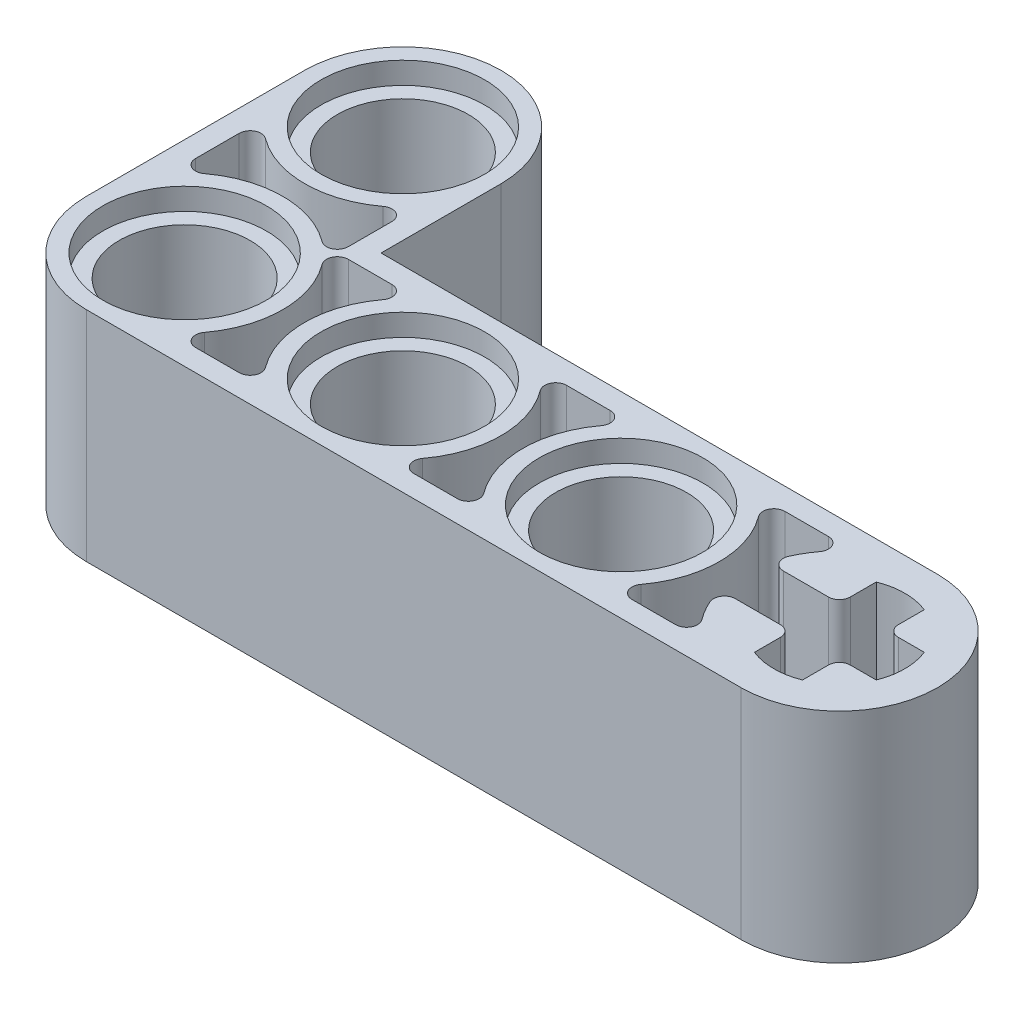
ISO-10303-21;
HEADER;
FILE_DESCRIPTION(('STEP AP214'),'2;1');
FILE_NAME('part.step','',(''),(''),'','','');
FILE_SCHEMA(('AUTOMOTIVE_DESIGN { 1 0 10303 214 1 1 1 1 }'));
ENDSEC;
DATA;
#1=APPLICATION_CONTEXT('core data for automotive mechanical design processes');
#2=APPLICATION_PROTOCOL_DEFINITION('international standard','automotive_design',2000,#1);
#3=PRODUCT_CONTEXT('',#1,'mechanical');
#4=PRODUCT('Part','Part','',(#3));
#5=PRODUCT_RELATED_PRODUCT_CATEGORY('part','',(#4));
#6=PRODUCT_DEFINITION_FORMATION('','',#4);
#7=PRODUCT_DEFINITION_CONTEXT('part definition',#1,'design');
#8=PRODUCT_DEFINITION('design','',#6,#7);
#9=PRODUCT_DEFINITION_SHAPE('','',#8);
#10=(LENGTH_UNIT() NAMED_UNIT(*) SI_UNIT(.MILLI.,.METRE.));
#11=(NAMED_UNIT(*) PLANE_ANGLE_UNIT() SI_UNIT($,.RADIAN.));
#12=(NAMED_UNIT(*) SI_UNIT($,.STERADIAN.) SOLID_ANGLE_UNIT());
#13=UNCERTAINTY_MEASURE_WITH_UNIT(LENGTH_MEASURE(1.E-05),#10,'distance_accuracy_value','');
#14=(GEOMETRIC_REPRESENTATION_CONTEXT(3) GLOBAL_UNCERTAINTY_ASSIGNED_CONTEXT((#13)) GLOBAL_UNIT_ASSIGNED_CONTEXT((#10,
#11,#12)) REPRESENTATION_CONTEXT('',''));
#15=CARTESIAN_POINT('',(0.,0.,0.));
#16=DIRECTION('',(0.,0.,1.));
#17=DIRECTION('',(1.,0.,0.));
#18=AXIS2_PLACEMENT_3D('',#15,#16,#17);
#19=CARTESIAN_POINT('',(12.,-4.,0.));
#20=DIRECTION('',(0.,-1.,0.));
#21=DIRECTION('',(0.,0.,-1.));
#22=AXIS2_PLACEMENT_3D('',#19,#20,#21);
#23=PLANE('',#22);
#24=CARTESIAN_POINT('',(9.06715155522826,-4.,1.28));
#25=DIRECTION('',(0.,-1.,0.));
#26=DIRECTION('',(0.,0.,1.));
#27=AXIS2_PLACEMENT_3D('',#24,#25,#26);
#28=CIRCLE('',#27,0.4);
#29=CARTESIAN_POINT('',(8.70054549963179,-4.,1.44));
#30=VERTEX_POINT('',#29);
#31=CARTESIAN_POINT('',(9.06715155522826,-4.,0.879999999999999));
#32=VERTEX_POINT('',#31);
#33=EDGE_CURVE('E573',#30,#32,#28,.T.);
#34=ORIENTED_EDGE('',*,*,#33,.T.);
#35=DIRECTION('',(1.,0.,0.));
#36=VECTOR('',#35,1.);
#37=CARTESIAN_POINT('',(10.72,-4.,0.880000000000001));
#38=LINE('',#37,#36);
#39=CARTESIAN_POINT('',(10.72,-4.,0.880000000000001));
#40=VERTEX_POINT('',#39);
#41=EDGE_CURVE('E561',#32,#40,#38,.T.);
#42=ORIENTED_EDGE('',*,*,#41,.T.);
#43=CARTESIAN_POINT('',(10.72,-4.,1.28));
#44=DIRECTION('',(0.,-1.,0.));
#45=DIRECTION('',(0.,0.,1.));
#46=AXIS2_PLACEMENT_3D('',#43,#44,#45);
#47=CIRCLE('',#46,0.4);
#48=CARTESIAN_POINT('',(11.12,-4.,1.28));
#49=VERTEX_POINT('',#48);
#50=EDGE_CURVE('E1395',#40,#49,#47,.T.);
#51=ORIENTED_EDGE('',*,*,#50,.T.);
#52=DIRECTION('',(0.,0.,1.));
#53=VECTOR('',#52,1.);
#54=CARTESIAN_POINT('',(11.12,-4.,1.28));
#55=LINE('',#54,#53);
#56=CARTESIAN_POINT('',(11.12,-4.,2.23284571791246));
#57=VERTEX_POINT('',#56);
#58=EDGE_CURVE('E1399',#49,#57,#55,.T.);
#59=ORIENTED_EDGE('',*,*,#58,.T.);
#60=CARTESIAN_POINT('',(12.,-4.,0.));
#61=DIRECTION('',(0.,1.,0.));
#62=DIRECTION('',(0.,0.,1.));
#63=AXIS2_PLACEMENT_3D('',#60,#61,#62);
#64=CIRCLE('',#63,2.4);
#65=CARTESIAN_POINT('',(12.88,-4.,2.23284571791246));
#66=VERTEX_POINT('',#65);
#67=EDGE_CURVE('E1351',#57,#66,#64,.T.);
#68=ORIENTED_EDGE('',*,*,#67,.T.);
#69=DIRECTION('',(0.,0.,-1.));
#70=VECTOR('',#69,1.);
#71=CARTESIAN_POINT('',(12.88,-4.,1.28));
#72=LINE('',#71,#70);
#73=CARTESIAN_POINT('',(12.88,-4.,1.28));
#74=VERTEX_POINT('',#73);
#75=EDGE_CURVE('E1355',#66,#74,#72,.T.);
#76=ORIENTED_EDGE('',*,*,#75,.T.);
#77=CARTESIAN_POINT('',(13.28,-4.,1.28));
#78=DIRECTION('',(0.,-1.,0.));
#79=DIRECTION('',(0.,0.,-1.));
#80=AXIS2_PLACEMENT_3D('',#77,#78,#79);
#81=CIRCLE('',#80,0.4);
#82=CARTESIAN_POINT('',(13.28,-4.,0.88));
#83=VERTEX_POINT('',#82);
#84=EDGE_CURVE('E1359',#74,#83,#81,.T.);
#85=ORIENTED_EDGE('',*,*,#84,.T.);
#86=DIRECTION('',(1.,0.,0.));
#87=VECTOR('',#86,1.);
#88=CARTESIAN_POINT('',(14.2328457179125,-4.,0.88));
#89=LINE('',#88,#87);
#90=CARTESIAN_POINT('',(14.2328457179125,-4.,0.88));
#91=VERTEX_POINT('',#90);
#92=EDGE_CURVE('E1363',#83,#91,#89,.T.);
#93=ORIENTED_EDGE('',*,*,#92,.T.);
#94=CARTESIAN_POINT('',(12.,-4.,0.));
#95=DIRECTION('',(0.,1.,0.));
#96=DIRECTION('',(0.,0.,1.));
#97=AXIS2_PLACEMENT_3D('',#94,#95,#96);
#98=CIRCLE('',#97,2.4);
#99=CARTESIAN_POINT('',(14.2328457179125,-4.,-0.88));
#100=VERTEX_POINT('',#99);
#101=EDGE_CURVE('E1367',#91,#100,#98,.T.);
#102=ORIENTED_EDGE('',*,*,#101,.T.);
#103=DIRECTION('',(-1.,0.,0.));
#104=VECTOR('',#103,1.);
#105=CARTESIAN_POINT('',(13.28,-4.,-0.88));
#106=LINE('',#105,#104);
#107=CARTESIAN_POINT('',(13.28,-4.,-0.88));
#108=VERTEX_POINT('',#107);
#109=EDGE_CURVE('E1371',#100,#108,#106,.T.);
#110=ORIENTED_EDGE('',*,*,#109,.T.);
#111=CARTESIAN_POINT('',(13.28,-4.,-1.28));
#112=DIRECTION('',(0.,-1.,0.));
#113=DIRECTION('',(0.,0.,-1.));
#114=AXIS2_PLACEMENT_3D('',#111,#112,#113);
#115=CIRCLE('',#114,0.4);
#116=CARTESIAN_POINT('',(12.88,-4.,-1.28));
#117=VERTEX_POINT('',#116);
#118=EDGE_CURVE('E1375',#108,#117,#115,.T.);
#119=ORIENTED_EDGE('',*,*,#118,.T.);
#120=DIRECTION('',(0.,0.,-1.));
#121=VECTOR('',#120,1.);
#122=CARTESIAN_POINT('',(12.88,-4.,-2.23284571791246));
#123=LINE('',#122,#121);
#124=CARTESIAN_POINT('',(12.88,-4.,-2.23284571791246));
#125=VERTEX_POINT('',#124);
#126=EDGE_CURVE('E1379',#117,#125,#123,.T.);
#127=ORIENTED_EDGE('',*,*,#126,.T.);
#128=CARTESIAN_POINT('',(12.,-4.,0.));
#129=DIRECTION('',(0.,1.,0.));
#130=DIRECTION('',(0.,0.,1.));
#131=AXIS2_PLACEMENT_3D('',#128,#129,#130);
#132=CIRCLE('',#131,2.4);
#133=CARTESIAN_POINT('',(11.12,-4.,-2.23284571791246));
#134=VERTEX_POINT('',#133);
#135=EDGE_CURVE('E1383',#125,#134,#132,.T.);
#136=ORIENTED_EDGE('',*,*,#135,.T.);
#137=DIRECTION('',(0.,0.,1.));
#138=VECTOR('',#137,1.);
#139=CARTESIAN_POINT('',(11.12,-4.,-2.23284571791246));
#140=LINE('',#139,#138);
#141=CARTESIAN_POINT('',(11.12,-4.,-1.28));
#142=VERTEX_POINT('',#141);
#143=EDGE_CURVE('E1387',#134,#142,#140,.T.);
#144=ORIENTED_EDGE('',*,*,#143,.T.);
#145=CARTESIAN_POINT('',(10.72,-4.,-1.28));
#146=DIRECTION('',(0.,-1.,0.));
#147=DIRECTION('',(0.,0.,1.));
#148=AXIS2_PLACEMENT_3D('',#145,#146,#147);
#149=CIRCLE('',#148,0.4);
#150=CARTESIAN_POINT('',(10.72,-4.,-0.88));
#151=VERTEX_POINT('',#150);
#152=EDGE_CURVE('E558',#142,#151,#149,.T.);
#153=ORIENTED_EDGE('',*,*,#152,.T.);
#154=DIRECTION('',(-1.,0.,0.));
#155=VECTOR('',#154,1.);
#156=CARTESIAN_POINT('',(9.76715428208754,-4.,-0.88));
#157=LINE('',#156,#155);
#158=CARTESIAN_POINT('',(9.06715155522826,-4.,-0.88));
#159=VERTEX_POINT('',#158);
#160=EDGE_CURVE('E549',#151,#159,#157,.T.);
#161=ORIENTED_EDGE('',*,*,#160,.T.);
#162=CARTESIAN_POINT('',(9.06715155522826,-4.,-1.28));
#163=DIRECTION('',(0.,-1.,0.));
#164=DIRECTION('',(0.,0.,-1.));
#165=AXIS2_PLACEMENT_3D('',#162,#163,#164);
#166=CIRCLE('',#165,0.4);
#167=CARTESIAN_POINT('',(8.7005454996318,-4.,-1.44));
#168=VERTEX_POINT('',#167);
#169=EDGE_CURVE('E555',#159,#168,#166,.T.);
#170=ORIENTED_EDGE('',*,*,#169,.T.);
#171=CARTESIAN_POINT('',(12.,-4.,0.));
#172=DIRECTION('',(0.,-1.,0.));
#173=DIRECTION('',(0.,0.,1.));
#174=AXIS2_PLACEMENT_3D('',#171,#172,#173);
#175=CIRCLE('',#174,3.6);
#176=CARTESIAN_POINT('',(9.12,-4.,-2.16));
#177=VERTEX_POINT('',#176);
#178=EDGE_CURVE('E578',#168,#177,#175,.T.);
#179=ORIENTED_EDGE('',*,*,#178,.T.);
#180=CARTESIAN_POINT('',(8.8,-4.,-2.4));
#181=DIRECTION('',(0.,1.,0.));
#182=DIRECTION('',(0.,0.,-1.));
#183=AXIS2_PLACEMENT_3D('',#180,#181,#182);
#184=CIRCLE('',#183,0.4);
#185=CARTESIAN_POINT('',(8.8,-4.,-2.8));
#186=VERTEX_POINT('',#185);
#187=EDGE_CURVE('E583',#177,#186,#184,.T.);
#188=ORIENTED_EDGE('',*,*,#187,.T.);
#189=DIRECTION('',(-1.,0.,0.));
#190=VECTOR('',#189,1.);
#191=CARTESIAN_POINT('',(7.2,-4.,-2.8));
#192=LINE('',#191,#190);
#193=CARTESIAN_POINT('',(7.2,-4.,-2.8));
#194=VERTEX_POINT('',#193);
#195=EDGE_CURVE('E592',#186,#194,#192,.T.);
#196=ORIENTED_EDGE('',*,*,#195,.T.);
#197=CARTESIAN_POINT('',(7.2,-4.,-2.4));
#198=DIRECTION('',(0.,1.,0.));
#199=DIRECTION('',(0.,0.,1.));
#200=AXIS2_PLACEMENT_3D('',#197,#198,#199);
#201=CIRCLE('',#200,0.4);
#202=CARTESIAN_POINT('',(6.88,-4.,-2.16));
#203=VERTEX_POINT('',#202);
#204=EDGE_CURVE('E596',#194,#203,#201,.T.);
#205=ORIENTED_EDGE('',*,*,#204,.T.);
#206=CARTESIAN_POINT('',(4.,-4.,0.));
#207=DIRECTION('',(0.,-1.,0.));
#208=DIRECTION('',(0.,0.,1.));
#209=AXIS2_PLACEMENT_3D('',#206,#207,#208);
#210=CIRCLE('',#209,3.6);
#211=CARTESIAN_POINT('',(6.88,-4.,2.16));
#212=VERTEX_POINT('',#211);
#213=EDGE_CURVE('E600',#203,#212,#210,.T.);
#214=ORIENTED_EDGE('',*,*,#213,.T.);
#215=CARTESIAN_POINT('',(7.2,-4.,2.4));
#216=DIRECTION('',(0.,1.,0.));
#217=DIRECTION('',(0.,0.,-1.));
#218=AXIS2_PLACEMENT_3D('',#215,#216,#217);
#219=CIRCLE('',#218,0.4);
#220=CARTESIAN_POINT('',(7.2,-4.,2.8));
#221=VERTEX_POINT('',#220);
#222=EDGE_CURVE('E604',#212,#221,#219,.T.);
#223=ORIENTED_EDGE('',*,*,#222,.T.);
#224=DIRECTION('',(1.,0.,0.));
#225=VECTOR('',#224,1.);
#226=CARTESIAN_POINT('',(7.2,-4.,2.8));
#227=LINE('',#226,#225);
#228=CARTESIAN_POINT('',(8.8,-4.,2.8));
#229=VERTEX_POINT('',#228);
#230=EDGE_CURVE('E608',#221,#229,#227,.T.);
#231=ORIENTED_EDGE('',*,*,#230,.T.);
#232=CARTESIAN_POINT('',(8.8,-4.,2.4));
#233=DIRECTION('',(0.,1.,0.));
#234=DIRECTION('',(0.,0.,1.));
#235=AXIS2_PLACEMENT_3D('',#232,#233,#234);
#236=CIRCLE('',#235,0.4);
#237=CARTESIAN_POINT('',(9.12,-4.,2.16));
#238=VERTEX_POINT('',#237);
#239=EDGE_CURVE('E612',#229,#238,#236,.T.);
#240=ORIENTED_EDGE('',*,*,#239,.T.);
#241=CARTESIAN_POINT('',(12.,-4.,0.));
#242=DIRECTION('',(0.,-1.,0.));
#243=DIRECTION('',(0.,0.,1.));
#244=AXIS2_PLACEMENT_3D('',#241,#242,#243);
#245=CIRCLE('',#244,3.6);
#246=EDGE_CURVE('E616',#238,#30,#245,.T.);
#247=ORIENTED_EDGE('',*,*,#246,.T.);
#248=EDGE_LOOP('',(#34,#42,#51,#59,#68,#76,#85,#93,#102,#110,#119,#127,#136,#144,#153,#161,#170,
#179,#188,#196,#205,#214,#223,#231,#240,#247));
#249=FACE_BOUND('',#248,.T.);
#250=CARTESIAN_POINT('',(-12.,-4.,-8.));
#251=DIRECTION('',(0.,1.,0.));
#252=DIRECTION('',(0.,0.,1.));
#253=AXIS2_PLACEMENT_3D('',#250,#251,#252);
#254=CIRCLE('',#253,3.);
#255=CARTESIAN_POINT('',(-12.,-4.,-5.));
#256=VERTEX_POINT('',#255);
#257=EDGE_CURVE('E1204',#256,#256,#254,.T.);
#258=ORIENTED_EDGE('',*,*,#257,.T.);
#259=EDGE_LOOP('',(#258));
#260=FACE_BOUND('',#259,.T.);
#261=CARTESIAN_POINT('',(-12.,-4.,0.));
#262=DIRECTION('',(0.,1.,0.));
#263=DIRECTION('',(0.,0.,1.));
#264=AXIS2_PLACEMENT_3D('',#261,#262,#263);
#265=CIRCLE('',#264,3.);
#266=CARTESIAN_POINT('',(-12.,-4.,3.));
#267=VERTEX_POINT('',#266);
#268=EDGE_CURVE('E1212',#267,#267,#265,.T.);
#269=ORIENTED_EDGE('',*,*,#268,.T.);
#270=EDGE_LOOP('',(#269));
#271=FACE_BOUND('',#270,.T.);
#272=CARTESIAN_POINT('',(-4.,-4.,0.));
#273=DIRECTION('',(0.,1.,0.));
#274=DIRECTION('',(0.,0.,1.));
#275=AXIS2_PLACEMENT_3D('',#272,#273,#274);
#276=CIRCLE('',#275,3.);
#277=CARTESIAN_POINT('',(-4.,-4.,3.));
#278=VERTEX_POINT('',#277);
#279=EDGE_CURVE('E1220',#278,#278,#276,.T.);
#280=ORIENTED_EDGE('',*,*,#279,.T.);
#281=EDGE_LOOP('',(#280));
#282=FACE_BOUND('',#281,.T.);
#283=CARTESIAN_POINT('',(4.,-4.,0.));
#284=DIRECTION('',(0.,1.,0.));
#285=DIRECTION('',(0.,0.,1.));
#286=AXIS2_PLACEMENT_3D('',#283,#284,#285);
#287=CIRCLE('',#286,3.);
#288=CARTESIAN_POINT('',(4.,-4.,3.));
#289=VERTEX_POINT('',#288);
#290=EDGE_CURVE('E1003',#289,#289,#287,.T.);
#291=ORIENTED_EDGE('',*,*,#290,.T.);
#292=EDGE_LOOP('',(#291));
#293=FACE_BOUND('',#292,.T.);
#294=CARTESIAN_POINT('',(12.,-4.,0.));
#295=DIRECTION('',(0.,1.,0.));
#296=DIRECTION('',(0.,0.,-1.));
#297=AXIS2_PLACEMENT_3D('',#294,#295,#296);
#298=CIRCLE('',#297,3.6);
#299=CARTESIAN_POINT('',(12.,-4.,3.6));
#300=VERTEX_POINT('',#299);
#301=CARTESIAN_POINT('',(12.,-4.,-3.6));
#302=VERTEX_POINT('',#301);
#303=EDGE_CURVE('E1407',#300,#302,#298,.T.);
#304=ORIENTED_EDGE('',*,*,#303,.F.);
#305=DIRECTION('',(1.,0.,0.));
#306=VECTOR('',#305,1.);
#307=CARTESIAN_POINT('',(-12.,-4.,3.6));
#308=LINE('',#307,#306);
#309=CARTESIAN_POINT('',(-12.,-4.,3.6));
#310=VERTEX_POINT('',#309);
#311=EDGE_CURVE('E1469',#310,#300,#308,.T.);
#312=ORIENTED_EDGE('',*,*,#311,.F.);
#313=CARTESIAN_POINT('',(-12.,-4.,0.));
#314=DIRECTION('',(0.,1.,0.));
#315=DIRECTION('',(0.,0.,1.));
#316=AXIS2_PLACEMENT_3D('',#313,#314,#315);
#317=CIRCLE('',#316,3.6);
#318=CARTESIAN_POINT('',(-15.6,-4.,0.));
#319=VERTEX_POINT('',#318);
#320=EDGE_CURVE('E1465',#319,#310,#317,.T.);
#321=ORIENTED_EDGE('',*,*,#320,.F.);
#322=DIRECTION('',(0.,0.,1.));
#323=VECTOR('',#322,1.);
#324=CARTESIAN_POINT('',(-15.6,-4.,-8.));
#325=LINE('',#324,#323);
#326=CARTESIAN_POINT('',(-15.6,-4.,-8.));
#327=VERTEX_POINT('',#326);
#328=EDGE_CURVE('E1461',#327,#319,#325,.T.);
#329=ORIENTED_EDGE('',*,*,#328,.F.);
#330=CARTESIAN_POINT('',(-12.,-4.,-8.));
#331=DIRECTION('',(0.,1.,0.));
#332=DIRECTION('',(0.,0.,-1.));
#333=AXIS2_PLACEMENT_3D('',#330,#331,#332);
#334=CIRCLE('',#333,3.6);
#335=CARTESIAN_POINT('',(-8.4,-4.,-8.));
#336=VERTEX_POINT('',#335);
#337=EDGE_CURVE('E1457',#336,#327,#334,.T.);
#338=ORIENTED_EDGE('',*,*,#337,.F.);
#339=DIRECTION('',(0.,0.,-1.));
#340=VECTOR('',#339,1.);
#341=CARTESIAN_POINT('',(-8.4,-4.,-8.));
#342=LINE('',#341,#340);
#343=CARTESIAN_POINT('',(-8.4,-4.,-3.6));
#344=VERTEX_POINT('',#343);
#345=EDGE_CURVE('E1453',#344,#336,#342,.T.);
#346=ORIENTED_EDGE('',*,*,#345,.F.);
#347=DIRECTION('',(-1.,0.,0.));
#348=VECTOR('',#347,1.);
#349=CARTESIAN_POINT('',(12.,-4.,-3.6));
#350=LINE('',#349,#348);
#351=EDGE_CURVE('E1449',#302,#344,#350,.T.);
#352=ORIENTED_EDGE('',*,*,#351,.F.);
#353=EDGE_LOOP('',(#304,#312,#321,#329,#338,#346,#352));
#354=FACE_BOUND('',#353,.T.);
#355=DIRECTION('',(1.,0.,0.));
#356=VECTOR('',#355,1.);
#357=CARTESIAN_POINT('',(-7.2,-4.,2.80000000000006));
#358=LINE('',#357,#356);
#359=CARTESIAN_POINT('',(-8.8,-4.,2.80000000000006));
#360=VERTEX_POINT('',#359);
#361=CARTESIAN_POINT('',(-7.2,-4.,2.80000000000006));
#362=VERTEX_POINT('',#361);
#363=EDGE_CURVE('E884',#360,#362,#358,.T.);
#364=ORIENTED_EDGE('',*,*,#363,.T.);
#365=CARTESIAN_POINT('',(-7.2,-4.,2.40000000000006));
#366=DIRECTION('',(0.,1.,0.));
#367=DIRECTION('',(0.,0.,-1.));
#368=AXIS2_PLACEMENT_3D('',#365,#366,#367);
#369=CIRCLE('',#368,0.400000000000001);
#370=CARTESIAN_POINT('',(-6.88,-4.,2.16000000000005));
#371=VERTEX_POINT('',#370);
#372=EDGE_CURVE('E833',#362,#371,#369,.T.);
#373=ORIENTED_EDGE('',*,*,#372,.T.);
#374=CARTESIAN_POINT('',(-4.,-4.,0.));
#375=DIRECTION('',(0.,-1.,0.));
#376=DIRECTION('',(0.,0.,1.));
#377=AXIS2_PLACEMENT_3D('',#374,#375,#376);
#378=CIRCLE('',#377,3.6);
#379=CARTESIAN_POINT('',(-6.88,-4.,-2.15999999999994));
#380=VERTEX_POINT('',#379);
#381=EDGE_CURVE('E859',#371,#380,#378,.T.);
#382=ORIENTED_EDGE('',*,*,#381,.T.);
#383=CARTESIAN_POINT('',(-7.2,-4.,-2.39999999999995));
#384=DIRECTION('',(0.,1.,0.));
#385=DIRECTION('',(0.,0.,-1.));
#386=AXIS2_PLACEMENT_3D('',#383,#384,#385);
#387=CIRCLE('',#386,0.400000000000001);
#388=CARTESIAN_POINT('',(-7.2,-4.,-2.79999999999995));
#389=VERTEX_POINT('',#388);
#390=EDGE_CURVE('E904',#380,#389,#387,.T.);
#391=ORIENTED_EDGE('',*,*,#390,.T.);
#392=DIRECTION('',(-1.,0.,0.));
#393=VECTOR('',#392,1.);
#394=CARTESIAN_POINT('',(-8.8,-4.,-2.79999999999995));
#395=LINE('',#394,#393);
#396=CARTESIAN_POINT('',(-8.8,-4.,-2.79999999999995));
#397=VERTEX_POINT('',#396);
#398=EDGE_CURVE('E900',#389,#397,#395,.T.);
#399=ORIENTED_EDGE('',*,*,#398,.T.);
#400=CARTESIAN_POINT('',(-8.8,-4.,-2.39999999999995));
#401=DIRECTION('',(0.,1.,0.));
#402=DIRECTION('',(0.,0.,-1.));
#403=AXIS2_PLACEMENT_3D('',#400,#401,#402);
#404=CIRCLE('',#403,0.4);
#405=CARTESIAN_POINT('',(-9.12,-4.,-2.15999999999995));
#406=VERTEX_POINT('',#405);
#407=EDGE_CURVE('E896',#397,#406,#404,.T.);
#408=ORIENTED_EDGE('',*,*,#407,.T.);
#409=CARTESIAN_POINT('',(-12.,-4.,0.));
#410=DIRECTION('',(0.,-1.,0.));
#411=DIRECTION('',(0.,0.,1.));
#412=AXIS2_PLACEMENT_3D('',#409,#410,#411);
#413=CIRCLE('',#412,3.6);
#414=CARTESIAN_POINT('',(-9.12,-4.,2.16000000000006));
#415=VERTEX_POINT('',#414);
#416=EDGE_CURVE('E892',#406,#415,#413,.T.);
#417=ORIENTED_EDGE('',*,*,#416,.T.);
#418=CARTESIAN_POINT('',(-8.8,-4.,2.40000000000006));
#419=DIRECTION('',(0.,1.,0.));
#420=DIRECTION('',(0.,0.,-1.));
#421=AXIS2_PLACEMENT_3D('',#418,#419,#420);
#422=CIRCLE('',#421,0.4);
#423=EDGE_CURVE('E888',#415,#360,#422,.T.);
#424=ORIENTED_EDGE('',*,*,#423,.T.);
#425=EDGE_LOOP('',(#364,#373,#382,#391,#399,#408,#417,#424));
#426=FACE_BOUND('',#425,.T.);
#427=DIRECTION('',(0.,0.,-1.));
#428=VECTOR('',#427,1.);
#429=CARTESIAN_POINT('',(-9.20000000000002,-4.,-4.79999999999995));
#430=LINE('',#429,#428);
#431=CARTESIAN_POINT('',(-9.20000000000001,-4.,-3.19999999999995));
#432=VERTEX_POINT('',#431);
#433=CARTESIAN_POINT('',(-9.20000000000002,-4.,-4.79999999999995));
#434=VERTEX_POINT('',#433);
#435=EDGE_CURVE('E803',#432,#434,#430,.T.);
#436=ORIENTED_EDGE('',*,*,#435,.T.);
#437=CARTESIAN_POINT('',(-9.60000000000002,-4.,-4.79999999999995));
#438=DIRECTION('',(0.,1.,0.));
#439=DIRECTION('',(0.,0.,-1.));
#440=AXIS2_PLACEMENT_3D('',#437,#438,#439);
#441=CIRCLE('',#440,0.4);
#442=CARTESIAN_POINT('',(-9.84000000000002,-4.,-5.11999999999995));
#443=VERTEX_POINT('',#442);
#444=EDGE_CURVE('E65',#434,#443,#441,.T.);
#445=ORIENTED_EDGE('',*,*,#444,.T.);
#446=CARTESIAN_POINT('',(-12.,-4.,-7.99999999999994));
#447=DIRECTION('',(0.,-1.,0.));
#448=DIRECTION('',(0.,0.,1.));
#449=AXIS2_PLACEMENT_3D('',#446,#447,#448);
#450=CIRCLE('',#449,3.6);
#451=CARTESIAN_POINT('',(-14.16,-4.,-5.11999999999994));
#452=VERTEX_POINT('',#451);
#453=EDGE_CURVE('E779',#443,#452,#450,.T.);
#454=ORIENTED_EDGE('',*,*,#453,.T.);
#455=CARTESIAN_POINT('',(-14.4,-4.,-4.79999999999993));
#456=DIRECTION('',(0.,1.,0.));
#457=DIRECTION('',(0.,0.,-1.));
#458=AXIS2_PLACEMENT_3D('',#455,#456,#457);
#459=CIRCLE('',#458,0.400000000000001);
#460=CARTESIAN_POINT('',(-14.8,-4.,-4.79999999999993));
#461=VERTEX_POINT('',#460);
#462=EDGE_CURVE('E823',#452,#461,#459,.T.);
#463=ORIENTED_EDGE('',*,*,#462,.T.);
#464=DIRECTION('',(0.,0.,1.));
#465=VECTOR('',#464,1.);
#466=CARTESIAN_POINT('',(-14.8,-4.,-3.19999999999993));
#467=LINE('',#466,#465);
#468=CARTESIAN_POINT('',(-14.8,-4.,-3.19999999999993));
#469=VERTEX_POINT('',#468);
#470=EDGE_CURVE('E819',#461,#469,#467,.T.);
#471=ORIENTED_EDGE('',*,*,#470,.T.);
#472=CARTESIAN_POINT('',(-14.4,-4.,-3.19999999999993));
#473=DIRECTION('',(0.,1.,0.));
#474=DIRECTION('',(0.,0.,-1.));
#475=AXIS2_PLACEMENT_3D('',#472,#473,#474);
#476=CIRCLE('',#475,0.399999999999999);
#477=CARTESIAN_POINT('',(-14.16,-4.,-2.87999999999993));
#478=VERTEX_POINT('',#477);
#479=EDGE_CURVE('E815',#469,#478,#476,.T.);
#480=ORIENTED_EDGE('',*,*,#479,.T.);
#481=CARTESIAN_POINT('',(-12.,-4.,0.));
#482=DIRECTION('',(0.,-1.,0.));
#483=DIRECTION('',(0.,0.,1.));
#484=AXIS2_PLACEMENT_3D('',#481,#482,#483);
#485=CIRCLE('',#484,3.6);
#486=CARTESIAN_POINT('',(-9.84000000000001,-4.,-2.87999999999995));
#487=VERTEX_POINT('',#486);
#488=EDGE_CURVE('E811',#478,#487,#485,.T.);
#489=ORIENTED_EDGE('',*,*,#488,.T.);
#490=CARTESIAN_POINT('',(-9.60000000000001,-4.,-3.19999999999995));
#491=DIRECTION('',(0.,1.,0.));
#492=DIRECTION('',(0.,0.,-1.));
#493=AXIS2_PLACEMENT_3D('',#490,#491,#492);
#494=CIRCLE('',#493,0.4);
#495=EDGE_CURVE('E807',#487,#432,#494,.T.);
#496=ORIENTED_EDGE('',*,*,#495,.T.);
#497=EDGE_LOOP('',(#436,#445,#454,#463,#471,#480,#489,#496));
#498=FACE_BOUND('',#497,.T.);
#499=DIRECTION('',(1.,0.,0.));
#500=VECTOR('',#499,1.);
#501=CARTESIAN_POINT('',(0.800000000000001,-4.,2.8));
#502=LINE('',#501,#500);
#503=CARTESIAN_POINT('',(-0.800000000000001,-4.,2.8));
#504=VERTEX_POINT('',#503);
#505=CARTESIAN_POINT('',(0.8,-4.,2.8));
#506=VERTEX_POINT('',#505);
#507=EDGE_CURVE('E722',#504,#506,#502,.T.);
#508=ORIENTED_EDGE('',*,*,#507,.T.);
#509=CARTESIAN_POINT('',(0.800000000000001,-4.,2.4));
#510=DIRECTION('',(0.,1.,0.));
#511=DIRECTION('',(0.,0.,-1.));
#512=AXIS2_PLACEMENT_3D('',#509,#510,#511);
#513=CIRCLE('',#512,0.4);
#514=CARTESIAN_POINT('',(1.12,-4.,2.16));
#515=VERTEX_POINT('',#514);
#516=EDGE_CURVE('E57',#506,#515,#513,.T.);
#517=ORIENTED_EDGE('',*,*,#516,.T.);
#518=CARTESIAN_POINT('',(4.,-4.,0.));
#519=DIRECTION('',(0.,-1.,0.));
#520=DIRECTION('',(0.,0.,1.));
#521=AXIS2_PLACEMENT_3D('',#518,#519,#520);
#522=CIRCLE('',#521,3.6);
#523=CARTESIAN_POINT('',(1.12,-4.,-2.16));
#524=VERTEX_POINT('',#523);
#525=EDGE_CURVE('E698',#515,#524,#522,.T.);
#526=ORIENTED_EDGE('',*,*,#525,.T.);
#527=CARTESIAN_POINT('',(0.800000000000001,-4.,-2.4));
#528=DIRECTION('',(0.,1.,0.));
#529=DIRECTION('',(0.,0.,-1.));
#530=AXIS2_PLACEMENT_3D('',#527,#528,#529);
#531=CIRCLE('',#530,0.400000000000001);
#532=CARTESIAN_POINT('',(0.800000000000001,-4.,-2.8));
#533=VERTEX_POINT('',#532);
#534=EDGE_CURVE('E743',#524,#533,#531,.T.);
#535=ORIENTED_EDGE('',*,*,#534,.T.);
#536=DIRECTION('',(-1.,0.,0.));
#537=VECTOR('',#536,1.);
#538=CARTESIAN_POINT('',(-0.800000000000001,-4.,-2.8));
#539=LINE('',#538,#537);
#540=CARTESIAN_POINT('',(-0.800000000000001,-4.,-2.8));
#541=VERTEX_POINT('',#540);
#542=EDGE_CURVE('E739',#533,#541,#539,.T.);
#543=ORIENTED_EDGE('',*,*,#542,.T.);
#544=CARTESIAN_POINT('',(-0.800000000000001,-4.,-2.4));
#545=DIRECTION('',(0.,1.,0.));
#546=DIRECTION('',(0.,0.,-1.));
#547=AXIS2_PLACEMENT_3D('',#544,#545,#546);
#548=CIRCLE('',#547,0.4);
#549=CARTESIAN_POINT('',(-1.12,-4.,-2.16));
#550=VERTEX_POINT('',#549);
#551=EDGE_CURVE('E735',#541,#550,#548,.T.);
#552=ORIENTED_EDGE('',*,*,#551,.T.);
#553=CARTESIAN_POINT('',(-4.,-4.,0.));
#554=DIRECTION('',(0.,-1.,0.));
#555=DIRECTION('',(0.,0.,1.));
#556=AXIS2_PLACEMENT_3D('',#553,#554,#555);
#557=CIRCLE('',#556,3.6);
#558=CARTESIAN_POINT('',(-1.12,-4.,2.16));
#559=VERTEX_POINT('',#558);
#560=EDGE_CURVE('E731',#550,#559,#557,.T.);
#561=ORIENTED_EDGE('',*,*,#560,.T.);
#562=CARTESIAN_POINT('',(-0.800000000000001,-4.,2.4));
#563=DIRECTION('',(0.,1.,0.));
#564=DIRECTION('',(0.,0.,-1.));
#565=AXIS2_PLACEMENT_3D('',#562,#563,#564);
#566=CIRCLE('',#565,0.4);
#567=EDGE_CURVE('E727',#559,#504,#566,.T.);
#568=ORIENTED_EDGE('',*,*,#567,.T.);
#569=EDGE_LOOP('',(#508,#517,#526,#535,#543,#552,#561,#568));
#570=FACE_BOUND('',#569,.T.);
#571=ADVANCED_FACE('F39',(#249,#260,#271,#282,#293,#354,#426,#498,#570),#23,.T.);
#572=CARTESIAN_POINT('',(12.,4.,0.));
#573=DIRECTION('',(0.,-1.,0.));
#574=DIRECTION('',(0.,0.,-1.));
#575=AXIS2_PLACEMENT_3D('',#572,#573,#574);
#576=PLANE('',#575);
#577=CARTESIAN_POINT('',(-12.,4.,-8.));
#578=DIRECTION('',(0.,1.,0.));
#579=DIRECTION('',(0.,0.,1.));
#580=AXIS2_PLACEMENT_3D('',#577,#578,#579);
#581=CIRCLE('',#580,3.);
#582=CARTESIAN_POINT('',(-12.,4.,-5.));
#583=VERTEX_POINT('',#582);
#584=EDGE_CURVE('E1236',#583,#583,#581,.T.);
#585=ORIENTED_EDGE('',*,*,#584,.F.);
#586=EDGE_LOOP('',(#585));
#587=FACE_BOUND('',#586,.T.);
#588=CARTESIAN_POINT('',(-12.,4.,0.));
#589=DIRECTION('',(0.,1.,0.));
#590=DIRECTION('',(0.,0.,1.));
#591=AXIS2_PLACEMENT_3D('',#588,#589,#590);
#592=CIRCLE('',#591,3.);
#593=CARTESIAN_POINT('',(-12.,4.,3.));
#594=VERTEX_POINT('',#593);
#595=EDGE_CURVE('E1244',#594,#594,#592,.T.);
#596=ORIENTED_EDGE('',*,*,#595,.F.);
#597=EDGE_LOOP('',(#596));
#598=FACE_BOUND('',#597,.T.);
#599=CARTESIAN_POINT('',(-4.,4.,0.));
#600=DIRECTION('',(0.,1.,0.));
#601=DIRECTION('',(0.,0.,1.));
#602=AXIS2_PLACEMENT_3D('',#599,#600,#601);
#603=CIRCLE('',#602,3.);
#604=CARTESIAN_POINT('',(-4.,4.,3.));
#605=VERTEX_POINT('',#604);
#606=EDGE_CURVE('E1252',#605,#605,#603,.T.);
#607=ORIENTED_EDGE('',*,*,#606,.F.);
#608=EDGE_LOOP('',(#607));
#609=FACE_BOUND('',#608,.T.);
#610=CARTESIAN_POINT('',(4.,4.,0.));
#611=DIRECTION('',(0.,1.,0.));
#612=DIRECTION('',(0.,0.,1.));
#613=AXIS2_PLACEMENT_3D('',#610,#611,#612);
#614=CIRCLE('',#613,3.);
#615=CARTESIAN_POINT('',(4.,4.,3.));
#616=VERTEX_POINT('',#615);
#617=EDGE_CURVE('E1260',#616,#616,#614,.T.);
#618=ORIENTED_EDGE('',*,*,#617,.F.);
#619=EDGE_LOOP('',(#618));
#620=FACE_BOUND('',#619,.T.);
#621=CARTESIAN_POINT('',(12.,4.,0.));
#622=DIRECTION('',(0.,1.,0.));
#623=DIRECTION('',(0.,0.,-1.));
#624=AXIS2_PLACEMENT_3D('',#621,#622,#623);
#625=CIRCLE('',#624,3.6);
#626=CARTESIAN_POINT('',(12.,4.,3.6));
#627=VERTEX_POINT('',#626);
#628=CARTESIAN_POINT('',(12.,4.,-3.6));
#629=VERTEX_POINT('',#628);
#630=EDGE_CURVE('E1323',#627,#629,#625,.T.);
#631=ORIENTED_EDGE('',*,*,#630,.T.);
#632=DIRECTION('',(-1.,0.,0.));
#633=VECTOR('',#632,1.);
#634=CARTESIAN_POINT('',(12.,4.,-3.6));
#635=LINE('',#634,#633);
#636=CARTESIAN_POINT('',(-8.4,4.,-3.6));
#637=VERTEX_POINT('',#636);
#638=EDGE_CURVE('E1327',#629,#637,#635,.T.);
#639=ORIENTED_EDGE('',*,*,#638,.T.);
#640=DIRECTION('',(0.,0.,-1.));
#641=VECTOR('',#640,1.);
#642=CARTESIAN_POINT('',(-8.4,4.,-8.));
#643=LINE('',#642,#641);
#644=CARTESIAN_POINT('',(-8.4,4.,-8.));
#645=VERTEX_POINT('',#644);
#646=EDGE_CURVE('E1331',#637,#645,#643,.T.);
#647=ORIENTED_EDGE('',*,*,#646,.T.);
#648=CARTESIAN_POINT('',(-12.,4.,-8.));
#649=DIRECTION('',(0.,1.,0.));
#650=DIRECTION('',(0.,0.,-1.));
#651=AXIS2_PLACEMENT_3D('',#648,#649,#650);
#652=CIRCLE('',#651,3.6);
#653=CARTESIAN_POINT('',(-15.6,4.,-8.));
#654=VERTEX_POINT('',#653);
#655=EDGE_CURVE('E1335',#645,#654,#652,.T.);
#656=ORIENTED_EDGE('',*,*,#655,.T.);
#657=DIRECTION('',(0.,0.,1.));
#658=VECTOR('',#657,1.);
#659=CARTESIAN_POINT('',(-15.6,4.,-8.));
#660=LINE('',#659,#658);
#661=CARTESIAN_POINT('',(-15.6,4.,0.));
#662=VERTEX_POINT('',#661);
#663=EDGE_CURVE('E1339',#654,#662,#660,.T.);
#664=ORIENTED_EDGE('',*,*,#663,.T.);
#665=CARTESIAN_POINT('',(-12.,4.,0.));
#666=DIRECTION('',(0.,1.,0.));
#667=DIRECTION('',(0.,0.,1.));
#668=AXIS2_PLACEMENT_3D('',#665,#666,#667);
#669=CIRCLE('',#668,3.6);
#670=CARTESIAN_POINT('',(-12.,4.,3.6));
#671=VERTEX_POINT('',#670);
#672=EDGE_CURVE('E1343',#662,#671,#669,.T.);
#673=ORIENTED_EDGE('',*,*,#672,.T.);
#674=DIRECTION('',(1.,0.,0.));
#675=VECTOR('',#674,1.);
#676=CARTESIAN_POINT('',(-12.,4.,3.6));
#677=LINE('',#676,#675);
#678=EDGE_CURVE('E1347',#671,#627,#677,.T.);
#679=ORIENTED_EDGE('',*,*,#678,.T.);
#680=EDGE_LOOP('',(#631,#639,#647,#656,#664,#673,#679));
#681=FACE_BOUND('',#680,.T.);
#682=DIRECTION('',(1.,0.,0.));
#683=VECTOR('',#682,1.);
#684=CARTESIAN_POINT('',(10.72,4.,0.880000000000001));
#685=LINE('',#684,#683);
#686=CARTESIAN_POINT('',(9.06715155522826,4.,0.879999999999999));
#687=VERTEX_POINT('',#686);
#688=CARTESIAN_POINT('',(10.72,4.,0.880000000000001));
#689=VERTEX_POINT('',#688);
#690=EDGE_CURVE('E1311',#687,#689,#685,.T.);
#691=ORIENTED_EDGE('',*,*,#690,.F.);
#692=CARTESIAN_POINT('',(9.06715155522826,4.,1.28));
#693=DIRECTION('',(0.,-1.,0.));
#694=DIRECTION('',(0.,0.,1.));
#695=AXIS2_PLACEMENT_3D('',#692,#693,#694);
#696=CIRCLE('',#695,0.4);
#697=CARTESIAN_POINT('',(8.70054549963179,4.,1.44));
#698=VERTEX_POINT('',#697);
#699=EDGE_CURVE('E579',#698,#687,#696,.T.);
#700=ORIENTED_EDGE('',*,*,#699,.F.);
#701=CARTESIAN_POINT('',(12.,4.,0.));
#702=DIRECTION('',(0.,-1.,0.));
#703=DIRECTION('',(0.,0.,1.));
#704=AXIS2_PLACEMENT_3D('',#701,#702,#703);
#705=CIRCLE('',#704,3.6);
#706=CARTESIAN_POINT('',(9.12,4.,2.16));
#707=VERTEX_POINT('',#706);
#708=EDGE_CURVE('E586',#707,#698,#705,.T.);
#709=ORIENTED_EDGE('',*,*,#708,.F.);
#710=CARTESIAN_POINT('',(8.8,4.,2.4));
#711=DIRECTION('',(0.,1.,0.));
#712=DIRECTION('',(0.,0.,1.));
#713=AXIS2_PLACEMENT_3D('',#710,#711,#712);
#714=CIRCLE('',#713,0.4);
#715=CARTESIAN_POINT('',(8.8,4.,2.8));
#716=VERTEX_POINT('',#715);
#717=EDGE_CURVE('E653',#716,#707,#714,.T.);
#718=ORIENTED_EDGE('',*,*,#717,.F.);
#719=DIRECTION('',(1.,0.,0.));
#720=VECTOR('',#719,1.);
#721=CARTESIAN_POINT('',(7.2,4.,2.8));
#722=LINE('',#721,#720);
#723=CARTESIAN_POINT('',(7.2,4.,2.8));
#724=VERTEX_POINT('',#723);
#725=EDGE_CURVE('E649',#724,#716,#722,.T.);
#726=ORIENTED_EDGE('',*,*,#725,.F.);
#727=CARTESIAN_POINT('',(7.2,4.,2.4));
#728=DIRECTION('',(0.,1.,0.));
#729=DIRECTION('',(0.,0.,-1.));
#730=AXIS2_PLACEMENT_3D('',#727,#728,#729);
#731=CIRCLE('',#730,0.4);
#732=CARTESIAN_POINT('',(6.88,4.,2.16));
#733=VERTEX_POINT('',#732);
#734=EDGE_CURVE('E645',#733,#724,#731,.T.);
#735=ORIENTED_EDGE('',*,*,#734,.F.);
#736=CARTESIAN_POINT('',(4.,4.,0.));
#737=DIRECTION('',(0.,-1.,0.));
#738=DIRECTION('',(0.,0.,1.));
#739=AXIS2_PLACEMENT_3D('',#736,#737,#738);
#740=CIRCLE('',#739,3.6);
#741=CARTESIAN_POINT('',(6.88,4.,-2.16));
#742=VERTEX_POINT('',#741);
#743=EDGE_CURVE('E641',#742,#733,#740,.T.);
#744=ORIENTED_EDGE('',*,*,#743,.F.);
#745=CARTESIAN_POINT('',(7.2,4.,-2.4));
#746=DIRECTION('',(0.,1.,0.));
#747=DIRECTION('',(0.,0.,1.));
#748=AXIS2_PLACEMENT_3D('',#745,#746,#747);
#749=CIRCLE('',#748,0.4);
#750=CARTESIAN_POINT('',(7.2,4.,-2.8));
#751=VERTEX_POINT('',#750);
#752=EDGE_CURVE('E637',#751,#742,#749,.T.);
#753=ORIENTED_EDGE('',*,*,#752,.F.);
#754=DIRECTION('',(-1.,0.,0.));
#755=VECTOR('',#754,1.);
#756=CARTESIAN_POINT('',(7.2,4.,-2.8));
#757=LINE('',#756,#755);
#758=CARTESIAN_POINT('',(8.8,4.,-2.8));
#759=VERTEX_POINT('',#758);
#760=EDGE_CURVE('E633',#759,#751,#757,.T.);
#761=ORIENTED_EDGE('',*,*,#760,.F.);
#762=CARTESIAN_POINT('',(8.8,4.,-2.4));
#763=DIRECTION('',(0.,1.,0.));
#764=DIRECTION('',(0.,0.,-1.));
#765=AXIS2_PLACEMENT_3D('',#762,#763,#764);
#766=CIRCLE('',#765,0.4);
#767=CARTESIAN_POINT('',(9.12,4.,-2.16));
#768=VERTEX_POINT('',#767);
#769=EDGE_CURVE('E629',#768,#759,#766,.T.);
#770=ORIENTED_EDGE('',*,*,#769,.F.);
#771=CARTESIAN_POINT('',(12.,4.,0.));
#772=DIRECTION('',(0.,-1.,0.));
#773=DIRECTION('',(0.,0.,1.));
#774=AXIS2_PLACEMENT_3D('',#771,#772,#773);
#775=CIRCLE('',#774,3.6);
#776=CARTESIAN_POINT('',(8.7005454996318,4.,-1.44));
#777=VERTEX_POINT('',#776);
#778=EDGE_CURVE('E625',#777,#768,#775,.T.);
#779=ORIENTED_EDGE('',*,*,#778,.F.);
#780=CARTESIAN_POINT('',(9.06715155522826,4.,-1.28));
#781=DIRECTION('',(0.,-1.,0.));
#782=DIRECTION('',(0.,0.,-1.));
#783=AXIS2_PLACEMENT_3D('',#780,#781,#782);
#784=CIRCLE('',#783,0.4);
#785=CARTESIAN_POINT('',(9.06715155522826,4.,-0.88));
#786=VERTEX_POINT('',#785);
#787=EDGE_CURVE('E622',#786,#777,#784,.T.);
#788=ORIENTED_EDGE('',*,*,#787,.F.);
#789=DIRECTION('',(-1.,0.,0.));
#790=VECTOR('',#789,1.);
#791=CARTESIAN_POINT('',(9.76715428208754,4.,-0.88));
#792=LINE('',#791,#790);
#793=CARTESIAN_POINT('',(10.72,4.,-0.88));
#794=VERTEX_POINT('',#793);
#795=EDGE_CURVE('E567',#794,#786,#792,.T.);
#796=ORIENTED_EDGE('',*,*,#795,.F.);
#797=CARTESIAN_POINT('',(10.72,4.,-1.28));
#798=DIRECTION('',(0.,-1.,0.));
#799=DIRECTION('',(0.,0.,1.));
#800=AXIS2_PLACEMENT_3D('',#797,#798,#799);
#801=CIRCLE('',#800,0.4);
#802=CARTESIAN_POINT('',(11.12,4.,-1.28));
#803=VERTEX_POINT('',#802);
#804=EDGE_CURVE('E1305',#803,#794,#801,.T.);
#805=ORIENTED_EDGE('',*,*,#804,.F.);
#806=DIRECTION('',(0.,0.,1.));
#807=VECTOR('',#806,1.);
#808=CARTESIAN_POINT('',(11.12,4.,-2.23284571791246));
#809=LINE('',#808,#807);
#810=CARTESIAN_POINT('',(11.12,4.,-2.23284571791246));
#811=VERTEX_POINT('',#810);
#812=EDGE_CURVE('E1301',#811,#803,#809,.T.);
#813=ORIENTED_EDGE('',*,*,#812,.F.);
#814=CARTESIAN_POINT('',(12.,4.,0.));
#815=DIRECTION('',(0.,1.,0.));
#816=DIRECTION('',(0.,0.,1.));
#817=AXIS2_PLACEMENT_3D('',#814,#815,#816);
#818=CIRCLE('',#817,2.4);
#819=CARTESIAN_POINT('',(12.88,4.,-2.23284571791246));
#820=VERTEX_POINT('',#819);
#821=EDGE_CURVE('E1297',#820,#811,#818,.T.);
#822=ORIENTED_EDGE('',*,*,#821,.F.);
#823=DIRECTION('',(0.,0.,-1.));
#824=VECTOR('',#823,1.);
#825=CARTESIAN_POINT('',(12.88,4.,-2.23284571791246));
#826=LINE('',#825,#824);
#827=CARTESIAN_POINT('',(12.88,4.,-1.28));
#828=VERTEX_POINT('',#827);
#829=EDGE_CURVE('E1293',#828,#820,#826,.T.);
#830=ORIENTED_EDGE('',*,*,#829,.F.);
#831=CARTESIAN_POINT('',(13.28,4.,-1.28));
#832=DIRECTION('',(0.,-1.,0.));
#833=DIRECTION('',(0.,0.,-1.));
#834=AXIS2_PLACEMENT_3D('',#831,#832,#833);
#835=CIRCLE('',#834,0.4);
#836=CARTESIAN_POINT('',(13.28,4.,-0.88));
#837=VERTEX_POINT('',#836);
#838=EDGE_CURVE('E1289',#837,#828,#835,.T.);
#839=ORIENTED_EDGE('',*,*,#838,.F.);
#840=DIRECTION('',(-1.,0.,0.));
#841=VECTOR('',#840,1.);
#842=CARTESIAN_POINT('',(13.28,4.,-0.88));
#843=LINE('',#842,#841);
#844=CARTESIAN_POINT('',(14.2328457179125,4.,-0.88));
#845=VERTEX_POINT('',#844);
#846=EDGE_CURVE('E1285',#845,#837,#843,.T.);
#847=ORIENTED_EDGE('',*,*,#846,.F.);
#848=CARTESIAN_POINT('',(12.,4.,0.));
#849=DIRECTION('',(0.,1.,0.));
#850=DIRECTION('',(0.,0.,1.));
#851=AXIS2_PLACEMENT_3D('',#848,#849,#850);
#852=CIRCLE('',#851,2.4);
#853=CARTESIAN_POINT('',(14.2328457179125,4.,0.88));
#854=VERTEX_POINT('',#853);
#855=EDGE_CURVE('E1281',#854,#845,#852,.T.);
#856=ORIENTED_EDGE('',*,*,#855,.F.);
#857=DIRECTION('',(1.,0.,0.));
#858=VECTOR('',#857,1.);
#859=CARTESIAN_POINT('',(14.2328457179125,4.,0.88));
#860=LINE('',#859,#858);
#861=CARTESIAN_POINT('',(13.28,4.,0.88));
#862=VERTEX_POINT('',#861);
#863=EDGE_CURVE('E1277',#862,#854,#860,.T.);
#864=ORIENTED_EDGE('',*,*,#863,.F.);
#865=CARTESIAN_POINT('',(13.28,4.,1.28));
#866=DIRECTION('',(0.,-1.,0.));
#867=DIRECTION('',(0.,0.,-1.));
#868=AXIS2_PLACEMENT_3D('',#865,#866,#867);
#869=CIRCLE('',#868,0.4);
#870=CARTESIAN_POINT('',(12.88,4.,1.28));
#871=VERTEX_POINT('',#870);
#872=EDGE_CURVE('E1273',#871,#862,#869,.T.);
#873=ORIENTED_EDGE('',*,*,#872,.F.);
#874=DIRECTION('',(0.,0.,-1.));
#875=VECTOR('',#874,1.);
#876=CARTESIAN_POINT('',(12.88,4.,1.28));
#877=LINE('',#876,#875);
#878=CARTESIAN_POINT('',(12.88,4.,2.23284571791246));
#879=VERTEX_POINT('',#878);
#880=EDGE_CURVE('E1268',#879,#871,#877,.T.);
#881=ORIENTED_EDGE('',*,*,#880,.F.);
#882=CARTESIAN_POINT('',(12.,4.,0.));
#883=DIRECTION('',(0.,1.,0.));
#884=DIRECTION('',(0.,0.,1.));
#885=AXIS2_PLACEMENT_3D('',#882,#883,#884);
#886=CIRCLE('',#885,2.4);
#887=CARTESIAN_POINT('',(11.12,4.,2.23284571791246));
#888=VERTEX_POINT('',#887);
#889=EDGE_CURVE('E1264',#888,#879,#886,.T.);
#890=ORIENTED_EDGE('',*,*,#889,.F.);
#891=DIRECTION('',(0.,0.,1.));
#892=VECTOR('',#891,1.);
#893=CARTESIAN_POINT('',(11.12,4.,1.28));
#894=LINE('',#893,#892);
#895=CARTESIAN_POINT('',(11.12,4.,1.28));
#896=VERTEX_POINT('',#895);
#897=EDGE_CURVE('E1319',#896,#888,#894,.T.);
#898=ORIENTED_EDGE('',*,*,#897,.F.);
#899=CARTESIAN_POINT('',(10.72,4.,1.28));
#900=DIRECTION('',(0.,-1.,0.));
#901=DIRECTION('',(0.,0.,1.));
#902=AXIS2_PLACEMENT_3D('',#899,#900,#901);
#903=CIRCLE('',#902,0.4);
#904=EDGE_CURVE('E1315',#689,#896,#903,.T.);
#905=ORIENTED_EDGE('',*,*,#904,.F.);
#906=EDGE_LOOP('',(#691,#700,#709,#718,#726,#735,#744,#753,#761,#770,#779,#788,#796,#805,#813,
#822,#830,#839,#847,#856,#864,#873,#881,#890,#898,#905));
#907=FACE_BOUND('',#906,.T.);
#908=CARTESIAN_POINT('',(-4.,4.,0.));
#909=DIRECTION('',(0.,-1.,0.));
#910=DIRECTION('',(0.,0.,1.));
#911=AXIS2_PLACEMENT_3D('',#908,#909,#910);
#912=CIRCLE('',#911,3.6);
#913=CARTESIAN_POINT('',(-6.88,4.,2.16000000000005));
#914=VERTEX_POINT('',#913);
#915=CARTESIAN_POINT('',(-6.88,4.,-2.15999999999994));
#916=VERTEX_POINT('',#915);
#917=EDGE_CURVE('E1149',#914,#916,#912,.T.);
#918=ORIENTED_EDGE('',*,*,#917,.F.);
#919=CARTESIAN_POINT('',(-7.2,4.,2.40000000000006));
#920=DIRECTION('',(0.,1.,0.));
#921=DIRECTION('',(0.,0.,-1.));
#922=AXIS2_PLACEMENT_3D('',#919,#920,#921);
#923=CIRCLE('',#922,0.400000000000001);
#924=CARTESIAN_POINT('',(-7.2,4.,2.80000000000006));
#925=VERTEX_POINT('',#924);
#926=EDGE_CURVE('E1091',#925,#914,#923,.T.);
#927=ORIENTED_EDGE('',*,*,#926,.F.);
#928=DIRECTION('',(1.,0.,0.));
#929=VECTOR('',#928,1.);
#930=CARTESIAN_POINT('',(-7.2,4.,2.80000000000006));
#931=LINE('',#930,#929);
#932=CARTESIAN_POINT('',(-8.8,4.,2.80000000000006));
#933=VERTEX_POINT('',#932);
#934=EDGE_CURVE('E1118',#933,#925,#931,.T.);
#935=ORIENTED_EDGE('',*,*,#934,.F.);
#936=CARTESIAN_POINT('',(-8.8,4.,2.40000000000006));
#937=DIRECTION('',(0.,1.,0.));
#938=DIRECTION('',(0.,0.,-1.));
#939=AXIS2_PLACEMENT_3D('',#936,#937,#938);
#940=CIRCLE('',#939,0.4);
#941=CARTESIAN_POINT('',(-9.12,4.,2.16000000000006));
#942=VERTEX_POINT('',#941);
#943=EDGE_CURVE('E1169',#942,#933,#940,.T.);
#944=ORIENTED_EDGE('',*,*,#943,.F.);
#945=CARTESIAN_POINT('',(-12.,4.,0.));
#946=DIRECTION('',(0.,-1.,0.));
#947=DIRECTION('',(0.,0.,1.));
#948=AXIS2_PLACEMENT_3D('',#945,#946,#947);
#949=CIRCLE('',#948,3.6);
#950=CARTESIAN_POINT('',(-9.12,4.,-2.15999999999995));
#951=VERTEX_POINT('',#950);
#952=EDGE_CURVE('E1165',#951,#942,#949,.T.);
#953=ORIENTED_EDGE('',*,*,#952,.F.);
#954=CARTESIAN_POINT('',(-8.8,4.,-2.39999999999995));
#955=DIRECTION('',(0.,1.,0.));
#956=DIRECTION('',(0.,0.,-1.));
#957=AXIS2_PLACEMENT_3D('',#954,#955,#956);
#958=CIRCLE('',#957,0.4);
#959=CARTESIAN_POINT('',(-8.8,4.,-2.79999999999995));
#960=VERTEX_POINT('',#959);
#961=EDGE_CURVE('E1161',#960,#951,#958,.T.);
#962=ORIENTED_EDGE('',*,*,#961,.F.);
#963=DIRECTION('',(-1.,0.,0.));
#964=VECTOR('',#963,1.);
#965=CARTESIAN_POINT('',(-8.8,4.,-2.79999999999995));
#966=LINE('',#965,#964);
#967=CARTESIAN_POINT('',(-7.2,4.,-2.79999999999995));
#968=VERTEX_POINT('',#967);
#969=EDGE_CURVE('E1157',#968,#960,#966,.T.);
#970=ORIENTED_EDGE('',*,*,#969,.F.);
#971=CARTESIAN_POINT('',(-7.2,4.,-2.39999999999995));
#972=DIRECTION('',(0.,1.,0.));
#973=DIRECTION('',(0.,0.,-1.));
#974=AXIS2_PLACEMENT_3D('',#971,#972,#973);
#975=CIRCLE('',#974,0.400000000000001);
#976=EDGE_CURVE('E1153',#916,#968,#975,.T.);
#977=ORIENTED_EDGE('',*,*,#976,.F.);
#978=EDGE_LOOP('',(#918,#927,#935,#944,#953,#962,#970,#977));
#979=FACE_BOUND('',#978,.T.);
#980=CARTESIAN_POINT('',(-12.,4.,-7.99999999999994));
#981=DIRECTION('',(0.,-1.,0.));
#982=DIRECTION('',(0.,0.,1.));
#983=AXIS2_PLACEMENT_3D('',#980,#981,#982);
#984=CIRCLE('',#983,3.6);
#985=CARTESIAN_POINT('',(-9.84000000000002,4.,-5.11999999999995));
#986=VERTEX_POINT('',#985);
#987=CARTESIAN_POINT('',(-14.16,4.,-5.11999999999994));
#988=VERTEX_POINT('',#987);
#989=EDGE_CURVE('E1061',#986,#988,#984,.T.);
#990=ORIENTED_EDGE('',*,*,#989,.F.);
#991=CARTESIAN_POINT('',(-9.60000000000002,4.,-4.79999999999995));
#992=DIRECTION('',(0.,1.,0.));
#993=DIRECTION('',(0.,0.,-1.));
#994=AXIS2_PLACEMENT_3D('',#991,#992,#993);
#995=CIRCLE('',#994,0.4);
#996=CARTESIAN_POINT('',(-9.20000000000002,4.,-4.79999999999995));
#997=VERTEX_POINT('',#996);
#998=EDGE_CURVE('E753',#997,#986,#995,.T.);
#999=ORIENTED_EDGE('',*,*,#998,.F.);
#1000=DIRECTION('',(0.,0.,-1.));
#1001=VECTOR('',#1000,1.);
#1002=CARTESIAN_POINT('',(-9.20000000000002,4.,-4.79999999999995));
#1003=LINE('',#1002,#1001);
#1004=CARTESIAN_POINT('',(-9.20000000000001,4.,-3.19999999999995));
#1005=VERTEX_POINT('',#1004);
#1006=EDGE_CURVE('E1030',#1005,#997,#1003,.T.);
#1007=ORIENTED_EDGE('',*,*,#1006,.F.);
#1008=CARTESIAN_POINT('',(-9.60000000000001,4.,-3.19999999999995));
#1009=DIRECTION('',(0.,1.,0.));
#1010=DIRECTION('',(0.,0.,-1.));
#1011=AXIS2_PLACEMENT_3D('',#1008,#1009,#1010);
#1012=CIRCLE('',#1011,0.4);
#1013=CARTESIAN_POINT('',(-9.84000000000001,4.,-2.87999999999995));
#1014=VERTEX_POINT('',#1013);
#1015=EDGE_CURVE('E1081',#1014,#1005,#1012,.T.);
#1016=ORIENTED_EDGE('',*,*,#1015,.F.);
#1017=CARTESIAN_POINT('',(-12.,4.,0.));
#1018=DIRECTION('',(0.,-1.,0.));
#1019=DIRECTION('',(0.,0.,1.));
#1020=AXIS2_PLACEMENT_3D('',#1017,#1018,#1019);
#1021=CIRCLE('',#1020,3.6);
#1022=CARTESIAN_POINT('',(-14.16,4.,-2.87999999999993));
#1023=VERTEX_POINT('',#1022);
#1024=EDGE_CURVE('E1077',#1023,#1014,#1021,.T.);
#1025=ORIENTED_EDGE('',*,*,#1024,.F.);
#1026=CARTESIAN_POINT('',(-14.4,4.,-3.19999999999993));
#1027=DIRECTION('',(0.,1.,0.));
#1028=DIRECTION('',(0.,0.,-1.));
#1029=AXIS2_PLACEMENT_3D('',#1026,#1027,#1028);
#1030=CIRCLE('',#1029,0.399999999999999);
#1031=CARTESIAN_POINT('',(-14.8,4.,-3.19999999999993));
#1032=VERTEX_POINT('',#1031);
#1033=EDGE_CURVE('E1073',#1032,#1023,#1030,.T.);
#1034=ORIENTED_EDGE('',*,*,#1033,.F.);
#1035=DIRECTION('',(0.,0.,1.));
#1036=VECTOR('',#1035,1.);
#1037=CARTESIAN_POINT('',(-14.8,4.,-3.19999999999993));
#1038=LINE('',#1037,#1036);
#1039=CARTESIAN_POINT('',(-14.8,4.,-4.79999999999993));
#1040=VERTEX_POINT('',#1039);
#1041=EDGE_CURVE('E1069',#1040,#1032,#1038,.T.);
#1042=ORIENTED_EDGE('',*,*,#1041,.F.);
#1043=CARTESIAN_POINT('',(-14.4,4.,-4.79999999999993));
#1044=DIRECTION('',(0.,1.,0.));
#1045=DIRECTION('',(0.,0.,-1.));
#1046=AXIS2_PLACEMENT_3D('',#1043,#1044,#1045);
#1047=CIRCLE('',#1046,0.400000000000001);
#1048=EDGE_CURVE('E1065',#988,#1040,#1047,.T.);
#1049=ORIENTED_EDGE('',*,*,#1048,.F.);
#1050=EDGE_LOOP('',(#990,#999,#1007,#1016,#1025,#1034,#1042,#1049));
#1051=FACE_BOUND('',#1050,.T.);
#1052=CARTESIAN_POINT('',(4.,4.,0.));
#1053=DIRECTION('',(0.,-1.,0.));
#1054=DIRECTION('',(0.,0.,1.));
#1055=AXIS2_PLACEMENT_3D('',#1052,#1053,#1054);
#1056=CIRCLE('',#1055,3.6);
#1057=CARTESIAN_POINT('',(1.12,4.,2.16));
#1058=VERTEX_POINT('',#1057);
#1059=CARTESIAN_POINT('',(1.12,4.,-2.16));
#1060=VERTEX_POINT('',#1059);
#1061=EDGE_CURVE('E972',#1058,#1060,#1056,.T.);
#1062=ORIENTED_EDGE('',*,*,#1061,.F.);
#1063=CARTESIAN_POINT('',(0.800000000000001,4.,2.4));
#1064=DIRECTION('',(0.,1.,0.));
#1065=DIRECTION('',(0.,0.,-1.));
#1066=AXIS2_PLACEMENT_3D('',#1063,#1064,#1065);
#1067=CIRCLE('',#1066,0.4);
#1068=CARTESIAN_POINT('',(0.800000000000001,4.,2.8));
#1069=VERTEX_POINT('',#1068);
#1070=EDGE_CURVE('E969',#1069,#1058,#1067,.T.);
#1071=ORIENTED_EDGE('',*,*,#1070,.F.);
#1072=DIRECTION('',(1.,0.,0.));
#1073=VECTOR('',#1072,1.);
#1074=CARTESIAN_POINT('',(0.800000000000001,4.,2.8));
#1075=LINE('',#1074,#1073);
#1076=CARTESIAN_POINT('',(-0.800000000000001,4.,2.8));
#1077=VERTEX_POINT('',#1076);
#1078=EDGE_CURVE('E940',#1077,#1069,#1075,.T.);
#1079=ORIENTED_EDGE('',*,*,#1078,.F.);
#1080=CARTESIAN_POINT('',(-0.800000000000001,4.,2.4));
#1081=DIRECTION('',(0.,1.,0.));
#1082=DIRECTION('',(0.,0.,-1.));
#1083=AXIS2_PLACEMENT_3D('',#1080,#1081,#1082);
#1084=CIRCLE('',#1083,0.4);
#1085=CARTESIAN_POINT('',(-1.12,4.,2.16));
#1086=VERTEX_POINT('',#1085);
#1087=EDGE_CURVE('E993',#1086,#1077,#1084,.T.);
#1088=ORIENTED_EDGE('',*,*,#1087,.F.);
#1089=CARTESIAN_POINT('',(-4.,4.,0.));
#1090=DIRECTION('',(0.,-1.,0.));
#1091=DIRECTION('',(0.,0.,1.));
#1092=AXIS2_PLACEMENT_3D('',#1089,#1090,#1091);
#1093=CIRCLE('',#1092,3.6);
#1094=CARTESIAN_POINT('',(-1.12,4.,-2.16));
#1095=VERTEX_POINT('',#1094);
#1096=EDGE_CURVE('E989',#1095,#1086,#1093,.T.);
#1097=ORIENTED_EDGE('',*,*,#1096,.F.);
#1098=CARTESIAN_POINT('',(-0.800000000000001,4.,-2.4));
#1099=DIRECTION('',(0.,1.,0.));
#1100=DIRECTION('',(0.,0.,-1.));
#1101=AXIS2_PLACEMENT_3D('',#1098,#1099,#1100);
#1102=CIRCLE('',#1101,0.4);
#1103=CARTESIAN_POINT('',(-0.800000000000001,4.,-2.8));
#1104=VERTEX_POINT('',#1103);
#1105=EDGE_CURVE('E985',#1104,#1095,#1102,.T.);
#1106=ORIENTED_EDGE('',*,*,#1105,.F.);
#1107=DIRECTION('',(-1.,0.,0.));
#1108=VECTOR('',#1107,1.);
#1109=CARTESIAN_POINT('',(-0.800000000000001,4.,-2.8));
#1110=LINE('',#1109,#1108);
#1111=CARTESIAN_POINT('',(0.800000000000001,4.,-2.8));
#1112=VERTEX_POINT('',#1111);
#1113=EDGE_CURVE('E981',#1112,#1104,#1110,.T.);
#1114=ORIENTED_EDGE('',*,*,#1113,.F.);
#1115=CARTESIAN_POINT('',(0.800000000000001,4.,-2.4));
#1116=DIRECTION('',(0.,1.,0.));
#1117=DIRECTION('',(0.,0.,-1.));
#1118=AXIS2_PLACEMENT_3D('',#1115,#1116,#1117);
#1119=CIRCLE('',#1118,0.400000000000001);
#1120=EDGE_CURVE('E977',#1060,#1112,#1119,.T.);
#1121=ORIENTED_EDGE('',*,*,#1120,.F.);
#1122=EDGE_LOOP('',(#1062,#1071,#1079,#1088,#1097,#1106,#1114,#1121));
#1123=FACE_BOUND('',#1122,.T.);
#1124=ADVANCED_FACE('F1524',(#587,#598,#609,#620,#681,#907,#979,#1051,#1123),#576,.F.);
#1125=CARTESIAN_POINT('',(-4.,-4.,0.));
#1126=DIRECTION('',(0.,1.,0.));
#1127=DIRECTION('',(0.,0.,1.));
#1128=AXIS2_PLACEMENT_3D('',#1125,#1126,#1127);
#1129=CYLINDRICAL_SURFACE('',#1128,2.4);
#1130=CARTESIAN_POINT('',(-4.,3.2,0.));
#1131=DIRECTION('',(0.,1.,0.));
#1132=DIRECTION('',(0.,0.,1.));
#1133=AXIS2_PLACEMENT_3D('',#1130,#1131,#1132);
#1134=CIRCLE('',#1133,2.4);
#1135=CARTESIAN_POINT('',(-4.,3.2,2.4));
#1136=VERTEX_POINT('',#1135);
#1137=EDGE_CURVE('E1269',#1136,#1136,#1134,.F.);
#1138=ORIENTED_EDGE('',*,*,#1137,.F.);
#1139=EDGE_LOOP('',(#1138));
#1140=FACE_BOUND('',#1139,.T.);
#1141=CARTESIAN_POINT('',(-4.,-3.2,0.));
#1142=DIRECTION('',(0.,-1.,0.));
#1143=DIRECTION('',(0.,0.,-1.));
#1144=AXIS2_PLACEMENT_3D('',#1141,#1142,#1143);
#1145=CIRCLE('',#1144,2.4);
#1146=CARTESIAN_POINT('',(-4.,-3.2,-2.4));
#1147=VERTEX_POINT('',#1146);
#1148=EDGE_CURVE('E43',#1147,#1147,#1145,.F.);
#1149=ORIENTED_EDGE('',*,*,#1148,.F.);
#1150=EDGE_LOOP('',(#1149));
#1151=FACE_BOUND('',#1150,.T.);
#1152=ADVANCED_FACE('F1521',(#1140,#1151),#1129,.F.);
#1153=CARTESIAN_POINT('',(4.,-4.,0.));
#1154=DIRECTION('',(0.,1.,0.));
#1155=DIRECTION('',(0.,0.,1.));
#1156=AXIS2_PLACEMENT_3D('',#1153,#1154,#1155);
#1157=CYLINDRICAL_SURFACE('',#1156,2.4);
#1158=CARTESIAN_POINT('',(4.,3.2,0.));
#1159=DIRECTION('',(0.,1.,0.));
#1160=DIRECTION('',(0.,0.,1.));
#1161=AXIS2_PLACEMENT_3D('',#1158,#1159,#1160);
#1162=CIRCLE('',#1161,2.4);
#1163=CARTESIAN_POINT('',(4.,3.2,2.4));
#1164=VERTEX_POINT('',#1163);
#1165=EDGE_CURVE('E1497',#1164,#1164,#1162,.F.);
#1166=ORIENTED_EDGE('',*,*,#1165,.F.);
#1167=EDGE_LOOP('',(#1166));
#1168=FACE_BOUND('',#1167,.T.);
#1169=CARTESIAN_POINT('',(4.,-3.2,0.));
#1170=DIRECTION('',(0.,-1.,0.));
#1171=DIRECTION('',(0.,0.,-1.));
#1172=AXIS2_PLACEMENT_3D('',#1169,#1170,#1171);
#1173=CIRCLE('',#1172,2.4);
#1174=CARTESIAN_POINT('',(4.,-3.2,-2.4));
#1175=VERTEX_POINT('',#1174);
#1176=EDGE_CURVE('E1510',#1175,#1175,#1173,.F.);
#1177=ORIENTED_EDGE('',*,*,#1176,.F.);
#1178=EDGE_LOOP('',(#1177));
#1179=FACE_BOUND('',#1178,.T.);
#1180=ADVANCED_FACE('F1523',(#1168,#1179),#1157,.F.);
#1181=CARTESIAN_POINT('',(-12.,-4.,0.));
#1182=DIRECTION('',(0.,1.,0.));
#1183=DIRECTION('',(0.,0.,1.));
#1184=AXIS2_PLACEMENT_3D('',#1181,#1182,#1183);
#1185=CYLINDRICAL_SURFACE('',#1184,2.4);
#1186=CARTESIAN_POINT('',(-12.,3.2,0.));
#1187=DIRECTION('',(0.,1.,0.));
#1188=DIRECTION('',(0.,0.,1.));
#1189=AXIS2_PLACEMENT_3D('',#1186,#1187,#1188);
#1190=CIRCLE('',#1189,2.4);
#1191=CARTESIAN_POINT('',(-12.,3.2,2.4));
#1192=VERTEX_POINT('',#1191);
#1193=EDGE_CURVE('E1493',#1192,#1192,#1190,.F.);
#1194=ORIENTED_EDGE('',*,*,#1193,.F.);
#1195=EDGE_LOOP('',(#1194));
#1196=FACE_BOUND('',#1195,.T.);
#1197=CARTESIAN_POINT('',(-12.,-3.2,0.));
#1198=DIRECTION('',(0.,-1.,0.));
#1199=DIRECTION('',(0.,0.,-1.));
#1200=AXIS2_PLACEMENT_3D('',#1197,#1198,#1199);
#1201=CIRCLE('',#1200,2.4);
#1202=CARTESIAN_POINT('',(-12.,-3.2,-2.4));
#1203=VERTEX_POINT('',#1202);
#1204=EDGE_CURVE('E1507',#1203,#1203,#1201,.F.);
#1205=ORIENTED_EDGE('',*,*,#1204,.F.);
#1206=EDGE_LOOP('',(#1205));
#1207=FACE_BOUND('',#1206,.T.);
#1208=ADVANCED_FACE('F1531',(#1196,#1207),#1185,.F.);
#1209=CARTESIAN_POINT('',(-12.,-4.,-8.));
#1210=DIRECTION('',(0.,1.,0.));
#1211=DIRECTION('',(0.,0.,1.));
#1212=AXIS2_PLACEMENT_3D('',#1209,#1210,#1211);
#1213=CYLINDRICAL_SURFACE('',#1212,2.4);
#1214=CARTESIAN_POINT('',(-12.,3.2,-8.));
#1215=DIRECTION('',(0.,1.,0.));
#1216=DIRECTION('',(0.,0.,1.));
#1217=AXIS2_PLACEMENT_3D('',#1214,#1215,#1216);
#1218=CIRCLE('',#1217,2.4);
#1219=CARTESIAN_POINT('',(-12.,3.2,-5.6));
#1220=VERTEX_POINT('',#1219);
#1221=EDGE_CURVE('E1235',#1220,#1220,#1218,.F.);
#1222=ORIENTED_EDGE('',*,*,#1221,.F.);
#1223=EDGE_LOOP('',(#1222));
#1224=FACE_BOUND('',#1223,.T.);
#1225=CARTESIAN_POINT('',(-12.,-3.2,-8.));
#1226=DIRECTION('',(0.,-1.,0.));
#1227=DIRECTION('',(0.,0.,-1.));
#1228=AXIS2_PLACEMENT_3D('',#1225,#1226,#1227);
#1229=CIRCLE('',#1228,2.4);
#1230=CARTESIAN_POINT('',(-12.,-3.2,-10.4));
#1231=VERTEX_POINT('',#1230);
#1232=EDGE_CURVE('E1203',#1231,#1231,#1229,.F.);
#1233=ORIENTED_EDGE('',*,*,#1232,.F.);
#1234=EDGE_LOOP('',(#1233));
#1235=FACE_BOUND('',#1234,.T.);
#1236=ADVANCED_FACE('F1591',(#1224,#1235),#1213,.F.);
#1237=CARTESIAN_POINT('',(12.,-4.,0.));
#1238=DIRECTION('',(0.,1.,0.));
#1239=DIRECTION('',(0.,0.,1.));
#1240=AXIS2_PLACEMENT_3D('',#1237,#1238,#1239);
#1241=CYLINDRICAL_SURFACE('',#1240,3.6);
#1242=DIRECTION('',(0.,1.,0.));
#1243=VECTOR('',#1242,1.);
#1244=CARTESIAN_POINT('',(12.,-4.,-3.6));
#1245=LINE('',#1244,#1243);
#1246=EDGE_CURVE('E1472',#302,#629,#1245,.T.);
#1247=ORIENTED_EDGE('',*,*,#1246,.T.);
#1248=ORIENTED_EDGE('',*,*,#630,.F.);
#1249=DIRECTION('',(0.,1.,0.));
#1250=VECTOR('',#1249,1.);
#1251=CARTESIAN_POINT('',(12.,-4.,3.6));
#1252=LINE('',#1251,#1250);
#1253=EDGE_CURVE('E11',#300,#627,#1252,.T.);
#1254=ORIENTED_EDGE('',*,*,#1253,.F.);
#1255=ORIENTED_EDGE('',*,*,#303,.T.);
#1256=EDGE_LOOP('',(#1247,#1248,#1254,#1255));
#1257=FACE_BOUND('',#1256,.T.);
#1258=ADVANCED_FACE('F41',(#1257),#1241,.T.);
#1259=CARTESIAN_POINT('',(-12.,-4.,3.6));
#1260=DIRECTION('',(0.,0.,1.));
#1261=DIRECTION('',(1.,0.,0.));
#1262=AXIS2_PLACEMENT_3D('',#1259,#1260,#1261);
#1263=PLANE('',#1262);
#1264=ORIENTED_EDGE('',*,*,#1253,.T.);
#1265=ORIENTED_EDGE('',*,*,#678,.F.);
#1266=DIRECTION('',(0.,1.,0.));
#1267=VECTOR('',#1266,1.);
#1268=CARTESIAN_POINT('',(-12.,-4.,3.6));
#1269=LINE('',#1268,#1267);
#1270=EDGE_CURVE('E49',#310,#671,#1269,.T.);
#1271=ORIENTED_EDGE('',*,*,#1270,.F.);
#1272=ORIENTED_EDGE('',*,*,#311,.T.);
#1273=EDGE_LOOP('',(#1264,#1265,#1271,#1272));
#1274=FACE_BOUND('',#1273,.T.);
#1275=ADVANCED_FACE('F1542',(#1274),#1263,.T.);
#1276=CARTESIAN_POINT('',(-12.,-4.,0.));
#1277=DIRECTION('',(0.,1.,0.));
#1278=DIRECTION('',(0.,0.,1.));
#1279=AXIS2_PLACEMENT_3D('',#1276,#1277,#1278);
#1280=CYLINDRICAL_SURFACE('',#1279,3.6);
#1281=ORIENTED_EDGE('',*,*,#1270,.T.);
#1282=ORIENTED_EDGE('',*,*,#672,.F.);
#1283=DIRECTION('',(0.,1.,0.));
#1284=VECTOR('',#1283,1.);
#1285=CARTESIAN_POINT('',(-15.6,-4.,0.));
#1286=LINE('',#1285,#1284);
#1287=EDGE_CURVE('E1476',#319,#662,#1286,.T.);
#1288=ORIENTED_EDGE('',*,*,#1287,.F.);
#1289=ORIENTED_EDGE('',*,*,#320,.T.);
#1290=EDGE_LOOP('',(#1281,#1282,#1288,#1289));
#1291=FACE_BOUND('',#1290,.T.);
#1292=ADVANCED_FACE('F1545',(#1291),#1280,.T.);
#1293=CARTESIAN_POINT('',(-15.6,-4.,-8.));
#1294=DIRECTION('',(-1.,0.,0.));
#1295=DIRECTION('',(0.,0.,1.));
#1296=AXIS2_PLACEMENT_3D('',#1293,#1294,#1295);
#1297=PLANE('',#1296);
#1298=ORIENTED_EDGE('',*,*,#1287,.T.);
#1299=ORIENTED_EDGE('',*,*,#663,.F.);
#1300=DIRECTION('',(0.,1.,0.));
#1301=VECTOR('',#1300,1.);
#1302=CARTESIAN_POINT('',(-15.6,-4.,-8.));
#1303=LINE('',#1302,#1301);
#1304=EDGE_CURVE('E1479',#327,#654,#1303,.T.);
#1305=ORIENTED_EDGE('',*,*,#1304,.F.);
#1306=ORIENTED_EDGE('',*,*,#328,.T.);
#1307=EDGE_LOOP('',(#1298,#1299,#1305,#1306));
#1308=FACE_BOUND('',#1307,.T.);
#1309=ADVANCED_FACE('F1549',(#1308),#1297,.T.);
#1310=CARTESIAN_POINT('',(-12.,-4.,-8.));
#1311=DIRECTION('',(0.,1.,0.));
#1312=DIRECTION('',(0.,0.,1.));
#1313=AXIS2_PLACEMENT_3D('',#1310,#1311,#1312);
#1314=CYLINDRICAL_SURFACE('',#1313,3.6);
#1315=ORIENTED_EDGE('',*,*,#1304,.T.);
#1316=ORIENTED_EDGE('',*,*,#655,.F.);
#1317=DIRECTION('',(0.,1.,0.));
#1318=VECTOR('',#1317,1.);
#1319=CARTESIAN_POINT('',(-8.4,-4.,-8.));
#1320=LINE('',#1319,#1318);
#1321=EDGE_CURVE('E1482',#336,#645,#1320,.T.);
#1322=ORIENTED_EDGE('',*,*,#1321,.F.);
#1323=ORIENTED_EDGE('',*,*,#337,.T.);
#1324=EDGE_LOOP('',(#1315,#1316,#1322,#1323));
#1325=FACE_BOUND('',#1324,.T.);
#1326=ADVANCED_FACE('F1553',(#1325),#1314,.T.);
#1327=CARTESIAN_POINT('',(-8.4,-4.,-8.));
#1328=DIRECTION('',(1.,0.,0.));
#1329=DIRECTION('',(0.,0.,-1.));
#1330=AXIS2_PLACEMENT_3D('',#1327,#1328,#1329);
#1331=PLANE('',#1330);
#1332=ORIENTED_EDGE('',*,*,#1321,.T.);
#1333=ORIENTED_EDGE('',*,*,#646,.F.);
#1334=DIRECTION('',(0.,1.,0.));
#1335=VECTOR('',#1334,1.);
#1336=CARTESIAN_POINT('',(-8.4,-4.,-3.6));
#1337=LINE('',#1336,#1335);
#1338=EDGE_CURVE('E1485',#344,#637,#1337,.T.);
#1339=ORIENTED_EDGE('',*,*,#1338,.F.);
#1340=ORIENTED_EDGE('',*,*,#345,.T.);
#1341=EDGE_LOOP('',(#1332,#1333,#1339,#1340));
#1342=FACE_BOUND('',#1341,.T.);
#1343=ADVANCED_FACE('F1557',(#1342),#1331,.T.);
#1344=CARTESIAN_POINT('',(12.,-4.,-3.6));
#1345=DIRECTION('',(0.,0.,-1.));
#1346=DIRECTION('',(-1.,0.,0.));
#1347=AXIS2_PLACEMENT_3D('',#1344,#1345,#1346);
#1348=PLANE('',#1347);
#1349=ORIENTED_EDGE('',*,*,#1338,.T.);
#1350=ORIENTED_EDGE('',*,*,#638,.F.);
#1351=ORIENTED_EDGE('',*,*,#1246,.F.);
#1352=ORIENTED_EDGE('',*,*,#351,.T.);
#1353=EDGE_LOOP('',(#1349,#1350,#1351,#1352));
#1354=FACE_BOUND('',#1353,.T.);
#1355=ADVANCED_FACE('F1560',(#1354),#1348,.T.);
#1356=CARTESIAN_POINT('',(12.,-4.,0.));
#1357=DIRECTION('',(0.,1.,0.));
#1358=DIRECTION('',(0.,0.,1.));
#1359=AXIS2_PLACEMENT_3D('',#1356,#1357,#1358);
#1360=CYLINDRICAL_SURFACE('',#1359,2.4);
#1361=DIRECTION('',(0.,1.,0.));
#1362=VECTOR('',#1361,1.);
#1363=CARTESIAN_POINT('',(11.12,-4.,2.23284571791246));
#1364=LINE('',#1363,#1362);
#1365=EDGE_CURVE('E1404',#57,#888,#1364,.T.);
#1366=ORIENTED_EDGE('',*,*,#1365,.T.);
#1367=ORIENTED_EDGE('',*,*,#889,.T.);
#1368=DIRECTION('',(0.,1.,0.));
#1369=VECTOR('',#1368,1.);
#1370=CARTESIAN_POINT('',(12.88,-4.,2.23284571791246));
#1371=LINE('',#1370,#1369);
#1372=EDGE_CURVE('E1403',#66,#879,#1371,.T.);
#1373=ORIENTED_EDGE('',*,*,#1372,.F.);
#1374=ORIENTED_EDGE('',*,*,#67,.F.);
#1375=EDGE_LOOP('',(#1366,#1367,#1373,#1374));
#1376=FACE_BOUND('',#1375,.T.);
#1377=ADVANCED_FACE('F1563',(#1376),#1360,.F.);
#1378=CARTESIAN_POINT('',(11.12,-4.,1.28));
#1379=DIRECTION('',(-1.,0.,0.));
#1380=DIRECTION('',(0.,0.,1.));
#1381=AXIS2_PLACEMENT_3D('',#1378,#1379,#1380);
#1382=PLANE('',#1381);
#1383=DIRECTION('',(0.,1.,0.));
#1384=VECTOR('',#1383,1.);
#1385=CARTESIAN_POINT('',(11.12,-4.,1.28));
#1386=LINE('',#1385,#1384);
#1387=EDGE_CURVE('E1408',#49,#896,#1386,.T.);
#1388=ORIENTED_EDGE('',*,*,#1387,.T.);
#1389=ORIENTED_EDGE('',*,*,#897,.T.);
#1390=ORIENTED_EDGE('',*,*,#1365,.F.);
#1391=ORIENTED_EDGE('',*,*,#58,.F.);
#1392=EDGE_LOOP('',(#1388,#1389,#1390,#1391));
#1393=FACE_BOUND('',#1392,.T.);
#1394=ADVANCED_FACE('F1568',(#1393),#1382,.F.);
#1395=CARTESIAN_POINT('',(10.72,-4.,1.28));
#1396=DIRECTION('',(0.,1.,0.));
#1397=DIRECTION('',(0.,0.,1.));
#1398=AXIS2_PLACEMENT_3D('',#1395,#1396,#1397);
#1399=CYLINDRICAL_SURFACE('',#1398,0.4);
#1400=DIRECTION('',(0.,1.,0.));
#1401=VECTOR('',#1400,1.);
#1402=CARTESIAN_POINT('',(10.72,-4.,0.880000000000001));
#1403=LINE('',#1402,#1401);
#1404=EDGE_CURVE('E1411',#40,#689,#1403,.T.);
#1405=ORIENTED_EDGE('',*,*,#1404,.T.);
#1406=ORIENTED_EDGE('',*,*,#904,.T.);
#1407=ORIENTED_EDGE('',*,*,#1387,.F.);
#1408=ORIENTED_EDGE('',*,*,#50,.F.);
#1409=EDGE_LOOP('',(#1405,#1406,#1407,#1408));
#1410=FACE_BOUND('',#1409,.T.);
#1411=ADVANCED_FACE('F1608',(#1410),#1399,.T.);
#1412=CARTESIAN_POINT('',(10.72,-4.,0.880000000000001));
#1413=DIRECTION('',(0.,0.,1.));
#1414=DIRECTION('',(1.,0.,0.));
#1415=AXIS2_PLACEMENT_3D('',#1412,#1413,#1414);
#1416=PLANE('',#1415);
#1417=ORIENTED_EDGE('',*,*,#41,.F.);
#1418=DIRECTION('',(0.,1.,0.));
#1419=VECTOR('',#1418,1.);
#1420=CARTESIAN_POINT('',(9.06715155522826,-4.,0.879999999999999));
#1421=LINE('',#1420,#1419);
#1422=EDGE_CURVE('E660',#32,#687,#1421,.T.);
#1423=ORIENTED_EDGE('',*,*,#1422,.T.);
#1424=ORIENTED_EDGE('',*,*,#690,.T.);
#1425=ORIENTED_EDGE('',*,*,#1404,.F.);
#1426=EDGE_LOOP('',(#1417,#1423,#1424,#1425));
#1427=FACE_BOUND('',#1426,.T.);
#1428=ADVANCED_FACE('F1612',(#1427),#1416,.F.);
#1429=CARTESIAN_POINT('',(9.76715428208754,-4.,-0.88));
#1430=DIRECTION('',(0.,0.,-1.));
#1431=DIRECTION('',(-1.,0.,0.));
#1432=AXIS2_PLACEMENT_3D('',#1429,#1430,#1431);
#1433=PLANE('',#1432);
#1434=DIRECTION('',(0.,1.,0.));
#1435=VECTOR('',#1434,1.);
#1436=CARTESIAN_POINT('',(10.72,-4.,-0.88));
#1437=LINE('',#1436,#1435);
#1438=EDGE_CURVE('E1414',#151,#794,#1437,.T.);
#1439=ORIENTED_EDGE('',*,*,#1438,.T.);
#1440=ORIENTED_EDGE('',*,*,#795,.T.);
#1441=DIRECTION('',(0.,1.,0.));
#1442=VECTOR('',#1441,1.);
#1443=CARTESIAN_POINT('',(9.06715155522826,-4.,-0.88));
#1444=LINE('',#1443,#1442);
#1445=EDGE_CURVE('E564',#159,#786,#1444,.T.);
#1446=ORIENTED_EDGE('',*,*,#1445,.F.);
#1447=ORIENTED_EDGE('',*,*,#160,.F.);
#1448=EDGE_LOOP('',(#1439,#1440,#1446,#1447));
#1449=FACE_BOUND('',#1448,.T.);
#1450=ADVANCED_FACE('F565',(#1449),#1433,.F.);
#1451=CARTESIAN_POINT('',(10.72,-4.,-1.28));
#1452=DIRECTION('',(0.,1.,0.));
#1453=DIRECTION('',(0.,0.,1.));
#1454=AXIS2_PLACEMENT_3D('',#1451,#1452,#1453);
#1455=CYLINDRICAL_SURFACE('',#1454,0.4);
#1456=DIRECTION('',(0.,1.,0.));
#1457=VECTOR('',#1456,1.);
#1458=CARTESIAN_POINT('',(11.12,-4.,-1.28));
#1459=LINE('',#1458,#1457);
#1460=EDGE_CURVE('E1417',#142,#803,#1459,.T.);
#1461=ORIENTED_EDGE('',*,*,#1460,.T.);
#1462=ORIENTED_EDGE('',*,*,#804,.T.);
#1463=ORIENTED_EDGE('',*,*,#1438,.F.);
#1464=ORIENTED_EDGE('',*,*,#152,.F.);
#1465=EDGE_LOOP('',(#1461,#1462,#1463,#1464));
#1466=FACE_BOUND('',#1465,.T.);
#1467=ADVANCED_FACE('F1619',(#1466),#1455,.T.);
#1468=CARTESIAN_POINT('',(11.12,-4.,-2.23284571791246));
#1469=DIRECTION('',(-1.,0.,0.));
#1470=DIRECTION('',(0.,0.,1.));
#1471=AXIS2_PLACEMENT_3D('',#1468,#1469,#1470);
#1472=PLANE('',#1471);
#1473=DIRECTION('',(0.,1.,0.));
#1474=VECTOR('',#1473,1.);
#1475=CARTESIAN_POINT('',(11.12,-4.,-2.23284571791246));
#1476=LINE('',#1475,#1474);
#1477=EDGE_CURVE('E1420',#134,#811,#1476,.T.);
#1478=ORIENTED_EDGE('',*,*,#1477,.T.);
#1479=ORIENTED_EDGE('',*,*,#812,.T.);
#1480=ORIENTED_EDGE('',*,*,#1460,.F.);
#1481=ORIENTED_EDGE('',*,*,#143,.F.);
#1482=EDGE_LOOP('',(#1478,#1479,#1480,#1481));
#1483=FACE_BOUND('',#1482,.T.);
#1484=ADVANCED_FACE('F1622',(#1483),#1472,.F.);
#1485=CARTESIAN_POINT('',(12.,-4.,0.));
#1486=DIRECTION('',(0.,1.,0.));
#1487=DIRECTION('',(0.,0.,1.));
#1488=AXIS2_PLACEMENT_3D('',#1485,#1486,#1487);
#1489=CYLINDRICAL_SURFACE('',#1488,2.4);
#1490=DIRECTION('',(0.,1.,0.));
#1491=VECTOR('',#1490,1.);
#1492=CARTESIAN_POINT('',(12.88,-4.,-2.23284571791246));
#1493=LINE('',#1492,#1491);
#1494=EDGE_CURVE('E1423',#125,#820,#1493,.T.);
#1495=ORIENTED_EDGE('',*,*,#1494,.T.);
#1496=ORIENTED_EDGE('',*,*,#821,.T.);
#1497=ORIENTED_EDGE('',*,*,#1477,.F.);
#1498=ORIENTED_EDGE('',*,*,#135,.F.);
#1499=EDGE_LOOP('',(#1495,#1496,#1497,#1498));
#1500=FACE_BOUND('',#1499,.T.);
#1501=ADVANCED_FACE('F1626',(#1500),#1489,.F.);
#1502=CARTESIAN_POINT('',(12.88,-4.,-2.23284571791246));
#1503=DIRECTION('',(1.,0.,0.));
#1504=DIRECTION('',(0.,0.,-1.));
#1505=AXIS2_PLACEMENT_3D('',#1502,#1503,#1504);
#1506=PLANE('',#1505);
#1507=DIRECTION('',(0.,1.,0.));
#1508=VECTOR('',#1507,1.);
#1509=CARTESIAN_POINT('',(12.88,-4.,-1.28));
#1510=LINE('',#1509,#1508);
#1511=EDGE_CURVE('E1426',#117,#828,#1510,.T.);
#1512=ORIENTED_EDGE('',*,*,#1511,.T.);
#1513=ORIENTED_EDGE('',*,*,#829,.T.);
#1514=ORIENTED_EDGE('',*,*,#1494,.F.);
#1515=ORIENTED_EDGE('',*,*,#126,.F.);
#1516=EDGE_LOOP('',(#1512,#1513,#1514,#1515));
#1517=FACE_BOUND('',#1516,.T.);
#1518=ADVANCED_FACE('F1630',(#1517),#1506,.F.);
#1519=CARTESIAN_POINT('',(13.28,-4.,-1.28));
#1520=DIRECTION('',(0.,1.,0.));
#1521=DIRECTION('',(0.,0.,1.));
#1522=AXIS2_PLACEMENT_3D('',#1519,#1520,#1521);
#1523=CYLINDRICAL_SURFACE('',#1522,0.4);
#1524=DIRECTION('',(0.,1.,0.));
#1525=VECTOR('',#1524,1.);
#1526=CARTESIAN_POINT('',(13.28,-4.,-0.88));
#1527=LINE('',#1526,#1525);
#1528=EDGE_CURVE('E1429',#108,#837,#1527,.T.);
#1529=ORIENTED_EDGE('',*,*,#1528,.T.);
#1530=ORIENTED_EDGE('',*,*,#838,.T.);
#1531=ORIENTED_EDGE('',*,*,#1511,.F.);
#1532=ORIENTED_EDGE('',*,*,#118,.F.);
#1533=EDGE_LOOP('',(#1529,#1530,#1531,#1532));
#1534=FACE_BOUND('',#1533,.T.);
#1535=ADVANCED_FACE('F1634',(#1534),#1523,.T.);
#1536=CARTESIAN_POINT('',(13.28,-4.,-0.88));
#1537=DIRECTION('',(0.,0.,-1.));
#1538=DIRECTION('',(-1.,0.,0.));
#1539=AXIS2_PLACEMENT_3D('',#1536,#1537,#1538);
#1540=PLANE('',#1539);
#1541=DIRECTION('',(0.,1.,0.));
#1542=VECTOR('',#1541,1.);
#1543=CARTESIAN_POINT('',(14.2328457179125,-4.,-0.88));
#1544=LINE('',#1543,#1542);
#1545=EDGE_CURVE('E1432',#100,#845,#1544,.T.);
#1546=ORIENTED_EDGE('',*,*,#1545,.T.);
#1547=ORIENTED_EDGE('',*,*,#846,.T.);
#1548=ORIENTED_EDGE('',*,*,#1528,.F.);
#1549=ORIENTED_EDGE('',*,*,#109,.F.);
#1550=EDGE_LOOP('',(#1546,#1547,#1548,#1549));
#1551=FACE_BOUND('',#1550,.T.);
#1552=ADVANCED_FACE('F1638',(#1551),#1540,.F.);
#1553=CARTESIAN_POINT('',(12.,-4.,0.));
#1554=DIRECTION('',(0.,1.,0.));
#1555=DIRECTION('',(0.,0.,1.));
#1556=AXIS2_PLACEMENT_3D('',#1553,#1554,#1555);
#1557=CYLINDRICAL_SURFACE('',#1556,2.4);
#1558=DIRECTION('',(0.,1.,0.));
#1559=VECTOR('',#1558,1.);
#1560=CARTESIAN_POINT('',(14.2328457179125,-4.,0.88));
#1561=LINE('',#1560,#1559);
#1562=EDGE_CURVE('E1435',#91,#854,#1561,.T.);
#1563=ORIENTED_EDGE('',*,*,#1562,.T.);
#1564=ORIENTED_EDGE('',*,*,#855,.T.);
#1565=ORIENTED_EDGE('',*,*,#1545,.F.);
#1566=ORIENTED_EDGE('',*,*,#101,.F.);
#1567=EDGE_LOOP('',(#1563,#1564,#1565,#1566));
#1568=FACE_BOUND('',#1567,.T.);
#1569=ADVANCED_FACE('F1642',(#1568),#1557,.F.);
#1570=CARTESIAN_POINT('',(14.2328457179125,-4.,0.88));
#1571=DIRECTION('',(0.,0.,1.));
#1572=DIRECTION('',(1.,0.,0.));
#1573=AXIS2_PLACEMENT_3D('',#1570,#1571,#1572);
#1574=PLANE('',#1573);
#1575=DIRECTION('',(0.,1.,0.));
#1576=VECTOR('',#1575,1.);
#1577=CARTESIAN_POINT('',(13.28,-4.,0.88));
#1578=LINE('',#1577,#1576);
#1579=EDGE_CURVE('E1438',#83,#862,#1578,.T.);
#1580=ORIENTED_EDGE('',*,*,#1579,.T.);
#1581=ORIENTED_EDGE('',*,*,#863,.T.);
#1582=ORIENTED_EDGE('',*,*,#1562,.F.);
#1583=ORIENTED_EDGE('',*,*,#92,.F.);
#1584=EDGE_LOOP('',(#1580,#1581,#1582,#1583));
#1585=FACE_BOUND('',#1584,.T.);
#1586=ADVANCED_FACE('F1646',(#1585),#1574,.F.);
#1587=CARTESIAN_POINT('',(13.28,-4.,1.28));
#1588=DIRECTION('',(0.,1.,0.));
#1589=DIRECTION('',(0.,0.,1.));
#1590=AXIS2_PLACEMENT_3D('',#1587,#1588,#1589);
#1591=CYLINDRICAL_SURFACE('',#1590,0.4);
#1592=DIRECTION('',(0.,1.,0.));
#1593=VECTOR('',#1592,1.);
#1594=CARTESIAN_POINT('',(12.88,-4.,1.28));
#1595=LINE('',#1594,#1593);
#1596=EDGE_CURVE('E1441',#74,#871,#1595,.T.);
#1597=ORIENTED_EDGE('',*,*,#1596,.T.);
#1598=ORIENTED_EDGE('',*,*,#872,.T.);
#1599=ORIENTED_EDGE('',*,*,#1579,.F.);
#1600=ORIENTED_EDGE('',*,*,#84,.F.);
#1601=EDGE_LOOP('',(#1597,#1598,#1599,#1600));
#1602=FACE_BOUND('',#1601,.T.);
#1603=ADVANCED_FACE('F1650',(#1602),#1591,.T.);
#1604=CARTESIAN_POINT('',(12.88,-4.,1.28));
#1605=DIRECTION('',(1.,0.,0.));
#1606=DIRECTION('',(0.,0.,-1.));
#1607=AXIS2_PLACEMENT_3D('',#1604,#1605,#1606);
#1608=PLANE('',#1607);
#1609=ORIENTED_EDGE('',*,*,#1372,.T.);
#1610=ORIENTED_EDGE('',*,*,#880,.T.);
#1611=ORIENTED_EDGE('',*,*,#1596,.F.);
#1612=ORIENTED_EDGE('',*,*,#75,.F.);
#1613=EDGE_LOOP('',(#1609,#1610,#1611,#1612));
#1614=FACE_BOUND('',#1613,.T.);
#1615=ADVANCED_FACE('F1654',(#1614),#1608,.F.);
#1616=CARTESIAN_POINT('',(4.,3.2,0.));
#1617=DIRECTION('',(0.,1.,0.));
#1618=DIRECTION('',(0.,0.,1.));
#1619=AXIS2_PLACEMENT_3D('',#1616,#1617,#1618);
#1620=PLANE('',#1619);
#1621=CARTESIAN_POINT('',(4.,3.2,0.));
#1622=DIRECTION('',(0.,1.,0.));
#1623=DIRECTION('',(0.,0.,1.));
#1624=AXIS2_PLACEMENT_3D('',#1621,#1622,#1623);
#1625=CIRCLE('',#1624,3.);
#1626=CARTESIAN_POINT('',(4.,3.2,3.));
#1627=VERTEX_POINT('',#1626);
#1628=EDGE_CURVE('E1256',#1627,#1627,#1625,.T.);
#1629=ORIENTED_EDGE('',*,*,#1628,.T.);
#1630=EDGE_LOOP('',(#1629));
#1631=FACE_BOUND('',#1630,.T.);
#1632=ORIENTED_EDGE('',*,*,#1165,.T.);
#1633=EDGE_LOOP('',(#1632));
#1634=FACE_BOUND('',#1633,.T.);
#1635=ADVANCED_FACE('F1657',(#1631,#1634),#1620,.T.);
#1636=CARTESIAN_POINT('',(4.,3.2,0.));
#1637=DIRECTION('',(0.,1.,0.));
#1638=DIRECTION('',(0.,0.,1.));
#1639=AXIS2_PLACEMENT_3D('',#1636,#1637,#1638);
#1640=CYLINDRICAL_SURFACE('',#1639,3.);
#1641=ORIENTED_EDGE('',*,*,#1628,.F.);
#1642=EDGE_LOOP('',(#1641));
#1643=FACE_BOUND('',#1642,.T.);
#1644=ORIENTED_EDGE('',*,*,#617,.T.);
#1645=EDGE_LOOP('',(#1644));
#1646=FACE_BOUND('',#1645,.T.);
#1647=ADVANCED_FACE('F1662',(#1643,#1646),#1640,.F.);
#1648=CARTESIAN_POINT('',(-4.,3.2,0.));
#1649=DIRECTION('',(0.,1.,0.));
#1650=DIRECTION('',(0.,0.,1.));
#1651=AXIS2_PLACEMENT_3D('',#1648,#1649,#1650);
#1652=PLANE('',#1651);
#1653=CARTESIAN_POINT('',(-4.,3.2,0.));
#1654=DIRECTION('',(0.,1.,0.));
#1655=DIRECTION('',(0.,0.,1.));
#1656=AXIS2_PLACEMENT_3D('',#1653,#1654,#1655);
#1657=CIRCLE('',#1656,3.);
#1658=CARTESIAN_POINT('',(-4.,3.2,3.));
#1659=VERTEX_POINT('',#1658);
#1660=EDGE_CURVE('E1248',#1659,#1659,#1657,.T.);
#1661=ORIENTED_EDGE('',*,*,#1660,.T.);
#1662=EDGE_LOOP('',(#1661));
#1663=FACE_BOUND('',#1662,.T.);
#1664=ORIENTED_EDGE('',*,*,#1137,.T.);
#1665=EDGE_LOOP('',(#1664));
#1666=FACE_BOUND('',#1665,.T.);
#1667=ADVANCED_FACE('F2003',(#1663,#1666),#1652,.T.);
#1668=CARTESIAN_POINT('',(-4.,3.2,0.));
#1669=DIRECTION('',(0.,1.,0.));
#1670=DIRECTION('',(0.,0.,1.));
#1671=AXIS2_PLACEMENT_3D('',#1668,#1669,#1670);
#1672=CYLINDRICAL_SURFACE('',#1671,3.);
#1673=ORIENTED_EDGE('',*,*,#1660,.F.);
#1674=EDGE_LOOP('',(#1673));
#1675=FACE_BOUND('',#1674,.T.);
#1676=ORIENTED_EDGE('',*,*,#606,.T.);
#1677=EDGE_LOOP('',(#1676));
#1678=FACE_BOUND('',#1677,.T.);
#1679=ADVANCED_FACE('F1998',(#1675,#1678),#1672,.F.);
#1680=CARTESIAN_POINT('',(-12.,3.2,0.));
#1681=DIRECTION('',(0.,1.,0.));
#1682=DIRECTION('',(0.,0.,1.));
#1683=AXIS2_PLACEMENT_3D('',#1680,#1681,#1682);
#1684=PLANE('',#1683);
#1685=CARTESIAN_POINT('',(-12.,3.2,0.));
#1686=DIRECTION('',(0.,1.,0.));
#1687=DIRECTION('',(0.,0.,1.));
#1688=AXIS2_PLACEMENT_3D('',#1685,#1686,#1687);
#1689=CIRCLE('',#1688,3.);
#1690=CARTESIAN_POINT('',(-12.,3.2,3.));
#1691=VERTEX_POINT('',#1690);
#1692=EDGE_CURVE('E1240',#1691,#1691,#1689,.T.);
#1693=ORIENTED_EDGE('',*,*,#1692,.T.);
#1694=EDGE_LOOP('',(#1693));
#1695=FACE_BOUND('',#1694,.T.);
#1696=ORIENTED_EDGE('',*,*,#1193,.T.);
#1697=EDGE_LOOP('',(#1696));
#1698=FACE_BOUND('',#1697,.T.);
#1699=ADVANCED_FACE('F1995',(#1695,#1698),#1684,.T.);
#1700=CARTESIAN_POINT('',(-12.,3.2,0.));
#1701=DIRECTION('',(0.,1.,0.));
#1702=DIRECTION('',(0.,0.,1.));
#1703=AXIS2_PLACEMENT_3D('',#1700,#1701,#1702);
#1704=CYLINDRICAL_SURFACE('',#1703,3.);
#1705=ORIENTED_EDGE('',*,*,#1692,.F.);
#1706=EDGE_LOOP('',(#1705));
#1707=FACE_BOUND('',#1706,.T.);
#1708=ORIENTED_EDGE('',*,*,#595,.T.);
#1709=EDGE_LOOP('',(#1708));
#1710=FACE_BOUND('',#1709,.T.);
#1711=ADVANCED_FACE('F1990',(#1707,#1710),#1704,.F.);
#1712=CARTESIAN_POINT('',(-12.,3.2,-8.));
#1713=DIRECTION('',(0.,1.,0.));
#1714=DIRECTION('',(0.,0.,1.));
#1715=AXIS2_PLACEMENT_3D('',#1712,#1713,#1714);
#1716=PLANE('',#1715);
#1717=CARTESIAN_POINT('',(-12.,3.2,-8.));
#1718=DIRECTION('',(0.,1.,0.));
#1719=DIRECTION('',(0.,0.,1.));
#1720=AXIS2_PLACEMENT_3D('',#1717,#1718,#1719);
#1721=CIRCLE('',#1720,3.);
#1722=CARTESIAN_POINT('',(-12.,3.2,-5.));
#1723=VERTEX_POINT('',#1722);
#1724=EDGE_CURVE('E1231',#1723,#1723,#1721,.T.);
#1725=ORIENTED_EDGE('',*,*,#1724,.T.);
#1726=EDGE_LOOP('',(#1725));
#1727=FACE_BOUND('',#1726,.T.);
#1728=ORIENTED_EDGE('',*,*,#1221,.T.);
#1729=EDGE_LOOP('',(#1728));
#1730=FACE_BOUND('',#1729,.T.);
#1731=ADVANCED_FACE('F1987',(#1727,#1730),#1716,.T.);
#1732=CARTESIAN_POINT('',(-12.,3.2,-8.));
#1733=DIRECTION('',(0.,1.,0.));
#1734=DIRECTION('',(0.,0.,1.));
#1735=AXIS2_PLACEMENT_3D('',#1732,#1733,#1734);
#1736=CYLINDRICAL_SURFACE('',#1735,3.);
#1737=ORIENTED_EDGE('',*,*,#1724,.F.);
#1738=EDGE_LOOP('',(#1737));
#1739=FACE_BOUND('',#1738,.T.);
#1740=ORIENTED_EDGE('',*,*,#584,.T.);
#1741=EDGE_LOOP('',(#1740));
#1742=FACE_BOUND('',#1741,.T.);
#1743=ADVANCED_FACE('F1982',(#1739,#1742),#1736,.F.);
#1744=CARTESIAN_POINT('',(4.,-3.2,0.));
#1745=DIRECTION('',(0.,-1.,0.));
#1746=DIRECTION('',(0.,0.,1.));
#1747=AXIS2_PLACEMENT_3D('',#1744,#1745,#1746);
#1748=PLANE('',#1747);
#1749=CARTESIAN_POINT('',(4.,-3.2,0.));
#1750=DIRECTION('',(0.,1.,0.));
#1751=DIRECTION('',(0.,0.,1.));
#1752=AXIS2_PLACEMENT_3D('',#1749,#1750,#1751);
#1753=CIRCLE('',#1752,3.);
#1754=CARTESIAN_POINT('',(4.,-3.2,3.));
#1755=VERTEX_POINT('',#1754);
#1756=EDGE_CURVE('E1224',#1755,#1755,#1753,.T.);
#1757=ORIENTED_EDGE('',*,*,#1756,.F.);
#1758=EDGE_LOOP('',(#1757));
#1759=FACE_BOUND('',#1758,.T.);
#1760=ORIENTED_EDGE('',*,*,#1176,.T.);
#1761=EDGE_LOOP('',(#1760));
#1762=FACE_BOUND('',#1761,.T.);
#1763=ADVANCED_FACE('F1979',(#1759,#1762),#1748,.T.);
#1764=CARTESIAN_POINT('',(4.,-3.2,0.));
#1765=DIRECTION('',(0.,-1.,0.));
#1766=DIRECTION('',(0.,0.,-1.));
#1767=AXIS2_PLACEMENT_3D('',#1764,#1765,#1766);
#1768=CYLINDRICAL_SURFACE('',#1767,3.);
#1769=ORIENTED_EDGE('',*,*,#1756,.T.);
#1770=EDGE_LOOP('',(#1769));
#1771=FACE_BOUND('',#1770,.T.);
#1772=ORIENTED_EDGE('',*,*,#290,.F.);
#1773=EDGE_LOOP('',(#1772));
#1774=FACE_BOUND('',#1773,.T.);
#1775=ADVANCED_FACE('F1974',(#1771,#1774),#1768,.F.);
#1776=CARTESIAN_POINT('',(-4.,-3.2,0.));
#1777=DIRECTION('',(0.,-1.,0.));
#1778=DIRECTION('',(0.,0.,1.));
#1779=AXIS2_PLACEMENT_3D('',#1776,#1777,#1778);
#1780=PLANE('',#1779);
#1781=CARTESIAN_POINT('',(-4.,-3.2,0.));
#1782=DIRECTION('',(0.,1.,0.));
#1783=DIRECTION('',(0.,0.,1.));
#1784=AXIS2_PLACEMENT_3D('',#1781,#1782,#1783);
#1785=CIRCLE('',#1784,3.);
#1786=CARTESIAN_POINT('',(-4.,-3.2,3.));
#1787=VERTEX_POINT('',#1786);
#1788=EDGE_CURVE('E1216',#1787,#1787,#1785,.T.);
#1789=ORIENTED_EDGE('',*,*,#1788,.F.);
#1790=EDGE_LOOP('',(#1789));
#1791=FACE_BOUND('',#1790,.T.);
#1792=ORIENTED_EDGE('',*,*,#1148,.T.);
#1793=EDGE_LOOP('',(#1792));
#1794=FACE_BOUND('',#1793,.T.);
#1795=ADVANCED_FACE('F1519',(#1791,#1794),#1780,.T.);
#1796=CARTESIAN_POINT('',(-4.,-3.2,0.));
#1797=DIRECTION('',(0.,-1.,0.));
#1798=DIRECTION('',(0.,0.,-1.));
#1799=AXIS2_PLACEMENT_3D('',#1796,#1797,#1798);
#1800=CYLINDRICAL_SURFACE('',#1799,3.);
#1801=ORIENTED_EDGE('',*,*,#1788,.T.);
#1802=EDGE_LOOP('',(#1801));
#1803=FACE_BOUND('',#1802,.T.);
#1804=ORIENTED_EDGE('',*,*,#279,.F.);
#1805=EDGE_LOOP('',(#1804));
#1806=FACE_BOUND('',#1805,.T.);
#1807=ADVANCED_FACE('F1967',(#1803,#1806),#1800,.F.);
#1808=CARTESIAN_POINT('',(-12.,-3.2,0.));
#1809=DIRECTION('',(0.,-1.,0.));
#1810=DIRECTION('',(0.,0.,1.));
#1811=AXIS2_PLACEMENT_3D('',#1808,#1809,#1810);
#1812=PLANE('',#1811);
#1813=CARTESIAN_POINT('',(-12.,-3.2,0.));
#1814=DIRECTION('',(0.,1.,0.));
#1815=DIRECTION('',(0.,0.,1.));
#1816=AXIS2_PLACEMENT_3D('',#1813,#1814,#1815);
#1817=CIRCLE('',#1816,3.);
#1818=CARTESIAN_POINT('',(-12.,-3.2,3.));
#1819=VERTEX_POINT('',#1818);
#1820=EDGE_CURVE('E1208',#1819,#1819,#1817,.T.);
#1821=ORIENTED_EDGE('',*,*,#1820,.F.);
#1822=EDGE_LOOP('',(#1821));
#1823=FACE_BOUND('',#1822,.T.);
#1824=ORIENTED_EDGE('',*,*,#1204,.T.);
#1825=EDGE_LOOP('',(#1824));
#1826=FACE_BOUND('',#1825,.T.);
#1827=ADVANCED_FACE('F1964',(#1823,#1826),#1812,.T.);
#1828=CARTESIAN_POINT('',(-12.,-3.2,0.));
#1829=DIRECTION('',(0.,-1.,0.));
#1830=DIRECTION('',(0.,0.,-1.));
#1831=AXIS2_PLACEMENT_3D('',#1828,#1829,#1830);
#1832=CYLINDRICAL_SURFACE('',#1831,3.);
#1833=ORIENTED_EDGE('',*,*,#1820,.T.);
#1834=EDGE_LOOP('',(#1833));
#1835=FACE_BOUND('',#1834,.T.);
#1836=ORIENTED_EDGE('',*,*,#268,.F.);
#1837=EDGE_LOOP('',(#1836));
#1838=FACE_BOUND('',#1837,.T.);
#1839=ADVANCED_FACE('F1959',(#1835,#1838),#1832,.F.);
#1840=CARTESIAN_POINT('',(-12.,-3.2,-8.));
#1841=DIRECTION('',(0.,-1.,0.));
#1842=DIRECTION('',(0.,0.,1.));
#1843=AXIS2_PLACEMENT_3D('',#1840,#1841,#1842);
#1844=PLANE('',#1843);
#1845=CARTESIAN_POINT('',(-12.,-3.2,-8.));
#1846=DIRECTION('',(0.,1.,0.));
#1847=DIRECTION('',(0.,0.,1.));
#1848=AXIS2_PLACEMENT_3D('',#1845,#1846,#1847);
#1849=CIRCLE('',#1848,3.);
#1850=CARTESIAN_POINT('',(-12.,-3.2,-5.));
#1851=VERTEX_POINT('',#1850);
#1852=EDGE_CURVE('E1199',#1851,#1851,#1849,.T.);
#1853=ORIENTED_EDGE('',*,*,#1852,.F.);
#1854=EDGE_LOOP('',(#1853));
#1855=FACE_BOUND('',#1854,.T.);
#1856=ORIENTED_EDGE('',*,*,#1232,.T.);
#1857=EDGE_LOOP('',(#1856));
#1858=FACE_BOUND('',#1857,.T.);
#1859=ADVANCED_FACE('F1956',(#1855,#1858),#1844,.T.);
#1860=CARTESIAN_POINT('',(-12.,-3.2,-8.));
#1861=DIRECTION('',(0.,-1.,0.));
#1862=DIRECTION('',(0.,0.,-1.));
#1863=AXIS2_PLACEMENT_3D('',#1860,#1861,#1862);
#1864=CYLINDRICAL_SURFACE('',#1863,3.);
#1865=ORIENTED_EDGE('',*,*,#1852,.T.);
#1866=EDGE_LOOP('',(#1865));
#1867=FACE_BOUND('',#1866,.T.);
#1868=ORIENTED_EDGE('',*,*,#257,.F.);
#1869=EDGE_LOOP('',(#1868));
#1870=FACE_BOUND('',#1869,.T.);
#1871=ADVANCED_FACE('F1954',(#1867,#1870),#1864,.F.);
#1872=CARTESIAN_POINT('',(-7.2,0.8,2.40000000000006));
#1873=DIRECTION('',(0.,1.,0.));
#1874=DIRECTION('',(0.,0.,1.));
#1875=AXIS2_PLACEMENT_3D('',#1872,#1873,#1874);
#1876=CYLINDRICAL_SURFACE('',#1875,0.400000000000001);
#1877=ORIENTED_EDGE('',*,*,#926,.T.);
#1878=DIRECTION('',(0.,1.,0.));
#1879=VECTOR('',#1878,1.);
#1880=CARTESIAN_POINT('',(-6.88,0.8,2.16000000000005));
#1881=LINE('',#1880,#1879);
#1882=CARTESIAN_POINT('',(-6.88,0.8,2.16000000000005));
#1883=VERTEX_POINT('',#1882);
#1884=EDGE_CURVE('E1146',#1883,#914,#1881,.T.);
#1885=ORIENTED_EDGE('',*,*,#1884,.F.);
#1886=CARTESIAN_POINT('',(-7.2,0.8,2.40000000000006));
#1887=DIRECTION('',(0.,1.,0.));
#1888=DIRECTION('',(0.,0.,-1.));
#1889=AXIS2_PLACEMENT_3D('',#1886,#1887,#1888);
#1890=CIRCLE('',#1889,0.400000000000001);
#1891=CARTESIAN_POINT('',(-7.2,0.8,2.80000000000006));
#1892=VERTEX_POINT('',#1891);
#1893=EDGE_CURVE('E1113',#1892,#1883,#1890,.T.);
#1894=ORIENTED_EDGE('',*,*,#1893,.F.);
#1895=DIRECTION('',(0.,1.,0.));
#1896=VECTOR('',#1895,1.);
#1897=CARTESIAN_POINT('',(-7.2,0.8,2.80000000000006));
#1898=LINE('',#1897,#1896);
#1899=EDGE_CURVE('E973',#1892,#925,#1898,.T.);
#1900=ORIENTED_EDGE('',*,*,#1899,.T.);
#1901=EDGE_LOOP('',(#1877,#1885,#1894,#1900));
#1902=FACE_BOUND('',#1901,.T.);
#1903=ADVANCED_FACE('F1928',(#1902),#1876,.F.);
#1904=CARTESIAN_POINT('',(-7.2,0.8,2.80000000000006));
#1905=DIRECTION('',(0.,0.,1.));
#1906=DIRECTION('',(1.,0.,0.));
#1907=AXIS2_PLACEMENT_3D('',#1904,#1905,#1906);
#1908=PLANE('',#1907);
#1909=ORIENTED_EDGE('',*,*,#934,.T.);
#1910=ORIENTED_EDGE('',*,*,#1899,.F.);
#1911=DIRECTION('',(1.,0.,0.));
#1912=VECTOR('',#1911,1.);
#1913=CARTESIAN_POINT('',(-7.2,0.8,2.80000000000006));
#1914=LINE('',#1913,#1912);
#1915=CARTESIAN_POINT('',(-8.8,0.8,2.80000000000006));
#1916=VERTEX_POINT('',#1915);
#1917=EDGE_CURVE('E1142',#1916,#1892,#1914,.T.);
#1918=ORIENTED_EDGE('',*,*,#1917,.F.);
#1919=DIRECTION('',(0.,1.,0.));
#1920=VECTOR('',#1919,1.);
#1921=CARTESIAN_POINT('',(-8.8,0.8,2.80000000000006));
#1922=LINE('',#1921,#1920);
#1923=EDGE_CURVE('E1178',#1916,#933,#1922,.T.);
#1924=ORIENTED_EDGE('',*,*,#1923,.T.);
#1925=EDGE_LOOP('',(#1909,#1910,#1918,#1924));
#1926=FACE_BOUND('',#1925,.T.);
#1927=ADVANCED_FACE('F1924',(#1926),#1908,.F.);
#1928=CARTESIAN_POINT('',(-8.8,0.8,2.40000000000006));
#1929=DIRECTION('',(0.,1.,0.));
#1930=DIRECTION('',(0.,0.,1.));
#1931=AXIS2_PLACEMENT_3D('',#1928,#1929,#1930);
#1932=CYLINDRICAL_SURFACE('',#1931,0.4);
#1933=ORIENTED_EDGE('',*,*,#943,.T.);
#1934=ORIENTED_EDGE('',*,*,#1923,.F.);
#1935=CARTESIAN_POINT('',(-8.8,0.8,2.40000000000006));
#1936=DIRECTION('',(0.,1.,0.));
#1937=DIRECTION('',(0.,0.,-1.));
#1938=AXIS2_PLACEMENT_3D('',#1935,#1936,#1937);
#1939=CIRCLE('',#1938,0.4);
#1940=CARTESIAN_POINT('',(-9.12,0.8,2.16000000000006));
#1941=VERTEX_POINT('',#1940);
#1942=EDGE_CURVE('E1138',#1941,#1916,#1939,.T.);
#1943=ORIENTED_EDGE('',*,*,#1942,.F.);
#1944=DIRECTION('',(0.,1.,0.));
#1945=VECTOR('',#1944,1.);
#1946=CARTESIAN_POINT('',(-9.12,0.8,2.16000000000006));
#1947=LINE('',#1946,#1945);
#1948=EDGE_CURVE('E1181',#1941,#942,#1947,.T.);
#1949=ORIENTED_EDGE('',*,*,#1948,.T.);
#1950=EDGE_LOOP('',(#1933,#1934,#1943,#1949));
#1951=FACE_BOUND('',#1950,.T.);
#1952=ADVANCED_FACE('F1927',(#1951),#1932,.F.);
#1953=CARTESIAN_POINT('',(-12.,0.8,0.));
#1954=DIRECTION('',(0.,1.,0.));
#1955=DIRECTION('',(0.,0.,1.));
#1956=AXIS2_PLACEMENT_3D('',#1953,#1954,#1955);
#1957=CYLINDRICAL_SURFACE('',#1956,3.6);
#1958=ORIENTED_EDGE('',*,*,#952,.T.);
#1959=ORIENTED_EDGE('',*,*,#1948,.F.);
#1960=CARTESIAN_POINT('',(-12.,0.8,0.));
#1961=DIRECTION('',(0.,-1.,0.));
#1962=DIRECTION('',(0.,0.,1.));
#1963=AXIS2_PLACEMENT_3D('',#1960,#1961,#1962);
#1964=CIRCLE('',#1963,3.6);
#1965=CARTESIAN_POINT('',(-9.12,0.8,-2.15999999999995));
#1966=VERTEX_POINT('',#1965);
#1967=EDGE_CURVE('E1134',#1966,#1941,#1964,.T.);
#1968=ORIENTED_EDGE('',*,*,#1967,.F.);
#1969=DIRECTION('',(0.,1.,0.));
#1970=VECTOR('',#1969,1.);
#1971=CARTESIAN_POINT('',(-9.12,0.8,-2.15999999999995));
#1972=LINE('',#1971,#1970);
#1973=EDGE_CURVE('E1184',#1966,#951,#1972,.T.);
#1974=ORIENTED_EDGE('',*,*,#1973,.T.);
#1975=EDGE_LOOP('',(#1958,#1959,#1968,#1974));
#1976=FACE_BOUND('',#1975,.T.);
#1977=ADVANCED_FACE('F1932',(#1976),#1957,.T.);
#1978=CARTESIAN_POINT('',(-8.8,0.8,-2.39999999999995));
#1979=DIRECTION('',(0.,1.,0.));
#1980=DIRECTION('',(0.,0.,1.));
#1981=AXIS2_PLACEMENT_3D('',#1978,#1979,#1980);
#1982=CYLINDRICAL_SURFACE('',#1981,0.4);
#1983=ORIENTED_EDGE('',*,*,#961,.T.);
#1984=ORIENTED_EDGE('',*,*,#1973,.F.);
#1985=CARTESIAN_POINT('',(-8.8,0.8,-2.39999999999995));
#1986=DIRECTION('',(0.,1.,0.));
#1987=DIRECTION('',(0.,0.,-1.));
#1988=AXIS2_PLACEMENT_3D('',#1985,#1986,#1987);
#1989=CIRCLE('',#1988,0.4);
#1990=CARTESIAN_POINT('',(-8.8,0.8,-2.79999999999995));
#1991=VERTEX_POINT('',#1990);
#1992=EDGE_CURVE('E1130',#1991,#1966,#1989,.T.);
#1993=ORIENTED_EDGE('',*,*,#1992,.F.);
#1994=DIRECTION('',(0.,1.,0.));
#1995=VECTOR('',#1994,1.);
#1996=CARTESIAN_POINT('',(-8.8,0.8,-2.79999999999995));
#1997=LINE('',#1996,#1995);
#1998=EDGE_CURVE('E1187',#1991,#960,#1997,.T.);
#1999=ORIENTED_EDGE('',*,*,#1998,.T.);
#2000=EDGE_LOOP('',(#1983,#1984,#1993,#1999));
#2001=FACE_BOUND('',#2000,.T.);
#2002=ADVANCED_FACE('F1936',(#2001),#1982,.F.);
#2003=CARTESIAN_POINT('',(-8.8,0.8,-2.79999999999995));
#2004=DIRECTION('',(0.,0.,-1.));
#2005=DIRECTION('',(-1.,0.,0.));
#2006=AXIS2_PLACEMENT_3D('',#2003,#2004,#2005);
#2007=PLANE('',#2006);
#2008=ORIENTED_EDGE('',*,*,#969,.T.);
#2009=ORIENTED_EDGE('',*,*,#1998,.F.);
#2010=DIRECTION('',(-1.,0.,0.));
#2011=VECTOR('',#2010,1.);
#2012=CARTESIAN_POINT('',(-8.8,0.8,-2.79999999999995));
#2013=LINE('',#2012,#2011);
#2014=CARTESIAN_POINT('',(-7.2,0.8,-2.79999999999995));
#2015=VERTEX_POINT('',#2014);
#2016=EDGE_CURVE('E1126',#2015,#1991,#2013,.T.);
#2017=ORIENTED_EDGE('',*,*,#2016,.F.);
#2018=DIRECTION('',(0.,1.,0.));
#2019=VECTOR('',#2018,1.);
#2020=CARTESIAN_POINT('',(-7.2,0.8,-2.79999999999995));
#2021=LINE('',#2020,#2019);
#2022=EDGE_CURVE('E1190',#2015,#968,#2021,.T.);
#2023=ORIENTED_EDGE('',*,*,#2022,.T.);
#2024=EDGE_LOOP('',(#2008,#2009,#2017,#2023));
#2025=FACE_BOUND('',#2024,.T.);
#2026=ADVANCED_FACE('F1940',(#2025),#2007,.F.);
#2027=CARTESIAN_POINT('',(-7.2,0.8,-2.39999999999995));
#2028=DIRECTION('',(0.,1.,0.));
#2029=DIRECTION('',(0.,0.,1.));
#2030=AXIS2_PLACEMENT_3D('',#2027,#2028,#2029);
#2031=CYLINDRICAL_SURFACE('',#2030,0.400000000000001);
#2032=ORIENTED_EDGE('',*,*,#976,.T.);
#2033=ORIENTED_EDGE('',*,*,#2022,.F.);
#2034=CARTESIAN_POINT('',(-7.2,0.8,-2.39999999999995));
#2035=DIRECTION('',(0.,1.,0.));
#2036=DIRECTION('',(0.,0.,-1.));
#2037=AXIS2_PLACEMENT_3D('',#2034,#2035,#2036);
#2038=CIRCLE('',#2037,0.400000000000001);
#2039=CARTESIAN_POINT('',(-6.88,0.8,-2.15999999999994));
#2040=VERTEX_POINT('',#2039);
#2041=EDGE_CURVE('E1122',#2040,#2015,#2038,.T.);
#2042=ORIENTED_EDGE('',*,*,#2041,.F.);
#2043=DIRECTION('',(0.,1.,0.));
#2044=VECTOR('',#2043,1.);
#2045=CARTESIAN_POINT('',(-6.88,0.8,-2.15999999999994));
#2046=LINE('',#2045,#2044);
#2047=EDGE_CURVE('E1193',#2040,#916,#2046,.T.);
#2048=ORIENTED_EDGE('',*,*,#2047,.T.);
#2049=EDGE_LOOP('',(#2032,#2033,#2042,#2048));
#2050=FACE_BOUND('',#2049,.T.);
#2051=ADVANCED_FACE('F1944',(#2050),#2031,.F.);
#2052=CARTESIAN_POINT('',(-4.,0.8,0.));
#2053=DIRECTION('',(0.,1.,0.));
#2054=DIRECTION('',(0.,0.,1.));
#2055=AXIS2_PLACEMENT_3D('',#2052,#2053,#2054);
#2056=CYLINDRICAL_SURFACE('',#2055,3.6);
#2057=ORIENTED_EDGE('',*,*,#917,.T.);
#2058=ORIENTED_EDGE('',*,*,#2047,.F.);
#2059=CARTESIAN_POINT('',(-4.,0.8,0.));
#2060=DIRECTION('',(0.,-1.,0.));
#2061=DIRECTION('',(0.,0.,1.));
#2062=AXIS2_PLACEMENT_3D('',#2059,#2060,#2061);
#2063=CIRCLE('',#2062,3.6);
#2064=EDGE_CURVE('E1117',#1883,#2040,#2063,.T.);
#2065=ORIENTED_EDGE('',*,*,#2064,.F.);
#2066=ORIENTED_EDGE('',*,*,#1884,.T.);
#2067=EDGE_LOOP('',(#2057,#2058,#2065,#2066));
#2068=FACE_BOUND('',#2067,.T.);
#2069=ADVANCED_FACE('F1922',(#2068),#2056,.T.);
#2070=CARTESIAN_POINT('',(-7.2,0.8,2.40000000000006));
#2071=DIRECTION('',(0.,-1.,0.));
#2072=DIRECTION('',(0.,0.,-1.));
#2073=AXIS2_PLACEMENT_3D('',#2070,#2071,#2072);
#2074=PLANE('',#2073);
#2075=ORIENTED_EDGE('',*,*,#1893,.T.);
#2076=ORIENTED_EDGE('',*,*,#2064,.T.);
#2077=ORIENTED_EDGE('',*,*,#2041,.T.);
#2078=ORIENTED_EDGE('',*,*,#2016,.T.);
#2079=ORIENTED_EDGE('',*,*,#1992,.T.);
#2080=ORIENTED_EDGE('',*,*,#1967,.T.);
#2081=ORIENTED_EDGE('',*,*,#1942,.T.);
#2082=ORIENTED_EDGE('',*,*,#1917,.T.);
#2083=EDGE_LOOP('',(#2075,#2076,#2077,#2078,#2079,#2080,#2081,#2082));
#2084=FACE_BOUND('',#2083,.T.);
#2085=ADVANCED_FACE('F1918',(#2084),#2074,.F.);
#2086=CARTESIAN_POINT('',(-9.60000000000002,0.8,-4.79999999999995));
#2087=DIRECTION('',(0.,1.,0.));
#2088=DIRECTION('',(0.,0.,1.));
#2089=AXIS2_PLACEMENT_3D('',#2086,#2087,#2088);
#2090=CYLINDRICAL_SURFACE('',#2089,0.4);
#2091=ORIENTED_EDGE('',*,*,#998,.T.);
#2092=DIRECTION('',(0.,1.,0.));
#2093=VECTOR('',#2092,1.);
#2094=CARTESIAN_POINT('',(-9.84000000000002,0.8,-5.11999999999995));
#2095=LINE('',#2094,#2093);
#2096=CARTESIAN_POINT('',(-9.84000000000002,0.8,-5.11999999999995));
#2097=VERTEX_POINT('',#2096);
#2098=EDGE_CURVE('E1058',#2097,#986,#2095,.T.);
#2099=ORIENTED_EDGE('',*,*,#2098,.F.);
#2100=CARTESIAN_POINT('',(-9.60000000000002,0.8,-4.79999999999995));
#2101=DIRECTION('',(0.,1.,0.));
#2102=DIRECTION('',(0.,0.,-1.));
#2103=AXIS2_PLACEMENT_3D('',#2100,#2101,#2102);
#2104=CIRCLE('',#2103,0.4);
#2105=CARTESIAN_POINT('',(-9.20000000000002,0.8,-4.79999999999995));
#2106=VERTEX_POINT('',#2105);
#2107=EDGE_CURVE('E1025',#2106,#2097,#2104,.T.);
#2108=ORIENTED_EDGE('',*,*,#2107,.F.);
#2109=DIRECTION('',(0.,1.,0.));
#2110=VECTOR('',#2109,1.);
#2111=CARTESIAN_POINT('',(-9.20000000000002,0.8,-4.79999999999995));
#2112=LINE('',#2111,#2110);
#2113=EDGE_CURVE('E1088',#2106,#997,#2112,.T.);
#2114=ORIENTED_EDGE('',*,*,#2113,.T.);
#2115=EDGE_LOOP('',(#2091,#2099,#2108,#2114));
#2116=FACE_BOUND('',#2115,.T.);
#2117=ADVANCED_FACE('F1892',(#2116),#2090,.F.);
#2118=CARTESIAN_POINT('',(-9.20000000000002,0.8,-4.79999999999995));
#2119=DIRECTION('',(1.,0.,0.));
#2120=DIRECTION('',(0.,0.,-1.));
#2121=AXIS2_PLACEMENT_3D('',#2118,#2119,#2120);
#2122=PLANE('',#2121);
#2123=ORIENTED_EDGE('',*,*,#1006,.T.);
#2124=ORIENTED_EDGE('',*,*,#2113,.F.);
#2125=DIRECTION('',(0.,0.,-1.));
#2126=VECTOR('',#2125,1.);
#2127=CARTESIAN_POINT('',(-9.20000000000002,0.8,-4.79999999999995));
#2128=LINE('',#2127,#2126);
#2129=CARTESIAN_POINT('',(-9.20000000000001,0.8,-3.19999999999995));
#2130=VERTEX_POINT('',#2129);
#2131=EDGE_CURVE('E1054',#2130,#2106,#2128,.T.);
#2132=ORIENTED_EDGE('',*,*,#2131,.F.);
#2133=DIRECTION('',(0.,1.,0.));
#2134=VECTOR('',#2133,1.);
#2135=CARTESIAN_POINT('',(-9.20000000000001,0.8,-3.19999999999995));
#2136=LINE('',#2135,#2134);
#2137=EDGE_CURVE('E1092',#2130,#1005,#2136,.T.);
#2138=ORIENTED_EDGE('',*,*,#2137,.T.);
#2139=EDGE_LOOP('',(#2123,#2124,#2132,#2138));
#2140=FACE_BOUND('',#2139,.T.);
#2141=ADVANCED_FACE('F1888',(#2140),#2122,.F.);
#2142=CARTESIAN_POINT('',(-9.60000000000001,0.8,-3.19999999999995));
#2143=DIRECTION('',(0.,1.,0.));
#2144=DIRECTION('',(0.,0.,1.));
#2145=AXIS2_PLACEMENT_3D('',#2142,#2143,#2144);
#2146=CYLINDRICAL_SURFACE('',#2145,0.4);
#2147=ORIENTED_EDGE('',*,*,#1015,.T.);
#2148=ORIENTED_EDGE('',*,*,#2137,.F.);
#2149=CARTESIAN_POINT('',(-9.60000000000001,0.8,-3.19999999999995));
#2150=DIRECTION('',(0.,1.,0.));
#2151=DIRECTION('',(0.,0.,-1.));
#2152=AXIS2_PLACEMENT_3D('',#2149,#2150,#2151);
#2153=CIRCLE('',#2152,0.4);
#2154=CARTESIAN_POINT('',(-9.84000000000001,0.8,-2.87999999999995));
#2155=VERTEX_POINT('',#2154);
#2156=EDGE_CURVE('E1050',#2155,#2130,#2153,.T.);
#2157=ORIENTED_EDGE('',*,*,#2156,.F.);
#2158=DIRECTION('',(0.,1.,0.));
#2159=VECTOR('',#2158,1.);
#2160=CARTESIAN_POINT('',(-9.84000000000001,0.8,-2.87999999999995));
#2161=LINE('',#2160,#2159);
#2162=EDGE_CURVE('E1095',#2155,#1014,#2161,.T.);
#2163=ORIENTED_EDGE('',*,*,#2162,.T.);
#2164=EDGE_LOOP('',(#2147,#2148,#2157,#2163));
#2165=FACE_BOUND('',#2164,.T.);
#2166=ADVANCED_FACE('F1891',(#2165),#2146,.F.);
#2167=CARTESIAN_POINT('',(-12.,0.8,0.));
#2168=DIRECTION('',(0.,1.,0.));
#2169=DIRECTION('',(0.,0.,1.));
#2170=AXIS2_PLACEMENT_3D('',#2167,#2168,#2169);
#2171=CYLINDRICAL_SURFACE('',#2170,3.6);
#2172=ORIENTED_EDGE('',*,*,#1024,.T.);
#2173=ORIENTED_EDGE('',*,*,#2162,.F.);
#2174=CARTESIAN_POINT('',(-12.,0.8,0.));
#2175=DIRECTION('',(0.,-1.,0.));
#2176=DIRECTION('',(0.,0.,1.));
#2177=AXIS2_PLACEMENT_3D('',#2174,#2175,#2176);
#2178=CIRCLE('',#2177,3.6);
#2179=CARTESIAN_POINT('',(-14.16,0.8,-2.87999999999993));
#2180=VERTEX_POINT('',#2179);
#2181=EDGE_CURVE('E1046',#2180,#2155,#2178,.T.);
#2182=ORIENTED_EDGE('',*,*,#2181,.F.);
#2183=DIRECTION('',(0.,1.,0.));
#2184=VECTOR('',#2183,1.);
#2185=CARTESIAN_POINT('',(-14.16,0.8,-2.87999999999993));
#2186=LINE('',#2185,#2184);
#2187=EDGE_CURVE('E1098',#2180,#1023,#2186,.T.);
#2188=ORIENTED_EDGE('',*,*,#2187,.T.);
#2189=EDGE_LOOP('',(#2172,#2173,#2182,#2188));
#2190=FACE_BOUND('',#2189,.T.);
#2191=ADVANCED_FACE('F1896',(#2190),#2171,.T.);
#2192=CARTESIAN_POINT('',(-14.4,0.8,-3.19999999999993));
#2193=DIRECTION('',(0.,1.,0.));
#2194=DIRECTION('',(0.,0.,1.));
#2195=AXIS2_PLACEMENT_3D('',#2192,#2193,#2194);
#2196=CYLINDRICAL_SURFACE('',#2195,0.399999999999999);
#2197=ORIENTED_EDGE('',*,*,#1033,.T.);
#2198=ORIENTED_EDGE('',*,*,#2187,.F.);
#2199=CARTESIAN_POINT('',(-14.4,0.8,-3.19999999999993));
#2200=DIRECTION('',(0.,1.,0.));
#2201=DIRECTION('',(0.,0.,-1.));
#2202=AXIS2_PLACEMENT_3D('',#2199,#2200,#2201);
#2203=CIRCLE('',#2202,0.399999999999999);
#2204=CARTESIAN_POINT('',(-14.8,0.8,-3.19999999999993));
#2205=VERTEX_POINT('',#2204);
#2206=EDGE_CURVE('E1042',#2205,#2180,#2203,.T.);
#2207=ORIENTED_EDGE('',*,*,#2206,.F.);
#2208=DIRECTION('',(0.,1.,0.));
#2209=VECTOR('',#2208,1.);
#2210=CARTESIAN_POINT('',(-14.8,0.8,-3.19999999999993));
#2211=LINE('',#2210,#2209);
#2212=EDGE_CURVE('E1101',#2205,#1032,#2211,.T.);
#2213=ORIENTED_EDGE('',*,*,#2212,.T.);
#2214=EDGE_LOOP('',(#2197,#2198,#2207,#2213));
#2215=FACE_BOUND('',#2214,.T.);
#2216=ADVANCED_FACE('F1900',(#2215),#2196,.F.);
#2217=CARTESIAN_POINT('',(-14.8,0.8,-3.19999999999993));
#2218=DIRECTION('',(-1.,0.,0.));
#2219=DIRECTION('',(0.,0.,1.));
#2220=AXIS2_PLACEMENT_3D('',#2217,#2218,#2219);
#2221=PLANE('',#2220);
#2222=ORIENTED_EDGE('',*,*,#1041,.T.);
#2223=ORIENTED_EDGE('',*,*,#2212,.F.);
#2224=DIRECTION('',(0.,0.,1.));
#2225=VECTOR('',#2224,1.);
#2226=CARTESIAN_POINT('',(-14.8,0.8,-3.19999999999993));
#2227=LINE('',#2226,#2225);
#2228=CARTESIAN_POINT('',(-14.8,0.8,-4.79999999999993));
#2229=VERTEX_POINT('',#2228);
#2230=EDGE_CURVE('E1038',#2229,#2205,#2227,.T.);
#2231=ORIENTED_EDGE('',*,*,#2230,.F.);
#2232=DIRECTION('',(0.,1.,0.));
#2233=VECTOR('',#2232,1.);
#2234=CARTESIAN_POINT('',(-14.8,0.8,-4.79999999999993));
#2235=LINE('',#2234,#2233);
#2236=EDGE_CURVE('E1104',#2229,#1040,#2235,.T.);
#2237=ORIENTED_EDGE('',*,*,#2236,.T.);
#2238=EDGE_LOOP('',(#2222,#2223,#2231,#2237));
#2239=FACE_BOUND('',#2238,.T.);
#2240=ADVANCED_FACE('F1904',(#2239),#2221,.F.);
#2241=CARTESIAN_POINT('',(-14.4,0.8,-4.79999999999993));
#2242=DIRECTION('',(0.,1.,0.));
#2243=DIRECTION('',(0.,0.,1.));
#2244=AXIS2_PLACEMENT_3D('',#2241,#2242,#2243);
#2245=CYLINDRICAL_SURFACE('',#2244,0.400000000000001);
#2246=ORIENTED_EDGE('',*,*,#1048,.T.);
#2247=ORIENTED_EDGE('',*,*,#2236,.F.);
#2248=CARTESIAN_POINT('',(-14.4,0.8,-4.79999999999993));
#2249=DIRECTION('',(0.,1.,0.));
#2250=DIRECTION('',(0.,0.,-1.));
#2251=AXIS2_PLACEMENT_3D('',#2248,#2249,#2250);
#2252=CIRCLE('',#2251,0.400000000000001);
#2253=CARTESIAN_POINT('',(-14.16,0.8,-5.11999999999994));
#2254=VERTEX_POINT('',#2253);
#2255=EDGE_CURVE('E1034',#2254,#2229,#2252,.T.);
#2256=ORIENTED_EDGE('',*,*,#2255,.F.);
#2257=DIRECTION('',(0.,1.,0.));
#2258=VECTOR('',#2257,1.);
#2259=CARTESIAN_POINT('',(-14.16,0.8,-5.11999999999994));
#2260=LINE('',#2259,#2258);
#2261=EDGE_CURVE('E1107',#2254,#988,#2260,.T.);
#2262=ORIENTED_EDGE('',*,*,#2261,.T.);
#2263=EDGE_LOOP('',(#2246,#2247,#2256,#2262));
#2264=FACE_BOUND('',#2263,.T.);
#2265=ADVANCED_FACE('F1908',(#2264),#2245,.F.);
#2266=CARTESIAN_POINT('',(-12.,0.8,-7.99999999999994));
#2267=DIRECTION('',(0.,1.,0.));
#2268=DIRECTION('',(0.,0.,1.));
#2269=AXIS2_PLACEMENT_3D('',#2266,#2267,#2268);
#2270=CYLINDRICAL_SURFACE('',#2269,3.6);
#2271=ORIENTED_EDGE('',*,*,#989,.T.);
#2272=ORIENTED_EDGE('',*,*,#2261,.F.);
#2273=CARTESIAN_POINT('',(-12.,0.8,-7.99999999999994));
#2274=DIRECTION('',(0.,-1.,0.));
#2275=DIRECTION('',(0.,0.,1.));
#2276=AXIS2_PLACEMENT_3D('',#2273,#2274,#2275);
#2277=CIRCLE('',#2276,3.6);
#2278=EDGE_CURVE('E1029',#2097,#2254,#2277,.T.);
#2279=ORIENTED_EDGE('',*,*,#2278,.F.);
#2280=ORIENTED_EDGE('',*,*,#2098,.T.);
#2281=EDGE_LOOP('',(#2271,#2272,#2279,#2280));
#2282=FACE_BOUND('',#2281,.T.);
#2283=ADVANCED_FACE('F1886',(#2282),#2270,.T.);
#2284=CARTESIAN_POINT('',(-9.60000000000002,0.8,-4.79999999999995));
#2285=DIRECTION('',(0.,-1.,0.));
#2286=DIRECTION('',(0.,0.,-1.));
#2287=AXIS2_PLACEMENT_3D('',#2284,#2285,#2286);
#2288=PLANE('',#2287);
#2289=ORIENTED_EDGE('',*,*,#2107,.T.);
#2290=ORIENTED_EDGE('',*,*,#2278,.T.);
#2291=ORIENTED_EDGE('',*,*,#2255,.T.);
#2292=ORIENTED_EDGE('',*,*,#2230,.T.);
#2293=ORIENTED_EDGE('',*,*,#2206,.T.);
#2294=ORIENTED_EDGE('',*,*,#2181,.T.);
#2295=ORIENTED_EDGE('',*,*,#2156,.T.);
#2296=ORIENTED_EDGE('',*,*,#2131,.T.);
#2297=EDGE_LOOP('',(#2289,#2290,#2291,#2292,#2293,#2294,#2295,#2296));
#2298=FACE_BOUND('',#2297,.T.);
#2299=ADVANCED_FACE('F1882',(#2298),#2288,.F.);
#2300=CARTESIAN_POINT('',(0.800000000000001,0.8,2.4));
#2301=DIRECTION('',(0.,1.,0.));
#2302=DIRECTION('',(0.,0.,1.));
#2303=AXIS2_PLACEMENT_3D('',#2300,#2301,#2302);
#2304=CYLINDRICAL_SURFACE('',#2303,0.4);
#2305=ORIENTED_EDGE('',*,*,#1070,.T.);
#2306=DIRECTION('',(0.,1.,0.));
#2307=VECTOR('',#2306,1.);
#2308=CARTESIAN_POINT('',(1.12,0.8,2.16));
#2309=LINE('',#2308,#2307);
#2310=CARTESIAN_POINT('',(1.12,0.8,2.16));
#2311=VERTEX_POINT('',#2310);
#2312=EDGE_CURVE('E968',#2311,#1058,#2309,.T.);
#2313=ORIENTED_EDGE('',*,*,#2312,.F.);
#2314=CARTESIAN_POINT('',(0.800000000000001,0.8,2.4));
#2315=DIRECTION('',(0.,1.,0.));
#2316=DIRECTION('',(0.,0.,-1.));
#2317=AXIS2_PLACEMENT_3D('',#2314,#2315,#2316);
#2318=CIRCLE('',#2317,0.4);
#2319=CARTESIAN_POINT('',(0.800000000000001,0.8,2.8));
#2320=VERTEX_POINT('',#2319);
#2321=EDGE_CURVE('E935',#2320,#2311,#2318,.T.);
#2322=ORIENTED_EDGE('',*,*,#2321,.F.);
#2323=DIRECTION('',(0.,1.,0.));
#2324=VECTOR('',#2323,1.);
#2325=CARTESIAN_POINT('',(0.800000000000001,0.8,2.8));
#2326=LINE('',#2325,#2324);
#2327=EDGE_CURVE('E1000',#2320,#1069,#2326,.T.);
#2328=ORIENTED_EDGE('',*,*,#2327,.T.);
#2329=EDGE_LOOP('',(#2305,#2313,#2322,#2328));
#2330=FACE_BOUND('',#2329,.T.);
#2331=ADVANCED_FACE('F1856',(#2330),#2304,.F.);
#2332=CARTESIAN_POINT('',(0.800000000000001,0.8,2.8));
#2333=DIRECTION('',(0.,0.,1.));
#2334=DIRECTION('',(1.,0.,0.));
#2335=AXIS2_PLACEMENT_3D('',#2332,#2333,#2334);
#2336=PLANE('',#2335);
#2337=ORIENTED_EDGE('',*,*,#1078,.T.);
#2338=ORIENTED_EDGE('',*,*,#2327,.F.);
#2339=DIRECTION('',(1.,0.,0.));
#2340=VECTOR('',#2339,1.);
#2341=CARTESIAN_POINT('',(0.800000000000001,0.8,2.8));
#2342=LINE('',#2341,#2340);
#2343=CARTESIAN_POINT('',(-0.800000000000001,0.8,2.8));
#2344=VERTEX_POINT('',#2343);
#2345=EDGE_CURVE('E964',#2344,#2320,#2342,.T.);
#2346=ORIENTED_EDGE('',*,*,#2345,.F.);
#2347=DIRECTION('',(0.,1.,0.));
#2348=VECTOR('',#2347,1.);
#2349=CARTESIAN_POINT('',(-0.800000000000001,0.8,2.8));
#2350=LINE('',#2349,#2348);
#2351=EDGE_CURVE('E1004',#2344,#1077,#2350,.T.);
#2352=ORIENTED_EDGE('',*,*,#2351,.T.);
#2353=EDGE_LOOP('',(#2337,#2338,#2346,#2352));
#2354=FACE_BOUND('',#2353,.T.);
#2355=ADVANCED_FACE('F1852',(#2354),#2336,.F.);
#2356=CARTESIAN_POINT('',(-0.800000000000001,0.8,2.4));
#2357=DIRECTION('',(0.,1.,0.));
#2358=DIRECTION('',(0.,0.,1.));
#2359=AXIS2_PLACEMENT_3D('',#2356,#2357,#2358);
#2360=CYLINDRICAL_SURFACE('',#2359,0.4);
#2361=ORIENTED_EDGE('',*,*,#1087,.T.);
#2362=ORIENTED_EDGE('',*,*,#2351,.F.);
#2363=CARTESIAN_POINT('',(-0.800000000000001,0.8,2.4));
#2364=DIRECTION('',(0.,1.,0.));
#2365=DIRECTION('',(0.,0.,-1.));
#2366=AXIS2_PLACEMENT_3D('',#2363,#2364,#2365);
#2367=CIRCLE('',#2366,0.4);
#2368=CARTESIAN_POINT('',(-1.12,0.8,2.16));
#2369=VERTEX_POINT('',#2368);
#2370=EDGE_CURVE('E960',#2369,#2344,#2367,.T.);
#2371=ORIENTED_EDGE('',*,*,#2370,.F.);
#2372=DIRECTION('',(0.,1.,0.));
#2373=VECTOR('',#2372,1.);
#2374=CARTESIAN_POINT('',(-1.12,0.8,2.16));
#2375=LINE('',#2374,#2373);
#2376=EDGE_CURVE('E1007',#2369,#1086,#2375,.T.);
#2377=ORIENTED_EDGE('',*,*,#2376,.T.);
#2378=EDGE_LOOP('',(#2361,#2362,#2371,#2377));
#2379=FACE_BOUND('',#2378,.T.);
#2380=ADVANCED_FACE('F1855',(#2379),#2360,.F.);
#2381=CARTESIAN_POINT('',(-4.,0.8,0.));
#2382=DIRECTION('',(0.,1.,0.));
#2383=DIRECTION('',(0.,0.,1.));
#2384=AXIS2_PLACEMENT_3D('',#2381,#2382,#2383);
#2385=CYLINDRICAL_SURFACE('',#2384,3.6);
#2386=ORIENTED_EDGE('',*,*,#1096,.T.);
#2387=ORIENTED_EDGE('',*,*,#2376,.F.);
#2388=CARTESIAN_POINT('',(-4.,0.8,0.));
#2389=DIRECTION('',(0.,-1.,0.));
#2390=DIRECTION('',(0.,0.,1.));
#2391=AXIS2_PLACEMENT_3D('',#2388,#2389,#2390);
#2392=CIRCLE('',#2391,3.6);
#2393=CARTESIAN_POINT('',(-1.12,0.8,-2.16));
#2394=VERTEX_POINT('',#2393);
#2395=EDGE_CURVE('E956',#2394,#2369,#2392,.T.);
#2396=ORIENTED_EDGE('',*,*,#2395,.F.);
#2397=DIRECTION('',(0.,1.,0.));
#2398=VECTOR('',#2397,1.);
#2399=CARTESIAN_POINT('',(-1.12,0.8,-2.16));
#2400=LINE('',#2399,#2398);
#2401=EDGE_CURVE('E1010',#2394,#1095,#2400,.T.);
#2402=ORIENTED_EDGE('',*,*,#2401,.T.);
#2403=EDGE_LOOP('',(#2386,#2387,#2396,#2402));
#2404=FACE_BOUND('',#2403,.T.);
#2405=ADVANCED_FACE('F1860',(#2404),#2385,.T.);
#2406=CARTESIAN_POINT('',(-0.800000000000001,0.8,-2.4));
#2407=DIRECTION('',(0.,1.,0.));
#2408=DIRECTION('',(0.,0.,1.));
#2409=AXIS2_PLACEMENT_3D('',#2406,#2407,#2408);
#2410=CYLINDRICAL_SURFACE('',#2409,0.4);
#2411=ORIENTED_EDGE('',*,*,#1105,.T.);
#2412=ORIENTED_EDGE('',*,*,#2401,.F.);
#2413=CARTESIAN_POINT('',(-0.800000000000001,0.8,-2.4));
#2414=DIRECTION('',(0.,1.,0.));
#2415=DIRECTION('',(0.,0.,-1.));
#2416=AXIS2_PLACEMENT_3D('',#2413,#2414,#2415);
#2417=CIRCLE('',#2416,0.4);
#2418=CARTESIAN_POINT('',(-0.800000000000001,0.8,-2.8));
#2419=VERTEX_POINT('',#2418);
#2420=EDGE_CURVE('E952',#2419,#2394,#2417,.T.);
#2421=ORIENTED_EDGE('',*,*,#2420,.F.);
#2422=DIRECTION('',(0.,1.,0.));
#2423=VECTOR('',#2422,1.);
#2424=CARTESIAN_POINT('',(-0.800000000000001,0.8,-2.8));
#2425=LINE('',#2424,#2423);
#2426=EDGE_CURVE('E1013',#2419,#1104,#2425,.T.);
#2427=ORIENTED_EDGE('',*,*,#2426,.T.);
#2428=EDGE_LOOP('',(#2411,#2412,#2421,#2427));
#2429=FACE_BOUND('',#2428,.T.);
#2430=ADVANCED_FACE('F1864',(#2429),#2410,.F.);
#2431=CARTESIAN_POINT('',(-0.800000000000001,0.8,-2.8));
#2432=DIRECTION('',(0.,0.,-1.));
#2433=DIRECTION('',(-1.,0.,0.));
#2434=AXIS2_PLACEMENT_3D('',#2431,#2432,#2433);
#2435=PLANE('',#2434);
#2436=ORIENTED_EDGE('',*,*,#1113,.T.);
#2437=ORIENTED_EDGE('',*,*,#2426,.F.);
#2438=DIRECTION('',(-1.,0.,0.));
#2439=VECTOR('',#2438,1.);
#2440=CARTESIAN_POINT('',(-0.800000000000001,0.8,-2.8));
#2441=LINE('',#2440,#2439);
#2442=CARTESIAN_POINT('',(0.800000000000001,0.8,-2.8));
#2443=VERTEX_POINT('',#2442);
#2444=EDGE_CURVE('E948',#2443,#2419,#2441,.T.);
#2445=ORIENTED_EDGE('',*,*,#2444,.F.);
#2446=DIRECTION('',(0.,1.,0.));
#2447=VECTOR('',#2446,1.);
#2448=CARTESIAN_POINT('',(0.800000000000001,0.8,-2.8));
#2449=LINE('',#2448,#2447);
#2450=EDGE_CURVE('E1016',#2443,#1112,#2449,.T.);
#2451=ORIENTED_EDGE('',*,*,#2450,.T.);
#2452=EDGE_LOOP('',(#2436,#2437,#2445,#2451));
#2453=FACE_BOUND('',#2452,.T.);
#2454=ADVANCED_FACE('F1868',(#2453),#2435,.F.);
#2455=CARTESIAN_POINT('',(0.800000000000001,0.8,-2.4));
#2456=DIRECTION('',(0.,1.,0.));
#2457=DIRECTION('',(0.,0.,1.));
#2458=AXIS2_PLACEMENT_3D('',#2455,#2456,#2457);
#2459=CYLINDRICAL_SURFACE('',#2458,0.400000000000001);
#2460=ORIENTED_EDGE('',*,*,#1120,.T.);
#2461=ORIENTED_EDGE('',*,*,#2450,.F.);
#2462=CARTESIAN_POINT('',(0.800000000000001,0.8,-2.4));
#2463=DIRECTION('',(0.,1.,0.));
#2464=DIRECTION('',(0.,0.,-1.));
#2465=AXIS2_PLACEMENT_3D('',#2462,#2463,#2464);
#2466=CIRCLE('',#2465,0.400000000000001);
#2467=CARTESIAN_POINT('',(1.12,0.8,-2.16));
#2468=VERTEX_POINT('',#2467);
#2469=EDGE_CURVE('E944',#2468,#2443,#2466,.T.);
#2470=ORIENTED_EDGE('',*,*,#2469,.F.);
#2471=DIRECTION('',(0.,1.,0.));
#2472=VECTOR('',#2471,1.);
#2473=CARTESIAN_POINT('',(1.12,0.8,-2.16));
#2474=LINE('',#2473,#2472);
#2475=EDGE_CURVE('E1019',#2468,#1060,#2474,.T.);
#2476=ORIENTED_EDGE('',*,*,#2475,.T.);
#2477=EDGE_LOOP('',(#2460,#2461,#2470,#2476));
#2478=FACE_BOUND('',#2477,.T.);
#2479=ADVANCED_FACE('F1872',(#2478),#2459,.F.);
#2480=CARTESIAN_POINT('',(4.,0.8,0.));
#2481=DIRECTION('',(0.,1.,0.));
#2482=DIRECTION('',(0.,0.,1.));
#2483=AXIS2_PLACEMENT_3D('',#2480,#2481,#2482);
#2484=CYLINDRICAL_SURFACE('',#2483,3.6);
#2485=ORIENTED_EDGE('',*,*,#1061,.T.);
#2486=ORIENTED_EDGE('',*,*,#2475,.F.);
#2487=CARTESIAN_POINT('',(4.,0.8,0.));
#2488=DIRECTION('',(0.,-1.,0.));
#2489=DIRECTION('',(0.,0.,1.));
#2490=AXIS2_PLACEMENT_3D('',#2487,#2488,#2489);
#2491=CIRCLE('',#2490,3.6);
#2492=EDGE_CURVE('E939',#2311,#2468,#2491,.T.);
#2493=ORIENTED_EDGE('',*,*,#2492,.F.);
#2494=ORIENTED_EDGE('',*,*,#2312,.T.);
#2495=EDGE_LOOP('',(#2485,#2486,#2493,#2494));
#2496=FACE_BOUND('',#2495,.T.);
#2497=ADVANCED_FACE('F1850',(#2496),#2484,.T.);
#2498=CARTESIAN_POINT('',(0.800000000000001,0.8,2.4));
#2499=DIRECTION('',(0.,-1.,0.));
#2500=DIRECTION('',(0.,0.,-1.));
#2501=AXIS2_PLACEMENT_3D('',#2498,#2499,#2500);
#2502=PLANE('',#2501);
#2503=ORIENTED_EDGE('',*,*,#2321,.T.);
#2504=ORIENTED_EDGE('',*,*,#2492,.T.);
#2505=ORIENTED_EDGE('',*,*,#2469,.T.);
#2506=ORIENTED_EDGE('',*,*,#2444,.T.);
#2507=ORIENTED_EDGE('',*,*,#2420,.T.);
#2508=ORIENTED_EDGE('',*,*,#2395,.T.);
#2509=ORIENTED_EDGE('',*,*,#2370,.T.);
#2510=ORIENTED_EDGE('',*,*,#2345,.T.);
#2511=EDGE_LOOP('',(#2503,#2504,#2505,#2506,#2507,#2508,#2509,#2510));
#2512=FACE_BOUND('',#2511,.T.);
#2513=ADVANCED_FACE('F1846',(#2512),#2502,.F.);
#2514=CARTESIAN_POINT('',(-7.2,-0.8,2.40000000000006));
#2515=DIRECTION('',(0.,-1.,0.));
#2516=DIRECTION('',(0.,0.,-1.));
#2517=AXIS2_PLACEMENT_3D('',#2514,#2515,#2516);
#2518=CYLINDRICAL_SURFACE('',#2517,0.400000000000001);
#2519=ORIENTED_EDGE('',*,*,#372,.F.);
#2520=DIRECTION('',(0.,-1.,0.));
#2521=VECTOR('',#2520,1.);
#2522=CARTESIAN_POINT('',(-7.2,-0.8,2.80000000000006));
#2523=LINE('',#2522,#2521);
#2524=CARTESIAN_POINT('',(-7.2,-0.8,2.80000000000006));
#2525=VERTEX_POINT('',#2524);
#2526=EDGE_CURVE('E880',#2525,#362,#2523,.T.);
#2527=ORIENTED_EDGE('',*,*,#2526,.F.);
#2528=CARTESIAN_POINT('',(-7.2,-0.8,2.40000000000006));
#2529=DIRECTION('',(0.,1.,0.));
#2530=DIRECTION('',(0.,0.,-1.));
#2531=AXIS2_PLACEMENT_3D('',#2528,#2529,#2530);
#2532=CIRCLE('',#2531,0.400000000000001);
#2533=CARTESIAN_POINT('',(-6.88,-0.8,2.16000000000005));
#2534=VERTEX_POINT('',#2533);
#2535=EDGE_CURVE('E854',#2525,#2534,#2532,.T.);
#2536=ORIENTED_EDGE('',*,*,#2535,.T.);
#2537=DIRECTION('',(0.,-1.,0.));
#2538=VECTOR('',#2537,1.);
#2539=CARTESIAN_POINT('',(-6.88,-0.8,2.16000000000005));
#2540=LINE('',#2539,#2538);
#2541=EDGE_CURVE('E723',#2534,#371,#2540,.T.);
#2542=ORIENTED_EDGE('',*,*,#2541,.T.);
#2543=EDGE_LOOP('',(#2519,#2527,#2536,#2542));
#2544=FACE_BOUND('',#2543,.T.);
#2545=ADVANCED_FACE('F1820',(#2544),#2518,.F.);
#2546=CARTESIAN_POINT('',(-4.,-0.8,0.));
#2547=DIRECTION('',(0.,-1.,0.));
#2548=DIRECTION('',(0.,0.,-1.));
#2549=AXIS2_PLACEMENT_3D('',#2546,#2547,#2548);
#2550=CYLINDRICAL_SURFACE('',#2549,3.6);
#2551=ORIENTED_EDGE('',*,*,#381,.F.);
#2552=ORIENTED_EDGE('',*,*,#2541,.F.);
#2553=CARTESIAN_POINT('',(-4.,-0.8,0.));
#2554=DIRECTION('',(0.,-1.,0.));
#2555=DIRECTION('',(0.,0.,1.));
#2556=AXIS2_PLACEMENT_3D('',#2553,#2554,#2555);
#2557=CIRCLE('',#2556,3.6);
#2558=CARTESIAN_POINT('',(-6.88,-0.8,-2.15999999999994));
#2559=VERTEX_POINT('',#2558);
#2560=EDGE_CURVE('E877',#2534,#2559,#2557,.T.);
#2561=ORIENTED_EDGE('',*,*,#2560,.T.);
#2562=DIRECTION('',(0.,-1.,0.));
#2563=VECTOR('',#2562,1.);
#2564=CARTESIAN_POINT('',(-6.88,-0.8,-2.15999999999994));
#2565=LINE('',#2564,#2563);
#2566=EDGE_CURVE('E914',#2559,#380,#2565,.T.);
#2567=ORIENTED_EDGE('',*,*,#2566,.T.);
#2568=EDGE_LOOP('',(#2551,#2552,#2561,#2567));
#2569=FACE_BOUND('',#2568,.T.);
#2570=ADVANCED_FACE('F1816',(#2569),#2550,.T.);
#2571=CARTESIAN_POINT('',(-7.2,-0.8,-2.39999999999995));
#2572=DIRECTION('',(0.,-1.,0.));
#2573=DIRECTION('',(0.,0.,-1.));
#2574=AXIS2_PLACEMENT_3D('',#2571,#2572,#2573);
#2575=CYLINDRICAL_SURFACE('',#2574,0.400000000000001);
#2576=ORIENTED_EDGE('',*,*,#390,.F.);
#2577=ORIENTED_EDGE('',*,*,#2566,.F.);
#2578=CARTESIAN_POINT('',(-7.2,-0.8,-2.39999999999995));
#2579=DIRECTION('',(0.,1.,0.));
#2580=DIRECTION('',(0.,0.,-1.));
#2581=AXIS2_PLACEMENT_3D('',#2578,#2579,#2580);
#2582=CIRCLE('',#2581,0.400000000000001);
#2583=CARTESIAN_POINT('',(-7.2,-0.8,-2.79999999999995));
#2584=VERTEX_POINT('',#2583);
#2585=EDGE_CURVE('E874',#2559,#2584,#2582,.T.);
#2586=ORIENTED_EDGE('',*,*,#2585,.T.);
#2587=DIRECTION('',(0.,-1.,0.));
#2588=VECTOR('',#2587,1.);
#2589=CARTESIAN_POINT('',(-7.2,-0.8,-2.79999999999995));
#2590=LINE('',#2589,#2588);
#2591=EDGE_CURVE('E917',#2584,#389,#2590,.T.);
#2592=ORIENTED_EDGE('',*,*,#2591,.T.);
#2593=EDGE_LOOP('',(#2576,#2577,#2586,#2592));
#2594=FACE_BOUND('',#2593,.T.);
#2595=ADVANCED_FACE('F1819',(#2594),#2575,.F.);
#2596=CARTESIAN_POINT('',(-8.8,-0.8,-2.79999999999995));
#2597=DIRECTION('',(0.,0.,1.));
#2598=DIRECTION('',(1.,0.,0.));
#2599=AXIS2_PLACEMENT_3D('',#2596,#2597,#2598);
#2600=PLANE('',#2599);
#2601=ORIENTED_EDGE('',*,*,#398,.F.);
#2602=ORIENTED_EDGE('',*,*,#2591,.F.);
#2603=DIRECTION('',(-1.,0.,0.));
#2604=VECTOR('',#2603,1.);
#2605=CARTESIAN_POINT('',(-8.8,-0.8,-2.79999999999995));
#2606=LINE('',#2605,#2604);
#2607=CARTESIAN_POINT('',(-8.8,-0.8,-2.79999999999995));
#2608=VERTEX_POINT('',#2607);
#2609=EDGE_CURVE('E871',#2584,#2608,#2606,.T.);
#2610=ORIENTED_EDGE('',*,*,#2609,.T.);
#2611=DIRECTION('',(0.,-1.,0.));
#2612=VECTOR('',#2611,1.);
#2613=CARTESIAN_POINT('',(-8.8,-0.8,-2.79999999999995));
#2614=LINE('',#2613,#2612);
#2615=EDGE_CURVE('E920',#2608,#397,#2614,.T.);
#2616=ORIENTED_EDGE('',*,*,#2615,.T.);
#2617=EDGE_LOOP('',(#2601,#2602,#2610,#2616));
#2618=FACE_BOUND('',#2617,.T.);
#2619=ADVANCED_FACE('F1824',(#2618),#2600,.T.);
#2620=CARTESIAN_POINT('',(-8.8,-0.8,-2.39999999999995));
#2621=DIRECTION('',(0.,-1.,0.));
#2622=DIRECTION('',(0.,0.,-1.));
#2623=AXIS2_PLACEMENT_3D('',#2620,#2621,#2622);
#2624=CYLINDRICAL_SURFACE('',#2623,0.4);
#2625=ORIENTED_EDGE('',*,*,#407,.F.);
#2626=ORIENTED_EDGE('',*,*,#2615,.F.);
#2627=CARTESIAN_POINT('',(-8.8,-0.8,-2.39999999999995));
#2628=DIRECTION('',(0.,1.,0.));
#2629=DIRECTION('',(0.,0.,-1.));
#2630=AXIS2_PLACEMENT_3D('',#2627,#2628,#2629);
#2631=CIRCLE('',#2630,0.4);
#2632=CARTESIAN_POINT('',(-9.12,-0.8,-2.15999999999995));
#2633=VERTEX_POINT('',#2632);
#2634=EDGE_CURVE('E868',#2608,#2633,#2631,.T.);
#2635=ORIENTED_EDGE('',*,*,#2634,.T.);
#2636=DIRECTION('',(0.,-1.,0.));
#2637=VECTOR('',#2636,1.);
#2638=CARTESIAN_POINT('',(-9.12,-0.8,-2.15999999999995));
#2639=LINE('',#2638,#2637);
#2640=EDGE_CURVE('E923',#2633,#406,#2639,.T.);
#2641=ORIENTED_EDGE('',*,*,#2640,.T.);
#2642=EDGE_LOOP('',(#2625,#2626,#2635,#2641));
#2643=FACE_BOUND('',#2642,.T.);
#2644=ADVANCED_FACE('F1828',(#2643),#2624,.F.);
#2645=CARTESIAN_POINT('',(-12.,-0.8,0.));
#2646=DIRECTION('',(0.,-1.,0.));
#2647=DIRECTION('',(0.,0.,-1.));
#2648=AXIS2_PLACEMENT_3D('',#2645,#2646,#2647);
#2649=CYLINDRICAL_SURFACE('',#2648,3.6);
#2650=ORIENTED_EDGE('',*,*,#416,.F.);
#2651=ORIENTED_EDGE('',*,*,#2640,.F.);
#2652=CARTESIAN_POINT('',(-12.,-0.8,0.));
#2653=DIRECTION('',(0.,-1.,0.));
#2654=DIRECTION('',(0.,0.,1.));
#2655=AXIS2_PLACEMENT_3D('',#2652,#2653,#2654);
#2656=CIRCLE('',#2655,3.6);
#2657=CARTESIAN_POINT('',(-9.12,-0.8,2.16000000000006));
#2658=VERTEX_POINT('',#2657);
#2659=EDGE_CURVE('E865',#2633,#2658,#2656,.T.);
#2660=ORIENTED_EDGE('',*,*,#2659,.T.);
#2661=DIRECTION('',(0.,-1.,0.));
#2662=VECTOR('',#2661,1.);
#2663=CARTESIAN_POINT('',(-9.12,-0.8,2.16000000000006));
#2664=LINE('',#2663,#2662);
#2665=EDGE_CURVE('E926',#2658,#415,#2664,.T.);
#2666=ORIENTED_EDGE('',*,*,#2665,.T.);
#2667=EDGE_LOOP('',(#2650,#2651,#2660,#2666));
#2668=FACE_BOUND('',#2667,.T.);
#2669=ADVANCED_FACE('F1832',(#2668),#2649,.T.);
#2670=CARTESIAN_POINT('',(-8.8,-0.8,2.40000000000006));
#2671=DIRECTION('',(0.,-1.,0.));
#2672=DIRECTION('',(0.,0.,-1.));
#2673=AXIS2_PLACEMENT_3D('',#2670,#2671,#2672);
#2674=CYLINDRICAL_SURFACE('',#2673,0.4);
#2675=ORIENTED_EDGE('',*,*,#423,.F.);
#2676=ORIENTED_EDGE('',*,*,#2665,.F.);
#2677=CARTESIAN_POINT('',(-8.8,-0.8,2.40000000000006));
#2678=DIRECTION('',(0.,1.,0.));
#2679=DIRECTION('',(0.,0.,-1.));
#2680=AXIS2_PLACEMENT_3D('',#2677,#2678,#2679);
#2681=CIRCLE('',#2680,0.4);
#2682=CARTESIAN_POINT('',(-8.8,-0.8,2.80000000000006));
#2683=VERTEX_POINT('',#2682);
#2684=EDGE_CURVE('E862',#2658,#2683,#2681,.T.);
#2685=ORIENTED_EDGE('',*,*,#2684,.T.);
#2686=DIRECTION('',(0.,-1.,0.));
#2687=VECTOR('',#2686,1.);
#2688=CARTESIAN_POINT('',(-8.8,-0.8,2.80000000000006));
#2689=LINE('',#2688,#2687);
#2690=EDGE_CURVE('E929',#2683,#360,#2689,.T.);
#2691=ORIENTED_EDGE('',*,*,#2690,.T.);
#2692=EDGE_LOOP('',(#2675,#2676,#2685,#2691));
#2693=FACE_BOUND('',#2692,.T.);
#2694=ADVANCED_FACE('F1836',(#2693),#2674,.F.);
#2695=CARTESIAN_POINT('',(-7.2,-0.8,2.80000000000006));
#2696=DIRECTION('',(0.,0.,-1.));
#2697=DIRECTION('',(-1.,0.,0.));
#2698=AXIS2_PLACEMENT_3D('',#2695,#2696,#2697);
#2699=PLANE('',#2698);
#2700=ORIENTED_EDGE('',*,*,#363,.F.);
#2701=ORIENTED_EDGE('',*,*,#2690,.F.);
#2702=DIRECTION('',(1.,0.,0.));
#2703=VECTOR('',#2702,1.);
#2704=CARTESIAN_POINT('',(-7.2,-0.8,2.80000000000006));
#2705=LINE('',#2704,#2703);
#2706=EDGE_CURVE('E858',#2683,#2525,#2705,.T.);
#2707=ORIENTED_EDGE('',*,*,#2706,.T.);
#2708=ORIENTED_EDGE('',*,*,#2526,.T.);
#2709=EDGE_LOOP('',(#2700,#2701,#2707,#2708));
#2710=FACE_BOUND('',#2709,.T.);
#2711=ADVANCED_FACE('F1814',(#2710),#2699,.T.);
#2712=CARTESIAN_POINT('',(-7.2,-0.8,2.40000000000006));
#2713=DIRECTION('',(0.,1.,0.));
#2714=DIRECTION('',(0.,0.,-1.));
#2715=AXIS2_PLACEMENT_3D('',#2712,#2713,#2714);
#2716=PLANE('',#2715);
#2717=ORIENTED_EDGE('',*,*,#2535,.F.);
#2718=ORIENTED_EDGE('',*,*,#2706,.F.);
#2719=ORIENTED_EDGE('',*,*,#2684,.F.);
#2720=ORIENTED_EDGE('',*,*,#2659,.F.);
#2721=ORIENTED_EDGE('',*,*,#2634,.F.);
#2722=ORIENTED_EDGE('',*,*,#2609,.F.);
#2723=ORIENTED_EDGE('',*,*,#2585,.F.);
#2724=ORIENTED_EDGE('',*,*,#2560,.F.);
#2725=EDGE_LOOP('',(#2717,#2718,#2719,#2720,#2721,#2722,#2723,#2724));
#2726=FACE_BOUND('',#2725,.T.);
#2727=ADVANCED_FACE('F1811',(#2726),#2716,.F.);
#2728=CARTESIAN_POINT('',(-9.60000000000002,-0.8,-4.79999999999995));
#2729=DIRECTION('',(0.,-1.,0.));
#2730=DIRECTION('',(0.,0.,-1.));
#2731=AXIS2_PLACEMENT_3D('',#2728,#2729,#2730);
#2732=CYLINDRICAL_SURFACE('',#2731,0.4);
#2733=ORIENTED_EDGE('',*,*,#444,.F.);
#2734=DIRECTION('',(0.,-1.,0.));
#2735=VECTOR('',#2734,1.);
#2736=CARTESIAN_POINT('',(-9.20000000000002,-0.8,-4.79999999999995));
#2737=LINE('',#2736,#2735);
#2738=CARTESIAN_POINT('',(-9.20000000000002,-0.8,-4.79999999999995));
#2739=VERTEX_POINT('',#2738);
#2740=EDGE_CURVE('E800',#2739,#434,#2737,.T.);
#2741=ORIENTED_EDGE('',*,*,#2740,.F.);
#2742=CARTESIAN_POINT('',(-9.60000000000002,-0.8,-4.79999999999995));
#2743=DIRECTION('',(0.,1.,0.));
#2744=DIRECTION('',(0.,0.,-1.));
#2745=AXIS2_PLACEMENT_3D('',#2742,#2743,#2744);
#2746=CIRCLE('',#2745,0.4);
#2747=CARTESIAN_POINT('',(-9.84000000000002,-0.8,-5.11999999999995));
#2748=VERTEX_POINT('',#2747);
#2749=EDGE_CURVE('E774',#2739,#2748,#2746,.T.);
#2750=ORIENTED_EDGE('',*,*,#2749,.T.);
#2751=DIRECTION('',(0.,-1.,0.));
#2752=VECTOR('',#2751,1.);
#2753=CARTESIAN_POINT('',(-9.84000000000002,-0.8,-5.11999999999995));
#2754=LINE('',#2753,#2752);
#2755=EDGE_CURVE('E830',#2748,#443,#2754,.T.);
#2756=ORIENTED_EDGE('',*,*,#2755,.T.);
#2757=EDGE_LOOP('',(#2733,#2741,#2750,#2756));
#2758=FACE_BOUND('',#2757,.T.);
#2759=ADVANCED_FACE('F1785',(#2758),#2732,.F.);
#2760=CARTESIAN_POINT('',(-12.,-0.8,-7.99999999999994));
#2761=DIRECTION('',(0.,-1.,0.));
#2762=DIRECTION('',(0.,0.,-1.));
#2763=AXIS2_PLACEMENT_3D('',#2760,#2761,#2762);
#2764=CYLINDRICAL_SURFACE('',#2763,3.6);
#2765=ORIENTED_EDGE('',*,*,#453,.F.);
#2766=ORIENTED_EDGE('',*,*,#2755,.F.);
#2767=CARTESIAN_POINT('',(-12.,-0.8,-7.99999999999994));
#2768=DIRECTION('',(0.,-1.,0.));
#2769=DIRECTION('',(0.,0.,1.));
#2770=AXIS2_PLACEMENT_3D('',#2767,#2768,#2769);
#2771=CIRCLE('',#2770,3.6);
#2772=CARTESIAN_POINT('',(-14.16,-0.8,-5.11999999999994));
#2773=VERTEX_POINT('',#2772);
#2774=EDGE_CURVE('E797',#2748,#2773,#2771,.T.);
#2775=ORIENTED_EDGE('',*,*,#2774,.T.);
#2776=DIRECTION('',(0.,-1.,0.));
#2777=VECTOR('',#2776,1.);
#2778=CARTESIAN_POINT('',(-14.16,-0.8,-5.11999999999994));
#2779=LINE('',#2778,#2777);
#2780=EDGE_CURVE('E834',#2773,#452,#2779,.T.);
#2781=ORIENTED_EDGE('',*,*,#2780,.T.);
#2782=EDGE_LOOP('',(#2765,#2766,#2775,#2781));
#2783=FACE_BOUND('',#2782,.T.);
#2784=ADVANCED_FACE('F1781',(#2783),#2764,.T.);
#2785=CARTESIAN_POINT('',(-14.4,-0.8,-4.79999999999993));
#2786=DIRECTION('',(0.,-1.,0.));
#2787=DIRECTION('',(0.,0.,-1.));
#2788=AXIS2_PLACEMENT_3D('',#2785,#2786,#2787);
#2789=CYLINDRICAL_SURFACE('',#2788,0.400000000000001);
#2790=ORIENTED_EDGE('',*,*,#462,.F.);
#2791=ORIENTED_EDGE('',*,*,#2780,.F.);
#2792=CARTESIAN_POINT('',(-14.4,-0.8,-4.79999999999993));
#2793=DIRECTION('',(0.,1.,0.));
#2794=DIRECTION('',(0.,0.,-1.));
#2795=AXIS2_PLACEMENT_3D('',#2792,#2793,#2794);
#2796=CIRCLE('',#2795,0.400000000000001);
#2797=CARTESIAN_POINT('',(-14.8,-0.8,-4.79999999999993));
#2798=VERTEX_POINT('',#2797);
#2799=EDGE_CURVE('E794',#2773,#2798,#2796,.T.);
#2800=ORIENTED_EDGE('',*,*,#2799,.T.);
#2801=DIRECTION('',(0.,-1.,0.));
#2802=VECTOR('',#2801,1.);
#2803=CARTESIAN_POINT('',(-14.8,-0.8,-4.79999999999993));
#2804=LINE('',#2803,#2802);
#2805=EDGE_CURVE('E837',#2798,#461,#2804,.T.);
#2806=ORIENTED_EDGE('',*,*,#2805,.T.);
#2807=EDGE_LOOP('',(#2790,#2791,#2800,#2806));
#2808=FACE_BOUND('',#2807,.T.);
#2809=ADVANCED_FACE('F1784',(#2808),#2789,.F.);
#2810=CARTESIAN_POINT('',(-14.8,-0.8,-3.19999999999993));
#2811=DIRECTION('',(1.,0.,0.));
#2812=DIRECTION('',(0.,0.,-1.));
#2813=AXIS2_PLACEMENT_3D('',#2810,#2811,#2812);
#2814=PLANE('',#2813);
#2815=ORIENTED_EDGE('',*,*,#470,.F.);
#2816=ORIENTED_EDGE('',*,*,#2805,.F.);
#2817=DIRECTION('',(0.,0.,1.));
#2818=VECTOR('',#2817,1.);
#2819=CARTESIAN_POINT('',(-14.8,-0.8,-3.19999999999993));
#2820=LINE('',#2819,#2818);
#2821=CARTESIAN_POINT('',(-14.8,-0.8,-3.19999999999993));
#2822=VERTEX_POINT('',#2821);
#2823=EDGE_CURVE('E791',#2798,#2822,#2820,.T.);
#2824=ORIENTED_EDGE('',*,*,#2823,.T.);
#2825=DIRECTION('',(0.,-1.,0.));
#2826=VECTOR('',#2825,1.);
#2827=CARTESIAN_POINT('',(-14.8,-0.8,-3.19999999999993));
#2828=LINE('',#2827,#2826);
#2829=EDGE_CURVE('E840',#2822,#469,#2828,.T.);
#2830=ORIENTED_EDGE('',*,*,#2829,.T.);
#2831=EDGE_LOOP('',(#2815,#2816,#2824,#2830));
#2832=FACE_BOUND('',#2831,.T.);
#2833=ADVANCED_FACE('F1789',(#2832),#2814,.T.);
#2834=CARTESIAN_POINT('',(-14.4,-0.8,-3.19999999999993));
#2835=DIRECTION('',(0.,-1.,0.));
#2836=DIRECTION('',(0.,0.,-1.));
#2837=AXIS2_PLACEMENT_3D('',#2834,#2835,#2836);
#2838=CYLINDRICAL_SURFACE('',#2837,0.399999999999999);
#2839=ORIENTED_EDGE('',*,*,#479,.F.);
#2840=ORIENTED_EDGE('',*,*,#2829,.F.);
#2841=CARTESIAN_POINT('',(-14.4,-0.8,-3.19999999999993));
#2842=DIRECTION('',(0.,1.,0.));
#2843=DIRECTION('',(0.,0.,-1.));
#2844=AXIS2_PLACEMENT_3D('',#2841,#2842,#2843);
#2845=CIRCLE('',#2844,0.399999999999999);
#2846=CARTESIAN_POINT('',(-14.16,-0.8,-2.87999999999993));
#2847=VERTEX_POINT('',#2846);
#2848=EDGE_CURVE('E788',#2822,#2847,#2845,.T.);
#2849=ORIENTED_EDGE('',*,*,#2848,.T.);
#2850=DIRECTION('',(0.,-1.,0.));
#2851=VECTOR('',#2850,1.);
#2852=CARTESIAN_POINT('',(-14.16,-0.8,-2.87999999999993));
#2853=LINE('',#2852,#2851);
#2854=EDGE_CURVE('E843',#2847,#478,#2853,.T.);
#2855=ORIENTED_EDGE('',*,*,#2854,.T.);
#2856=EDGE_LOOP('',(#2839,#2840,#2849,#2855));
#2857=FACE_BOUND('',#2856,.T.);
#2858=ADVANCED_FACE('F1793',(#2857),#2838,.F.);
#2859=CARTESIAN_POINT('',(-12.,-0.8,0.));
#2860=DIRECTION('',(0.,-1.,0.));
#2861=DIRECTION('',(0.,0.,-1.));
#2862=AXIS2_PLACEMENT_3D('',#2859,#2860,#2861);
#2863=CYLINDRICAL_SURFACE('',#2862,3.6);
#2864=ORIENTED_EDGE('',*,*,#488,.F.);
#2865=ORIENTED_EDGE('',*,*,#2854,.F.);
#2866=CARTESIAN_POINT('',(-12.,-0.8,0.));
#2867=DIRECTION('',(0.,-1.,0.));
#2868=DIRECTION('',(0.,0.,1.));
#2869=AXIS2_PLACEMENT_3D('',#2866,#2867,#2868);
#2870=CIRCLE('',#2869,3.6);
#2871=CARTESIAN_POINT('',(-9.84000000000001,-0.8,-2.87999999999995));
#2872=VERTEX_POINT('',#2871);
#2873=EDGE_CURVE('E785',#2847,#2872,#2870,.T.);
#2874=ORIENTED_EDGE('',*,*,#2873,.T.);
#2875=DIRECTION('',(0.,-1.,0.));
#2876=VECTOR('',#2875,1.);
#2877=CARTESIAN_POINT('',(-9.84000000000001,-0.8,-2.87999999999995));
#2878=LINE('',#2877,#2876);
#2879=EDGE_CURVE('E846',#2872,#487,#2878,.T.);
#2880=ORIENTED_EDGE('',*,*,#2879,.T.);
#2881=EDGE_LOOP('',(#2864,#2865,#2874,#2880));
#2882=FACE_BOUND('',#2881,.T.);
#2883=ADVANCED_FACE('F1797',(#2882),#2863,.T.);
#2884=CARTESIAN_POINT('',(-9.60000000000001,-0.8,-3.19999999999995));
#2885=DIRECTION('',(0.,-1.,0.));
#2886=DIRECTION('',(0.,0.,-1.));
#2887=AXIS2_PLACEMENT_3D('',#2884,#2885,#2886);
#2888=CYLINDRICAL_SURFACE('',#2887,0.4);
#2889=ORIENTED_EDGE('',*,*,#495,.F.);
#2890=ORIENTED_EDGE('',*,*,#2879,.F.);
#2891=CARTESIAN_POINT('',(-9.60000000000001,-0.8,-3.19999999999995));
#2892=DIRECTION('',(0.,1.,0.));
#2893=DIRECTION('',(0.,0.,-1.));
#2894=AXIS2_PLACEMENT_3D('',#2891,#2892,#2893);
#2895=CIRCLE('',#2894,0.4);
#2896=CARTESIAN_POINT('',(-9.20000000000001,-0.8,-3.19999999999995));
#2897=VERTEX_POINT('',#2896);
#2898=EDGE_CURVE('E782',#2872,#2897,#2895,.T.);
#2899=ORIENTED_EDGE('',*,*,#2898,.T.);
#2900=DIRECTION('',(0.,-1.,0.));
#2901=VECTOR('',#2900,1.);
#2902=CARTESIAN_POINT('',(-9.20000000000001,-0.8,-3.19999999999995));
#2903=LINE('',#2902,#2901);
#2904=EDGE_CURVE('E849',#2897,#432,#2903,.T.);
#2905=ORIENTED_EDGE('',*,*,#2904,.T.);
#2906=EDGE_LOOP('',(#2889,#2890,#2899,#2905));
#2907=FACE_BOUND('',#2906,.T.);
#2908=ADVANCED_FACE('F1801',(#2907),#2888,.F.);
#2909=CARTESIAN_POINT('',(-9.20000000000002,-0.8,-4.79999999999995));
#2910=DIRECTION('',(-1.,0.,0.));
#2911=DIRECTION('',(0.,0.,1.));
#2912=AXIS2_PLACEMENT_3D('',#2909,#2910,#2911);
#2913=PLANE('',#2912);
#2914=ORIENTED_EDGE('',*,*,#435,.F.);
#2915=ORIENTED_EDGE('',*,*,#2904,.F.);
#2916=DIRECTION('',(0.,0.,-1.));
#2917=VECTOR('',#2916,1.);
#2918=CARTESIAN_POINT('',(-9.20000000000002,-0.8,-4.79999999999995));
#2919=LINE('',#2918,#2917);
#2920=EDGE_CURVE('E778',#2897,#2739,#2919,.T.);
#2921=ORIENTED_EDGE('',*,*,#2920,.T.);
#2922=ORIENTED_EDGE('',*,*,#2740,.T.);
#2923=EDGE_LOOP('',(#2914,#2915,#2921,#2922));
#2924=FACE_BOUND('',#2923,.T.);
#2925=ADVANCED_FACE('F1779',(#2924),#2913,.T.);
#2926=CARTESIAN_POINT('',(-9.60000000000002,-0.8,-4.79999999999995));
#2927=DIRECTION('',(0.,1.,0.));
#2928=DIRECTION('',(0.,0.,-1.));
#2929=AXIS2_PLACEMENT_3D('',#2926,#2927,#2928);
#2930=PLANE('',#2929);
#2931=ORIENTED_EDGE('',*,*,#2749,.F.);
#2932=ORIENTED_EDGE('',*,*,#2920,.F.);
#2933=ORIENTED_EDGE('',*,*,#2898,.F.);
#2934=ORIENTED_EDGE('',*,*,#2873,.F.);
#2935=ORIENTED_EDGE('',*,*,#2848,.F.);
#2936=ORIENTED_EDGE('',*,*,#2823,.F.);
#2937=ORIENTED_EDGE('',*,*,#2799,.F.);
#2938=ORIENTED_EDGE('',*,*,#2774,.F.);
#2939=EDGE_LOOP('',(#2931,#2932,#2933,#2934,#2935,#2936,#2937,#2938));
#2940=FACE_BOUND('',#2939,.T.);
#2941=ADVANCED_FACE('F1776',(#2940),#2930,.F.);
#2942=CARTESIAN_POINT('',(0.800000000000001,-0.8,2.4));
#2943=DIRECTION('',(0.,-1.,0.));
#2944=DIRECTION('',(0.,0.,-1.));
#2945=AXIS2_PLACEMENT_3D('',#2942,#2943,#2944);
#2946=CYLINDRICAL_SURFACE('',#2945,0.4);
#2947=ORIENTED_EDGE('',*,*,#516,.F.);
#2948=DIRECTION('',(0.,-1.,0.));
#2949=VECTOR('',#2948,1.);
#2950=CARTESIAN_POINT('',(0.800000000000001,-0.8,2.8));
#2951=LINE('',#2950,#2949);
#2952=CARTESIAN_POINT('',(0.800000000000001,-0.8,2.8));
#2953=VERTEX_POINT('',#2952);
#2954=EDGE_CURVE('E719',#2953,#506,#2951,.T.);
#2955=ORIENTED_EDGE('',*,*,#2954,.F.);
#2956=CARTESIAN_POINT('',(0.800000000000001,-0.8,2.4));
#2957=DIRECTION('',(0.,1.,0.));
#2958=DIRECTION('',(0.,0.,-1.));
#2959=AXIS2_PLACEMENT_3D('',#2956,#2957,#2958);
#2960=CIRCLE('',#2959,0.4);
#2961=CARTESIAN_POINT('',(1.12,-0.8,2.16));
#2962=VERTEX_POINT('',#2961);
#2963=EDGE_CURVE('E693',#2953,#2962,#2960,.T.);
#2964=ORIENTED_EDGE('',*,*,#2963,.T.);
#2965=DIRECTION('',(0.,-1.,0.));
#2966=VECTOR('',#2965,1.);
#2967=CARTESIAN_POINT('',(1.12,-0.8,2.16));
#2968=LINE('',#2967,#2966);
#2969=EDGE_CURVE('E750',#2962,#515,#2968,.T.);
#2970=ORIENTED_EDGE('',*,*,#2969,.T.);
#2971=EDGE_LOOP('',(#2947,#2955,#2964,#2970));
#2972=FACE_BOUND('',#2971,.T.);
#2973=ADVANCED_FACE('F1750',(#2972),#2946,.F.);
#2974=CARTESIAN_POINT('',(4.,-0.8,0.));
#2975=DIRECTION('',(0.,-1.,0.));
#2976=DIRECTION('',(0.,0.,-1.));
#2977=AXIS2_PLACEMENT_3D('',#2974,#2975,#2976);
#2978=CYLINDRICAL_SURFACE('',#2977,3.6);
#2979=ORIENTED_EDGE('',*,*,#525,.F.);
#2980=ORIENTED_EDGE('',*,*,#2969,.F.);
#2981=CARTESIAN_POINT('',(4.,-0.8,0.));
#2982=DIRECTION('',(0.,-1.,0.));
#2983=DIRECTION('',(0.,0.,1.));
#2984=AXIS2_PLACEMENT_3D('',#2981,#2982,#2983);
#2985=CIRCLE('',#2984,3.6);
#2986=CARTESIAN_POINT('',(1.12,-0.8,-2.16));
#2987=VERTEX_POINT('',#2986);
#2988=EDGE_CURVE('E716',#2962,#2987,#2985,.T.);
#2989=ORIENTED_EDGE('',*,*,#2988,.T.);
#2990=DIRECTION('',(0.,-1.,0.));
#2991=VECTOR('',#2990,1.);
#2992=CARTESIAN_POINT('',(1.12,-0.8,-2.16));
#2993=LINE('',#2992,#2991);
#2994=EDGE_CURVE('E754',#2987,#524,#2993,.T.);
#2995=ORIENTED_EDGE('',*,*,#2994,.T.);
#2996=EDGE_LOOP('',(#2979,#2980,#2989,#2995));
#2997=FACE_BOUND('',#2996,.T.);
#2998=ADVANCED_FACE('F1746',(#2997),#2978,.T.);
#2999=CARTESIAN_POINT('',(0.800000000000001,-0.8,-2.4));
#3000=DIRECTION('',(0.,-1.,0.));
#3001=DIRECTION('',(0.,0.,-1.));
#3002=AXIS2_PLACEMENT_3D('',#2999,#3000,#3001);
#3003=CYLINDRICAL_SURFACE('',#3002,0.400000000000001);
#3004=ORIENTED_EDGE('',*,*,#534,.F.);
#3005=ORIENTED_EDGE('',*,*,#2994,.F.);
#3006=CARTESIAN_POINT('',(0.800000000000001,-0.8,-2.4));
#3007=DIRECTION('',(0.,1.,0.));
#3008=DIRECTION('',(0.,0.,-1.));
#3009=AXIS2_PLACEMENT_3D('',#3006,#3007,#3008);
#3010=CIRCLE('',#3009,0.400000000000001);
#3011=CARTESIAN_POINT('',(0.800000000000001,-0.8,-2.8));
#3012=VERTEX_POINT('',#3011);
#3013=EDGE_CURVE('E713',#2987,#3012,#3010,.T.);
#3014=ORIENTED_EDGE('',*,*,#3013,.T.);
#3015=DIRECTION('',(0.,-1.,0.));
#3016=VECTOR('',#3015,1.);
#3017=CARTESIAN_POINT('',(0.800000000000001,-0.8,-2.8));
#3018=LINE('',#3017,#3016);
#3019=EDGE_CURVE('E757',#3012,#533,#3018,.T.);
#3020=ORIENTED_EDGE('',*,*,#3019,.T.);
#3021=EDGE_LOOP('',(#3004,#3005,#3014,#3020));
#3022=FACE_BOUND('',#3021,.T.);
#3023=ADVANCED_FACE('F1749',(#3022),#3003,.F.);
#3024=CARTESIAN_POINT('',(-0.800000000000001,-0.8,-2.8));
#3025=DIRECTION('',(0.,0.,1.));
#3026=DIRECTION('',(1.,0.,0.));
#3027=AXIS2_PLACEMENT_3D('',#3024,#3025,#3026);
#3028=PLANE('',#3027);
#3029=ORIENTED_EDGE('',*,*,#542,.F.);
#3030=ORIENTED_EDGE('',*,*,#3019,.F.);
#3031=DIRECTION('',(-1.,0.,0.));
#3032=VECTOR('',#3031,1.);
#3033=CARTESIAN_POINT('',(-0.800000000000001,-0.8,-2.8));
#3034=LINE('',#3033,#3032);
#3035=CARTESIAN_POINT('',(-0.800000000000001,-0.8,-2.8));
#3036=VERTEX_POINT('',#3035);
#3037=EDGE_CURVE('E710',#3012,#3036,#3034,.T.);
#3038=ORIENTED_EDGE('',*,*,#3037,.T.);
#3039=DIRECTION('',(0.,-1.,0.));
#3040=VECTOR('',#3039,1.);
#3041=CARTESIAN_POINT('',(-0.800000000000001,-0.8,-2.8));
#3042=LINE('',#3041,#3040);
#3043=EDGE_CURVE('E760',#3036,#541,#3042,.T.);
#3044=ORIENTED_EDGE('',*,*,#3043,.T.);
#3045=EDGE_LOOP('',(#3029,#3030,#3038,#3044));
#3046=FACE_BOUND('',#3045,.T.);
#3047=ADVANCED_FACE('F1754',(#3046),#3028,.T.);
#3048=CARTESIAN_POINT('',(-0.800000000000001,-0.8,-2.4));
#3049=DIRECTION('',(0.,-1.,0.));
#3050=DIRECTION('',(0.,0.,-1.));
#3051=AXIS2_PLACEMENT_3D('',#3048,#3049,#3050);
#3052=CYLINDRICAL_SURFACE('',#3051,0.4);
#3053=ORIENTED_EDGE('',*,*,#551,.F.);
#3054=ORIENTED_EDGE('',*,*,#3043,.F.);
#3055=CARTESIAN_POINT('',(-0.800000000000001,-0.8,-2.4));
#3056=DIRECTION('',(0.,1.,0.));
#3057=DIRECTION('',(0.,0.,-1.));
#3058=AXIS2_PLACEMENT_3D('',#3055,#3056,#3057);
#3059=CIRCLE('',#3058,0.4);
#3060=CARTESIAN_POINT('',(-1.12,-0.8,-2.16));
#3061=VERTEX_POINT('',#3060);
#3062=EDGE_CURVE('E707',#3036,#3061,#3059,.T.);
#3063=ORIENTED_EDGE('',*,*,#3062,.T.);
#3064=DIRECTION('',(0.,-1.,0.));
#3065=VECTOR('',#3064,1.);
#3066=CARTESIAN_POINT('',(-1.12,-0.8,-2.16));
#3067=LINE('',#3066,#3065);
#3068=EDGE_CURVE('E763',#3061,#550,#3067,.T.);
#3069=ORIENTED_EDGE('',*,*,#3068,.T.);
#3070=EDGE_LOOP('',(#3053,#3054,#3063,#3069));
#3071=FACE_BOUND('',#3070,.T.);
#3072=ADVANCED_FACE('F1758',(#3071),#3052,.F.);
#3073=CARTESIAN_POINT('',(-4.,-0.8,0.));
#3074=DIRECTION('',(0.,-1.,0.));
#3075=DIRECTION('',(0.,0.,-1.));
#3076=AXIS2_PLACEMENT_3D('',#3073,#3074,#3075);
#3077=CYLINDRICAL_SURFACE('',#3076,3.6);
#3078=ORIENTED_EDGE('',*,*,#560,.F.);
#3079=ORIENTED_EDGE('',*,*,#3068,.F.);
#3080=CARTESIAN_POINT('',(-4.,-0.8,0.));
#3081=DIRECTION('',(0.,-1.,0.));
#3082=DIRECTION('',(0.,0.,1.));
#3083=AXIS2_PLACEMENT_3D('',#3080,#3081,#3082);
#3084=CIRCLE('',#3083,3.6);
#3085=CARTESIAN_POINT('',(-1.12,-0.8,2.16));
#3086=VERTEX_POINT('',#3085);
#3087=EDGE_CURVE('E704',#3061,#3086,#3084,.T.);
#3088=ORIENTED_EDGE('',*,*,#3087,.T.);
#3089=DIRECTION('',(0.,-1.,0.));
#3090=VECTOR('',#3089,1.);
#3091=CARTESIAN_POINT('',(-1.12,-0.8,2.16));
#3092=LINE('',#3091,#3090);
#3093=EDGE_CURVE('E766',#3086,#559,#3092,.T.);
#3094=ORIENTED_EDGE('',*,*,#3093,.T.);
#3095=EDGE_LOOP('',(#3078,#3079,#3088,#3094));
#3096=FACE_BOUND('',#3095,.T.);
#3097=ADVANCED_FACE('F1762',(#3096),#3077,.T.);
#3098=CARTESIAN_POINT('',(-0.800000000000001,-0.8,2.4));
#3099=DIRECTION('',(0.,-1.,0.));
#3100=DIRECTION('',(0.,0.,-1.));
#3101=AXIS2_PLACEMENT_3D('',#3098,#3099,#3100);
#3102=CYLINDRICAL_SURFACE('',#3101,0.4);
#3103=ORIENTED_EDGE('',*,*,#567,.F.);
#3104=ORIENTED_EDGE('',*,*,#3093,.F.);
#3105=CARTESIAN_POINT('',(-0.800000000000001,-0.8,2.4));
#3106=DIRECTION('',(0.,1.,0.));
#3107=DIRECTION('',(0.,0.,-1.));
#3108=AXIS2_PLACEMENT_3D('',#3105,#3106,#3107);
#3109=CIRCLE('',#3108,0.4);
#3110=CARTESIAN_POINT('',(-0.800000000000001,-0.8,2.8));
#3111=VERTEX_POINT('',#3110);
#3112=EDGE_CURVE('E701',#3086,#3111,#3109,.T.);
#3113=ORIENTED_EDGE('',*,*,#3112,.T.);
#3114=DIRECTION('',(0.,-1.,0.));
#3115=VECTOR('',#3114,1.);
#3116=CARTESIAN_POINT('',(-0.800000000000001,-0.8,2.8));
#3117=LINE('',#3116,#3115);
#3118=EDGE_CURVE('E769',#3111,#504,#3117,.T.);
#3119=ORIENTED_EDGE('',*,*,#3118,.T.);
#3120=EDGE_LOOP('',(#3103,#3104,#3113,#3119));
#3121=FACE_BOUND('',#3120,.T.);
#3122=ADVANCED_FACE('F1766',(#3121),#3102,.F.);
#3123=CARTESIAN_POINT('',(0.800000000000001,-0.8,2.8));
#3124=DIRECTION('',(0.,0.,-1.));
#3125=DIRECTION('',(-1.,0.,0.));
#3126=AXIS2_PLACEMENT_3D('',#3123,#3124,#3125);
#3127=PLANE('',#3126);
#3128=ORIENTED_EDGE('',*,*,#507,.F.);
#3129=ORIENTED_EDGE('',*,*,#3118,.F.);
#3130=DIRECTION('',(1.,0.,0.));
#3131=VECTOR('',#3130,1.);
#3132=CARTESIAN_POINT('',(0.800000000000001,-0.8,2.8));
#3133=LINE('',#3132,#3131);
#3134=EDGE_CURVE('E697',#3111,#2953,#3133,.T.);
#3135=ORIENTED_EDGE('',*,*,#3134,.T.);
#3136=ORIENTED_EDGE('',*,*,#2954,.T.);
#3137=EDGE_LOOP('',(#3128,#3129,#3135,#3136));
#3138=FACE_BOUND('',#3137,.T.);
#3139=ADVANCED_FACE('F1744',(#3138),#3127,.T.);
#3140=CARTESIAN_POINT('',(0.800000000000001,-0.8,2.4));
#3141=DIRECTION('',(0.,1.,0.));
#3142=DIRECTION('',(0.,0.,-1.));
#3143=AXIS2_PLACEMENT_3D('',#3140,#3141,#3142);
#3144=PLANE('',#3143);
#3145=ORIENTED_EDGE('',*,*,#2963,.F.);
#3146=ORIENTED_EDGE('',*,*,#3134,.F.);
#3147=ORIENTED_EDGE('',*,*,#3112,.F.);
#3148=ORIENTED_EDGE('',*,*,#3087,.F.);
#3149=ORIENTED_EDGE('',*,*,#3062,.F.);
#3150=ORIENTED_EDGE('',*,*,#3037,.F.);
#3151=ORIENTED_EDGE('',*,*,#3013,.F.);
#3152=ORIENTED_EDGE('',*,*,#2988,.F.);
#3153=EDGE_LOOP('',(#3145,#3146,#3147,#3148,#3149,#3150,#3151,#3152));
#3154=FACE_BOUND('',#3153,.T.);
#3155=ADVANCED_FACE('F1741',(#3154),#3144,.F.);
#3156=CARTESIAN_POINT('',(9.06715155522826,-4.,1.28));
#3157=DIRECTION('',(0.,1.,0.));
#3158=DIRECTION('',(0.,0.,1.));
#3159=AXIS2_PLACEMENT_3D('',#3156,#3157,#3158);
#3160=CYLINDRICAL_SURFACE('',#3159,0.4);
#3161=ORIENTED_EDGE('',*,*,#699,.T.);
#3162=ORIENTED_EDGE('',*,*,#1422,.F.);
#3163=ORIENTED_EDGE('',*,*,#33,.F.);
#3164=DIRECTION('',(0.,1.,0.));
#3165=VECTOR('',#3164,1.);
#3166=CARTESIAN_POINT('',(8.70054549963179,-4.,1.44));
#3167=LINE('',#3166,#3165);
#3168=EDGE_CURVE('E664',#30,#698,#3167,.T.);
#3169=ORIENTED_EDGE('',*,*,#3168,.T.);
#3170=EDGE_LOOP('',(#3161,#3162,#3163,#3169));
#3171=FACE_BOUND('',#3170,.T.);
#3172=ADVANCED_FACE('F1683',(#3171),#3160,.T.);
#3173=CARTESIAN_POINT('',(12.,-4.,0.));
#3174=DIRECTION('',(0.,1.,0.));
#3175=DIRECTION('',(0.,0.,1.));
#3176=AXIS2_PLACEMENT_3D('',#3173,#3174,#3175);
#3177=CYLINDRICAL_SURFACE('',#3176,3.6);
#3178=ORIENTED_EDGE('',*,*,#708,.T.);
#3179=ORIENTED_EDGE('',*,*,#3168,.F.);
#3180=ORIENTED_EDGE('',*,*,#246,.F.);
#3181=DIRECTION('',(0.,1.,0.));
#3182=VECTOR('',#3181,1.);
#3183=CARTESIAN_POINT('',(9.12,-4.,2.16));
#3184=LINE('',#3183,#3182);
#3185=EDGE_CURVE('E667',#238,#707,#3184,.T.);
#3186=ORIENTED_EDGE('',*,*,#3185,.T.);
#3187=EDGE_LOOP('',(#3178,#3179,#3180,#3186));
#3188=FACE_BOUND('',#3187,.T.);
#3189=ADVANCED_FACE('F1688',(#3188),#3177,.T.);
#3190=CARTESIAN_POINT('',(8.8,-4.,2.4));
#3191=DIRECTION('',(0.,1.,0.));
#3192=DIRECTION('',(0.,0.,1.));
#3193=AXIS2_PLACEMENT_3D('',#3190,#3191,#3192);
#3194=CYLINDRICAL_SURFACE('',#3193,0.4);
#3195=ORIENTED_EDGE('',*,*,#717,.T.);
#3196=ORIENTED_EDGE('',*,*,#3185,.F.);
#3197=ORIENTED_EDGE('',*,*,#239,.F.);
#3198=DIRECTION('',(0.,1.,0.));
#3199=VECTOR('',#3198,1.);
#3200=CARTESIAN_POINT('',(8.8,-4.,2.8));
#3201=LINE('',#3200,#3199);
#3202=EDGE_CURVE('E670',#229,#716,#3201,.T.);
#3203=ORIENTED_EDGE('',*,*,#3202,.T.);
#3204=EDGE_LOOP('',(#3195,#3196,#3197,#3203));
#3205=FACE_BOUND('',#3204,.T.);
#3206=ADVANCED_FACE('F1692',(#3205),#3194,.F.);
#3207=CARTESIAN_POINT('',(7.2,-4.,2.8));
#3208=DIRECTION('',(0.,0.,1.));
#3209=DIRECTION('',(1.,0.,0.));
#3210=AXIS2_PLACEMENT_3D('',#3207,#3208,#3209);
#3211=PLANE('',#3210);
#3212=ORIENTED_EDGE('',*,*,#725,.T.);
#3213=ORIENTED_EDGE('',*,*,#3202,.F.);
#3214=ORIENTED_EDGE('',*,*,#230,.F.);
#3215=DIRECTION('',(0.,1.,0.));
#3216=VECTOR('',#3215,1.);
#3217=CARTESIAN_POINT('',(7.2,-4.,2.8));
#3218=LINE('',#3217,#3216);
#3219=EDGE_CURVE('E673',#221,#724,#3218,.T.);
#3220=ORIENTED_EDGE('',*,*,#3219,.T.);
#3221=EDGE_LOOP('',(#3212,#3213,#3214,#3220));
#3222=FACE_BOUND('',#3221,.T.);
#3223=ADVANCED_FACE('F1695',(#3222),#3211,.F.);
#3224=CARTESIAN_POINT('',(7.2,-4.,2.4));
#3225=DIRECTION('',(0.,1.,0.));
#3226=DIRECTION('',(0.,0.,1.));
#3227=AXIS2_PLACEMENT_3D('',#3224,#3225,#3226);
#3228=CYLINDRICAL_SURFACE('',#3227,0.4);
#3229=ORIENTED_EDGE('',*,*,#734,.T.);
#3230=ORIENTED_EDGE('',*,*,#3219,.F.);
#3231=ORIENTED_EDGE('',*,*,#222,.F.);
#3232=DIRECTION('',(0.,1.,0.));
#3233=VECTOR('',#3232,1.);
#3234=CARTESIAN_POINT('',(6.88,-4.,2.16));
#3235=LINE('',#3234,#3233);
#3236=EDGE_CURVE('E676',#212,#733,#3235,.T.);
#3237=ORIENTED_EDGE('',*,*,#3236,.T.);
#3238=EDGE_LOOP('',(#3229,#3230,#3231,#3237));
#3239=FACE_BOUND('',#3238,.T.);
#3240=ADVANCED_FACE('F1700',(#3239),#3228,.F.);
#3241=CARTESIAN_POINT('',(4.,-4.,0.));
#3242=DIRECTION('',(0.,1.,0.));
#3243=DIRECTION('',(0.,0.,1.));
#3244=AXIS2_PLACEMENT_3D('',#3241,#3242,#3243);
#3245=CYLINDRICAL_SURFACE('',#3244,3.6);
#3246=ORIENTED_EDGE('',*,*,#743,.T.);
#3247=ORIENTED_EDGE('',*,*,#3236,.F.);
#3248=ORIENTED_EDGE('',*,*,#213,.F.);
#3249=DIRECTION('',(0.,1.,0.));
#3250=VECTOR('',#3249,1.);
#3251=CARTESIAN_POINT('',(6.88,-4.,-2.16));
#3252=LINE('',#3251,#3250);
#3253=EDGE_CURVE('E679',#203,#742,#3252,.T.);
#3254=ORIENTED_EDGE('',*,*,#3253,.T.);
#3255=EDGE_LOOP('',(#3246,#3247,#3248,#3254));
#3256=FACE_BOUND('',#3255,.T.);
#3257=ADVANCED_FACE('F1704',(#3256),#3245,.T.);
#3258=CARTESIAN_POINT('',(7.2,-4.,-2.4));
#3259=DIRECTION('',(0.,1.,0.));
#3260=DIRECTION('',(0.,0.,1.));
#3261=AXIS2_PLACEMENT_3D('',#3258,#3259,#3260);
#3262=CYLINDRICAL_SURFACE('',#3261,0.4);
#3263=ORIENTED_EDGE('',*,*,#752,.T.);
#3264=ORIENTED_EDGE('',*,*,#3253,.F.);
#3265=ORIENTED_EDGE('',*,*,#204,.F.);
#3266=DIRECTION('',(0.,1.,0.));
#3267=VECTOR('',#3266,1.);
#3268=CARTESIAN_POINT('',(7.2,-4.,-2.8));
#3269=LINE('',#3268,#3267);
#3270=EDGE_CURVE('E682',#194,#751,#3269,.T.);
#3271=ORIENTED_EDGE('',*,*,#3270,.T.);
#3272=EDGE_LOOP('',(#3263,#3264,#3265,#3271));
#3273=FACE_BOUND('',#3272,.T.);
#3274=ADVANCED_FACE('F1707',(#3273),#3262,.F.);
#3275=CARTESIAN_POINT('',(7.2,-4.,-2.8));
#3276=DIRECTION('',(0.,0.,-1.));
#3277=DIRECTION('',(-1.,0.,0.));
#3278=AXIS2_PLACEMENT_3D('',#3275,#3276,#3277);
#3279=PLANE('',#3278);
#3280=ORIENTED_EDGE('',*,*,#760,.T.);
#3281=ORIENTED_EDGE('',*,*,#3270,.F.);
#3282=ORIENTED_EDGE('',*,*,#195,.F.);
#3283=DIRECTION('',(0.,1.,0.));
#3284=VECTOR('',#3283,1.);
#3285=CARTESIAN_POINT('',(8.8,-4.,-2.8));
#3286=LINE('',#3285,#3284);
#3287=EDGE_CURVE('E685',#186,#759,#3286,.T.);
#3288=ORIENTED_EDGE('',*,*,#3287,.T.);
#3289=EDGE_LOOP('',(#3280,#3281,#3282,#3288));
#3290=FACE_BOUND('',#3289,.T.);
#3291=ADVANCED_FACE('F1712',(#3290),#3279,.F.);
#3292=CARTESIAN_POINT('',(8.8,-4.,-2.4));
#3293=DIRECTION('',(0.,1.,0.));
#3294=DIRECTION('',(0.,0.,1.));
#3295=AXIS2_PLACEMENT_3D('',#3292,#3293,#3294);
#3296=CYLINDRICAL_SURFACE('',#3295,0.4);
#3297=ORIENTED_EDGE('',*,*,#769,.T.);
#3298=ORIENTED_EDGE('',*,*,#3287,.F.);
#3299=ORIENTED_EDGE('',*,*,#187,.F.);
#3300=DIRECTION('',(0.,1.,0.));
#3301=VECTOR('',#3300,1.);
#3302=CARTESIAN_POINT('',(9.12,-4.,-2.16));
#3303=LINE('',#3302,#3301);
#3304=EDGE_CURVE('E688',#177,#768,#3303,.T.);
#3305=ORIENTED_EDGE('',*,*,#3304,.T.);
#3306=EDGE_LOOP('',(#3297,#3298,#3299,#3305));
#3307=FACE_BOUND('',#3306,.T.);
#3308=ADVANCED_FACE('F1716',(#3307),#3296,.F.);
#3309=CARTESIAN_POINT('',(12.,-4.,0.));
#3310=DIRECTION('',(0.,1.,0.));
#3311=DIRECTION('',(0.,0.,1.));
#3312=AXIS2_PLACEMENT_3D('',#3309,#3310,#3311);
#3313=CYLINDRICAL_SURFACE('',#3312,3.6);
#3314=ORIENTED_EDGE('',*,*,#778,.T.);
#3315=ORIENTED_EDGE('',*,*,#3304,.F.);
#3316=ORIENTED_EDGE('',*,*,#178,.F.);
#3317=DIRECTION('',(0.,1.,0.));
#3318=VECTOR('',#3317,1.);
#3319=CARTESIAN_POINT('',(8.7005454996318,-4.,-1.44));
#3320=LINE('',#3319,#3318);
#3321=EDGE_CURVE('E572',#168,#777,#3320,.T.);
#3322=ORIENTED_EDGE('',*,*,#3321,.T.);
#3323=EDGE_LOOP('',(#3314,#3315,#3316,#3322));
#3324=FACE_BOUND('',#3323,.T.);
#3325=ADVANCED_FACE('F1718',(#3324),#3313,.T.);
#3326=CARTESIAN_POINT('',(9.06715155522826,-4.,-1.28));
#3327=DIRECTION('',(0.,1.,0.));
#3328=DIRECTION('',(0.,0.,1.));
#3329=AXIS2_PLACEMENT_3D('',#3326,#3327,#3328);
#3330=CYLINDRICAL_SURFACE('',#3329,0.4);
#3331=ORIENTED_EDGE('',*,*,#787,.T.);
#3332=ORIENTED_EDGE('',*,*,#3321,.F.);
#3333=ORIENTED_EDGE('',*,*,#169,.F.);
#3334=ORIENTED_EDGE('',*,*,#1445,.T.);
#3335=EDGE_LOOP('',(#3331,#3332,#3333,#3334));
#3336=FACE_BOUND('',#3335,.T.);
#3337=ADVANCED_FACE('F575',(#3336),#3330,.T.);
#3338=CLOSED_SHELL('',(#571,#1124,#1152,#1180,#1208,#1236,#1258,#1275,#1292,#1309,#1326,#1343,
#1355,#1377,#1394,#1411,#1428,#1450,#1467,#1484,#1501,#1518,#1535,#1552,#1569,#1586,#1603,#1615,
#1635,#1647,#1667,#1679,#1699,#1711,#1731,#1743,#1763,#1775,#1795,#1807,#1827,#1839,#1859,#1871,
#1903,#1927,#1952,#1977,#2002,#2026,#2051,#2069,#2085,#2117,#2141,#2166,#2191,#2216,#2240,#2265,
#2283,#2299,#2331,#2355,#2380,#2405,#2430,#2454,#2479,#2497,#2513,#2545,#2570,#2595,#2619,#2644,
#2669,#2694,#2711,#2727,#2759,#2784,#2809,#2833,#2858,#2883,#2908,#2925,#2941,#2973,#2998,#3023,
#3047,#3072,#3097,#3122,#3139,#3155,#3172,#3189,#3206,#3223,#3240,#3257,#3274,#3291,#3308,#3325,#3337));
#3339=MANIFOLD_SOLID_BREP('B2',#3338);
#3340=ADVANCED_BREP_SHAPE_REPRESENTATION('',(#18,#3339),#14);
#3341=SHAPE_DEFINITION_REPRESENTATION(#9,#3340);
ENDSEC;
END-ISO-10303-21;
